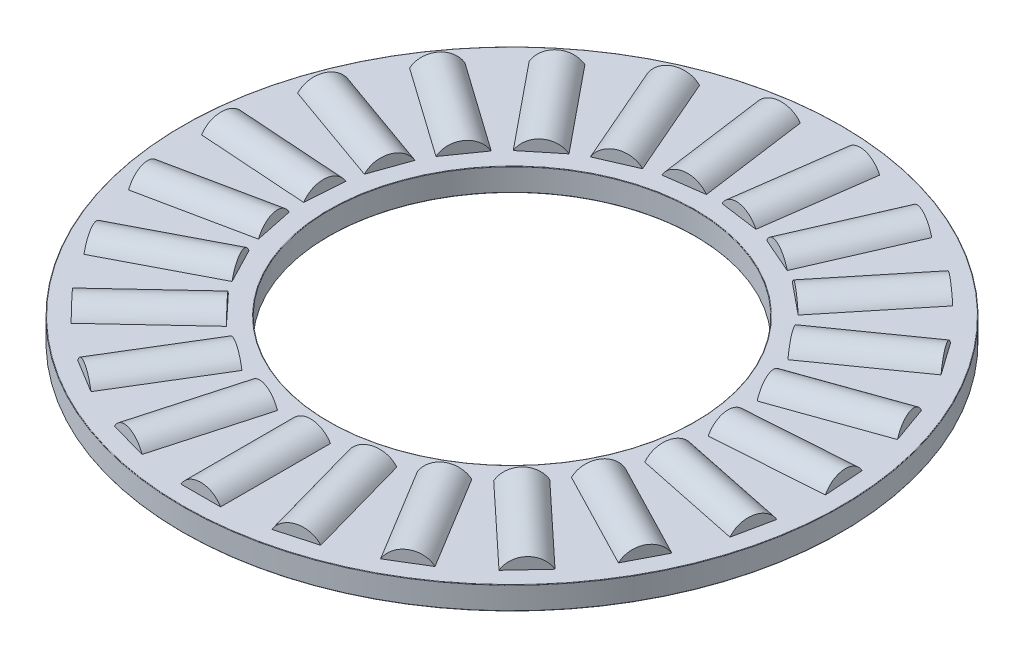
ISO-10303-21;
HEADER;
FILE_DESCRIPTION(('STEP AP214'),'2;1');
FILE_NAME('part.step','',(''),(''),'','','');
FILE_SCHEMA(('AUTOMOTIVE_DESIGN { 1 0 10303 214 1 1 1 1 }'));
ENDSEC;
DATA;
#1=APPLICATION_CONTEXT('core data for automotive mechanical design processes');
#2=APPLICATION_PROTOCOL_DEFINITION('international standard','automotive_design',2000,#1);
#3=PRODUCT_CONTEXT('',#1,'mechanical');
#4=PRODUCT('Part','Part','',(#3));
#5=PRODUCT_RELATED_PRODUCT_CATEGORY('part','',(#4));
#6=PRODUCT_DEFINITION_FORMATION('','',#4);
#7=PRODUCT_DEFINITION_CONTEXT('part definition',#1,'design');
#8=PRODUCT_DEFINITION('design','',#6,#7);
#9=PRODUCT_DEFINITION_SHAPE('','',#8);
#10=(LENGTH_UNIT() NAMED_UNIT(*) SI_UNIT(.MILLI.,.METRE.));
#11=(NAMED_UNIT(*) PLANE_ANGLE_UNIT() SI_UNIT($,.RADIAN.));
#12=(NAMED_UNIT(*) SI_UNIT($,.STERADIAN.) SOLID_ANGLE_UNIT());
#13=UNCERTAINTY_MEASURE_WITH_UNIT(LENGTH_MEASURE(1.E-05),#10,'distance_accuracy_value','');
#14=(GEOMETRIC_REPRESENTATION_CONTEXT(3) GLOBAL_UNCERTAINTY_ASSIGNED_CONTEXT((#13)) GLOBAL_UNIT_ASSIGNED_CONTEXT((#10,
#11,#12)) REPRESENTATION_CONTEXT('',''));
#15=CARTESIAN_POINT('',(0.,0.,0.));
#16=DIRECTION('',(0.,0.,1.));
#17=DIRECTION('',(1.,0.,0.));
#18=AXIS2_PLACEMENT_3D('',#15,#16,#17);
#19=CARTESIAN_POINT('',(-3.64057018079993,0.,12.9933651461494));
#20=DIRECTION('',(0.269796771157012,0.,-0.962917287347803));
#21=DIRECTION('',(-0.962917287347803,0.,-0.269796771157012));
#22=AXIS2_PLACEMENT_3D('',#19,#20,#21);
#23=PLANE('',#22);
#24=CARTESIAN_POINT('',(-3.64057018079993,0.,12.9933651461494));
#25=DIRECTION('',(-0.269796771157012,0.,0.962917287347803));
#26=DIRECTION('',(0.962917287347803,0.,0.269796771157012));
#27=AXIS2_PLACEMENT_3D('',#24,#25,#26);
#28=CIRCLE('',#27,0.9921875);
#29=CARTESIAN_POINT('',(-2.68517568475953,0.,13.2610541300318));
#30=VERTEX_POINT('',#29);
#31=EDGE_CURVE('E13',#30,#30,#28,.T.);
#32=ORIENTED_EDGE('',*,*,#31,.T.);
#33=EDGE_LOOP('',(#32));
#34=FACE_BOUND('',#33,.T.);
#35=ADVANCED_FACE('F50',(#34),#23,.F.);
#36=CARTESIAN_POINT('',(-3.64057018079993,0.,12.9933651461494));
#37=DIRECTION('',(-0.269796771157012,0.,0.962917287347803));
#38=DIRECTION('',(0.962917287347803,0.,0.269796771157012));
#39=AXIS2_PLACEMENT_3D('',#36,#37,#38);
#40=CYLINDRICAL_SURFACE('',#39,0.9921875);
#41=ORIENTED_EDGE('',*,*,#31,.F.);
#42=EDGE_LOOP('',(#41));
#43=FACE_BOUND('',#42,.T.);
#44=CARTESIAN_POINT('',(-2.35566305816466,0.,8.4074715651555));
#45=DIRECTION('',(-0.269796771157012,0.,0.962917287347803));
#46=DIRECTION('',(0.962917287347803,0.,0.269796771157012));
#47=AXIS2_PLACEMENT_3D('',#44,#45,#46);
#48=CIRCLE('',#47,0.9921875);
#49=CARTESIAN_POINT('',(-1.40026856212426,0.,8.67516054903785));
#50=VERTEX_POINT('',#49);
#51=EDGE_CURVE('E56',#50,#50,#48,.T.);
#52=ORIENTED_EDGE('',*,*,#51,.T.);
#53=EDGE_LOOP('',(#52));
#54=FACE_BOUND('',#53,.T.);
#55=ADVANCED_FACE('F62',(#43,#54),#40,.T.);
#56=CARTESIAN_POINT('',(-2.35566305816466,0.,8.4074715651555));
#57=DIRECTION('',(-0.269796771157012,0.,0.962917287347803));
#58=DIRECTION('',(0.962917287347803,0.,0.269796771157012));
#59=AXIS2_PLACEMENT_3D('',#56,#57,#58);
#60=PLANE('',#59);
#61=ORIENTED_EDGE('',*,*,#51,.F.);
#62=EDGE_LOOP('',(#61));
#63=FACE_BOUND('',#62,.T.);
#64=ADVANCED_FACE('F64',(#63),#60,.F.);
#65=CLOSED_SHELL('',(#35,#55,#64));
#66=MANIFOLD_SOLID_BREP('B2',#65);
#67=CARTESIAN_POINT('',(-7.01113592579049,0.,11.5293218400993));
#68=DIRECTION('',(0.519583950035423,0.,-0.854419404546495));
#69=DIRECTION('',(-0.854419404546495,0.,-0.519583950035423));
#70=AXIS2_PLACEMENT_3D('',#67,#68,#69);
#71=PLANE('',#70);
#72=CARTESIAN_POINT('',(-7.01113592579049,0.,11.5293218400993));
#73=DIRECTION('',(-0.519583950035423,0.,0.854419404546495));
#74=DIRECTION('',(0.854419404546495,0.,0.519583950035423));
#75=AXIS2_PLACEMENT_3D('',#72,#73,#74);
#76=CIRCLE('',#75,0.9921875);
#77=CARTESIAN_POINT('',(-6.16339167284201,0.,12.044846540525));
#78=VERTEX_POINT('',#77);
#79=EDGE_CURVE('E49',#78,#78,#76,.T.);
#80=ORIENTED_EDGE('',*,*,#79,.T.);
#81=EDGE_LOOP('',(#80));
#82=FACE_BOUND('',#81,.T.);
#83=ADVANCED_FACE('F99',(#82),#71,.F.);
#84=CARTESIAN_POINT('',(-7.01113592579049,0.,11.5293218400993));
#85=DIRECTION('',(-0.519583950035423,0.,0.854419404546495));
#86=DIRECTION('',(0.854419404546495,0.,0.519583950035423));
#87=AXIS2_PLACEMENT_3D('',#84,#85,#86);
#88=CYLINDRICAL_SURFACE('',#87,0.9921875);
#89=ORIENTED_EDGE('',*,*,#79,.F.);
#90=EDGE_LOOP('',(#89));
#91=FACE_BOUND('',#90,.T.);
#92=CARTESIAN_POINT('',(-4.53661736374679,0.,7.46014942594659));
#93=DIRECTION('',(-0.519583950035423,0.,0.854419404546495));
#94=DIRECTION('',(0.854419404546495,0.,0.519583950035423));
#95=AXIS2_PLACEMENT_3D('',#92,#93,#94);
#96=CIRCLE('',#95,0.9921875);
#97=CARTESIAN_POINT('',(-3.68887311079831,0.,7.97567412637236));
#98=VERTEX_POINT('',#97);
#99=EDGE_CURVE('E105',#98,#98,#96,.T.);
#100=ORIENTED_EDGE('',*,*,#99,.T.);
#101=EDGE_LOOP('',(#100));
#102=FACE_BOUND('',#101,.T.);
#103=ADVANCED_FACE('F111',(#91,#102),#88,.T.);
#104=CARTESIAN_POINT('',(-4.53661736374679,0.,7.46014942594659));
#105=DIRECTION('',(-0.519583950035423,0.,0.854419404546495));
#106=DIRECTION('',(0.854419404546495,0.,0.519583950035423));
#107=AXIS2_PLACEMENT_3D('',#104,#105,#106);
#108=PLANE('',#107);
#109=ORIENTED_EDGE('',*,*,#99,.F.);
#110=EDGE_LOOP('',(#109));
#111=FACE_BOUND('',#110,.T.);
#112=ADVANCED_FACE('F113',(#111),#108,.F.);
#113=CLOSED_SHELL('',(#83,#103,#112));
#114=MANIFOLD_SOLID_BREP('B8',#113);
#115=CARTESIAN_POINT('',(-9.86171779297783,0.,9.21020147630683));
#116=DIRECTION('',(0.730835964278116,0.,-0.682553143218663));
#117=DIRECTION('',(-0.682553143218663,0.,-0.730835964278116));
#118=AXIS2_PLACEMENT_3D('',#115,#116,#117);
#119=PLANE('',#118);
#120=CARTESIAN_POINT('',(-9.86171779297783,0.,9.21020147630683));
#121=DIRECTION('',(-0.730835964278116,0.,0.682553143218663));
#122=DIRECTION('',(0.682553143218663,0.,0.730835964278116));
#123=AXIS2_PLACEMENT_3D('',#120,#121,#122);
#124=CIRCLE('',#123,0.9921875);
#125=CARTESIAN_POINT('',(-9.18449709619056,0.,9.93532778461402));
#126=VERTEX_POINT('',#125);
#127=EDGE_CURVE('E98',#126,#126,#124,.T.);
#128=ORIENTED_EDGE('',*,*,#127,.T.);
#129=EDGE_LOOP('',(#128));
#130=FACE_BOUND('',#129,.T.);
#131=ADVANCED_FACE('F148',(#130),#119,.F.);
#132=CARTESIAN_POINT('',(-9.86171779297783,0.,9.21020147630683));
#133=DIRECTION('',(-0.730835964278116,0.,0.682553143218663));
#134=DIRECTION('',(0.682553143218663,0.,0.730835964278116));
#135=AXIS2_PLACEMENT_3D('',#132,#133,#134);
#136=CYLINDRICAL_SURFACE('',#135,0.9921875);
#137=ORIENTED_EDGE('',*,*,#127,.F.);
#138=EDGE_LOOP('',(#137));
#139=FACE_BOUND('',#138,.T.);
#140=CARTESIAN_POINT('',(-6.3811115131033,0.,5.95954213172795));
#141=DIRECTION('',(-0.730835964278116,0.,0.682553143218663));
#142=DIRECTION('',(0.682553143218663,0.,0.730835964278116));
#143=AXIS2_PLACEMENT_3D('',#140,#141,#142);
#144=CIRCLE('',#143,0.9921875);
#145=CARTESIAN_POINT('',(-5.70389081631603,0.,6.68466844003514));
#146=VERTEX_POINT('',#145);
#147=EDGE_CURVE('E154',#146,#146,#144,.T.);
#148=ORIENTED_EDGE('',*,*,#147,.T.);
#149=EDGE_LOOP('',(#148));
#150=FACE_BOUND('',#149,.T.);
#151=ADVANCED_FACE('F160',(#139,#150),#136,.T.);
#152=CARTESIAN_POINT('',(-6.3811115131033,0.,5.95954213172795));
#153=DIRECTION('',(-0.730835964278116,0.,0.682553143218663));
#154=DIRECTION('',(0.682553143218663,0.,0.730835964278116));
#155=AXIS2_PLACEMENT_3D('',#152,#153,#154);
#156=PLANE('',#155);
#157=ORIENTED_EDGE('',*,*,#147,.F.);
#158=EDGE_LOOP('',(#157));
#159=FACE_BOUND('',#158,.T.);
#160=ADVANCED_FACE('F162',(#159),#156,.F.);
#161=CLOSED_SHELL('',(#131,#151,#160));
#162=MANIFOLD_SOLID_BREP('B44',#161);
#163=CARTESIAN_POINT('',(-11.980901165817,0.,6.20800260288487));
#164=DIRECTION('',(0.88788521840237,0.,-0.460065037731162));
#165=DIRECTION('',(-0.460065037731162,0.,-0.88788521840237));
#166=AXIS2_PLACEMENT_3D('',#163,#164,#165);
#167=PLANE('',#166);
#168=CARTESIAN_POINT('',(-11.980901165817,0.,6.20800260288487));
#169=DIRECTION('',(-0.88788521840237,0.,0.460065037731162));
#170=DIRECTION('',(0.460065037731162,0.,0.88788521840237));
#171=AXIS2_PLACEMENT_3D('',#168,#169,#170);
#172=CIRCLE('',#171,0.9921875);
#173=CARTESIAN_POINT('',(-11.5244303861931,0.,7.08895121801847));
#174=VERTEX_POINT('',#173);
#175=EDGE_CURVE('E147',#174,#174,#172,.T.);
#176=ORIENTED_EDGE('',*,*,#175,.T.);
#177=EDGE_LOOP('',(#176));
#178=FACE_BOUND('',#177,.T.);
#179=ADVANCED_FACE('F199',(#178),#167,.F.);
#180=CARTESIAN_POINT('',(-11.980901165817,0.,6.20800260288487));
#181=DIRECTION('',(-0.88788521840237,0.,0.460065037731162));
#182=DIRECTION('',(0.460065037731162,0.,0.88788521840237));
#183=AXIS2_PLACEMENT_3D('',#180,#181,#182);
#184=CYLINDRICAL_SURFACE('',#183,0.9921875);
#185=ORIENTED_EDGE('',*,*,#175,.F.);
#186=EDGE_LOOP('',(#185));
#187=FACE_BOUND('',#186,.T.);
#188=CARTESIAN_POINT('',(-7.7523478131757,0.,4.01694286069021));
#189=DIRECTION('',(-0.88788521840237,0.,0.460065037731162));
#190=DIRECTION('',(0.460065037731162,0.,0.88788521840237));
#191=AXIS2_PLACEMENT_3D('',#188,#189,#190);
#192=CIRCLE('',#191,0.9921875);
#193=CARTESIAN_POINT('',(-7.29587703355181,0.,4.89789147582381));
#194=VERTEX_POINT('',#193);
#195=EDGE_CURVE('E205',#194,#194,#192,.T.);
#196=ORIENTED_EDGE('',*,*,#195,.T.);
#197=EDGE_LOOP('',(#196));
#198=FACE_BOUND('',#197,.T.);
#199=ADVANCED_FACE('F211',(#187,#198),#184,.T.);
#200=CARTESIAN_POINT('',(-7.7523478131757,0.,4.01694286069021));
#201=DIRECTION('',(-0.88788521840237,0.,0.460065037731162));
#202=DIRECTION('',(0.460065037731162,0.,0.88788521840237));
#203=AXIS2_PLACEMENT_3D('',#200,#201,#202);
#204=PLANE('',#203);
#205=ORIENTED_EDGE('',*,*,#195,.F.);
#206=EDGE_LOOP('',(#205));
#207=FACE_BOUND('',#206,.T.);
#208=ADVANCED_FACE('F213',(#207),#204,.F.);
#209=CLOSED_SHELL('',(#179,#199,#208));
#210=MANIFOLD_SOLID_BREP('B93',#209);
#211=CARTESIAN_POINT('',(-13.2115159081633,0.,2.74538457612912));
#212=DIRECTION('',(0.979084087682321,0.,-0.203456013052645));
#213=DIRECTION('',(-0.203456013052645,0.,-0.979084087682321));
#214=AXIS2_PLACEMENT_3D('',#211,#212,#213);
#215=PLANE('',#214);
#216=CARTESIAN_POINT('',(-13.2115159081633,0.,2.74538457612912));
#217=DIRECTION('',(-0.979084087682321,0.,0.203456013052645));
#218=DIRECTION('',(0.203456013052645,0.,0.979084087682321));
#219=AXIS2_PLACEMENT_3D('',#216,#217,#218);
#220=CIRCLE('',#219,0.9921875);
#221=CARTESIAN_POINT('',(-13.0096493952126,0.,3.71681956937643));
#222=VERTEX_POINT('',#221);
#223=EDGE_CURVE('E198',#222,#222,#220,.T.);
#224=ORIENTED_EDGE('',*,*,#223,.T.);
#225=EDGE_LOOP('',(#224));
#226=FACE_BOUND('',#225,.T.);
#227=ADVANCED_FACE('F256',(#226),#215,.F.);
#228=CARTESIAN_POINT('',(-13.2115159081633,0.,2.74538457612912));
#229=DIRECTION('',(-0.979084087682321,0.,0.203456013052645));
#230=DIRECTION('',(0.203456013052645,0.,0.979084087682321));
#231=AXIS2_PLACEMENT_3D('',#228,#229,#230);
#232=CYLINDRICAL_SURFACE('',#231,0.9921875);
#233=ORIENTED_EDGE('',*,*,#223,.F.);
#234=EDGE_LOOP('',(#233));
#235=FACE_BOUND('',#234,.T.);
#236=CARTESIAN_POINT('',(-8.54862794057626,0.,1.7764253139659));
#237=DIRECTION('',(-0.979084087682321,0.,0.203456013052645));
#238=DIRECTION('',(0.203456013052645,0.,0.979084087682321));
#239=AXIS2_PLACEMENT_3D('',#236,#237,#238);
#240=CIRCLE('',#239,0.9921875);
#241=CARTESIAN_POINT('',(-8.34676142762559,0.,2.74786030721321));
#242=VERTEX_POINT('',#241);
#243=EDGE_CURVE('E262',#242,#242,#240,.T.);
#244=ORIENTED_EDGE('',*,*,#243,.T.);
#245=EDGE_LOOP('',(#244));
#246=FACE_BOUND('',#245,.T.);
#247=ADVANCED_FACE('F268',(#235,#246),#232,.T.);
#248=CARTESIAN_POINT('',(-8.54862794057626,0.,1.7764253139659));
#249=DIRECTION('',(-0.979084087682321,0.,0.203456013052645));
#250=DIRECTION('',(0.203456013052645,0.,0.979084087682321));
#251=AXIS2_PLACEMENT_3D('',#248,#249,#250);
#252=PLANE('',#251);
#253=ORIENTED_EDGE('',*,*,#243,.F.);
#254=EDGE_LOOP('',(#253));
#255=FACE_BOUND('',#254,.T.);
#256=ADVANCED_FACE('F270',(#255),#252,.F.);
#257=CLOSED_SHELL('',(#227,#247,#256));
#258=MANIFOLD_SOLID_BREP('B142',#257);
#259=CARTESIAN_POINT('',(-13.4622929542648,0.,-0.920846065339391));
#260=DIRECTION('',(0.99766876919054,0.,0.0682424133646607));
#261=DIRECTION('',(0.0682424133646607,0.,-0.99766876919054));
#262=AXIS2_PLACEMENT_3D('',#259,#260,#261);
#263=PLANE('',#262);
#264=CARTESIAN_POINT('',(-13.4622929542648,0.,-0.920846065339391));
#265=DIRECTION('',(-0.99766876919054,0.,-0.0682424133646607));
#266=DIRECTION('',(-0.0682424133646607,0.,0.99766876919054));
#267=AXIS2_PLACEMENT_3D('',#264,#265,#266);
#268=CIRCLE('',#267,0.9921875);
#269=CARTESIAN_POINT('',(-13.5300022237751,0.,0.069028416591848));
#270=VERTEX_POINT('',#269);
#271=EDGE_CURVE('E255',#270,#270,#268,.T.);
#272=ORIENTED_EDGE('',*,*,#271,.T.);
#273=EDGE_LOOP('',(#272));
#274=FACE_BOUND('',#273,.T.);
#275=ADVANCED_FACE('F311',(#274),#263,.F.);
#276=CARTESIAN_POINT('',(-13.4622929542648,0.,-0.920846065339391));
#277=DIRECTION('',(-0.99766876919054,0.,-0.0682424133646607));
#278=DIRECTION('',(-0.0682424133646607,0.,0.99766876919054));
#279=AXIS2_PLACEMENT_3D('',#276,#277,#278);
#280=CYLINDRICAL_SURFACE('',#279,0.9921875);
#281=ORIENTED_EDGE('',*,*,#271,.F.);
#282=EDGE_LOOP('',(#281));
#283=FACE_BOUND('',#282,.T.);
#284=CARTESIAN_POINT('',(-8.7108954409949,0.,-0.595841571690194));
#285=DIRECTION('',(-0.99766876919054,0.,-0.0682424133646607));
#286=DIRECTION('',(-0.0682424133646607,0.,0.99766876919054));
#287=AXIS2_PLACEMENT_3D('',#284,#285,#286);
#288=CIRCLE('',#287,0.9921875);
#289=CARTESIAN_POINT('',(-8.77860471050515,0.,0.394032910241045));
#290=VERTEX_POINT('',#289);
#291=EDGE_CURVE('E317',#290,#290,#288,.T.);
#292=ORIENTED_EDGE('',*,*,#291,.T.);
#293=EDGE_LOOP('',(#292));
#294=FACE_BOUND('',#293,.T.);
#295=ADVANCED_FACE('F323',(#283,#294),#280,.T.);
#296=CARTESIAN_POINT('',(-8.7108954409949,0.,-0.595841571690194));
#297=DIRECTION('',(-0.99766876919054,0.,-0.0682424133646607));
#298=DIRECTION('',(-0.0682424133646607,0.,0.99766876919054));
#299=AXIS2_PLACEMENT_3D('',#296,#297,#298);
#300=PLANE('',#299);
#301=ORIENTED_EDGE('',*,*,#291,.F.);
#302=EDGE_LOOP('',(#301));
#303=FACE_BOUND('',#302,.T.);
#304=ADVANCED_FACE('F325',(#303),#300,.F.);
#305=CLOSED_SHELL('',(#275,#295,#304));
#306=MANIFOLD_SOLID_BREP('B193',#305);
#307=CARTESIAN_POINT('',(-12.7146333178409,0.,-4.51878176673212));
#308=DIRECTION('',(0.942260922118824,0.,0.334879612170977));
#309=DIRECTION('',(0.334879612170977,0.,-0.942260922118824));
#310=AXIS2_PLACEMENT_3D('',#307,#308,#309);
#311=PLANE('',#310);
#312=CARTESIAN_POINT('',(-12.7146333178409,0.,-4.51878176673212));
#313=DIRECTION('',(-0.942260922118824,0.,-0.334879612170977));
#314=DIRECTION('',(-0.334879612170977,0.,0.942260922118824));
#315=AXIS2_PLACEMENT_3D('',#312,#313,#314);
#316=CIRCLE('',#315,0.9921875);
#317=CARTESIAN_POINT('',(-13.0468966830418,0.,-3.58388225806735));
#318=VERTEX_POINT('',#317);
#319=EDGE_CURVE('E310',#318,#318,#316,.T.);
#320=ORIENTED_EDGE('',*,*,#319,.T.);
#321=EDGE_LOOP('',(#320));
#322=FACE_BOUND('',#321,.T.);
#323=ADVANCED_FACE('F360',(#322),#311,.F.);
#324=CARTESIAN_POINT('',(-12.7146333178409,0.,-4.51878176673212));
#325=DIRECTION('',(-0.942260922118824,0.,-0.334879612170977));
#326=DIRECTION('',(-0.334879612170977,0.,0.942260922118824));
#327=AXIS2_PLACEMENT_3D('',#324,#325,#326);
#328=CYLINDRICAL_SURFACE('',#327,0.9921875);
#329=ORIENTED_EDGE('',*,*,#319,.F.);
#330=EDGE_LOOP('',(#329));
#331=FACE_BOUND('',#330,.T.);
#332=CARTESIAN_POINT('',(-8.22711567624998,0.,-2.92391761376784));
#333=DIRECTION('',(-0.942260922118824,0.,-0.334879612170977));
#334=DIRECTION('',(-0.334879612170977,0.,0.942260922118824));
#335=AXIS2_PLACEMENT_3D('',#332,#333,#334);
#336=CIRCLE('',#335,0.9921875);
#337=CARTESIAN_POINT('',(-8.55937904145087,0.,-1.98901810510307));
#338=VERTEX_POINT('',#337);
#339=EDGE_CURVE('E366',#338,#338,#336,.T.);
#340=ORIENTED_EDGE('',*,*,#339,.T.);
#341=EDGE_LOOP('',(#340));
#342=FACE_BOUND('',#341,.T.);
#343=ADVANCED_FACE('F372',(#331,#342),#328,.T.);
#344=CARTESIAN_POINT('',(-8.22711567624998,0.,-2.92391761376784));
#345=DIRECTION('',(-0.942260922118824,0.,-0.334879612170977));
#346=DIRECTION('',(-0.334879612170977,0.,0.942260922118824));
#347=AXIS2_PLACEMENT_3D('',#344,#345,#346);
#348=PLANE('',#347);
#349=ORIENTED_EDGE('',*,*,#339,.F.);
#350=EDGE_LOOP('',(#349));
#351=FACE_BOUND('',#350,.T.);
#352=ADVANCED_FACE('F374',(#351),#348,.F.);
#353=CLOSED_SHELL('',(#323,#343,#352));
#354=MANIFOLD_SOLID_BREP('B250',#353);
#355=CARTESIAN_POINT('',(-11.0239874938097,0.,-7.78158009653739));
#356=DIRECTION('',(0.816969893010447,0.,0.57668032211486));
#357=DIRECTION('',(0.57668032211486,0.,-0.816969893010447));
#358=AXIS2_PLACEMENT_3D('',#355,#356,#357);
#359=PLANE('',#358);
#360=CARTESIAN_POINT('',(-11.0239874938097,0.,-7.78158009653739));
#361=DIRECTION('',(-0.816969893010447,0.,-0.57668032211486));
#362=DIRECTION('',(-0.57668032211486,0.,0.816969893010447));
#363=AXIS2_PLACEMENT_3D('',#360,#361,#362);
#364=CIRCLE('',#363,0.9921875);
#365=CARTESIAN_POINT('',(-11.5961625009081,0.,-6.97099278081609));
#366=VERTEX_POINT('',#365);
#367=EDGE_CURVE('E359',#366,#366,#364,.T.);
#368=ORIENTED_EDGE('',*,*,#367,.T.);
#369=EDGE_LOOP('',(#368));
#370=FACE_BOUND('',#369,.T.);
#371=ADVANCED_FACE('F409',(#370),#359,.F.);
#372=CARTESIAN_POINT('',(-11.0239874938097,0.,-7.78158009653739));
#373=DIRECTION('',(-0.816969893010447,0.,-0.57668032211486));
#374=DIRECTION('',(-0.57668032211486,0.,0.816969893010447));
#375=AXIS2_PLACEMENT_3D('',#372,#373,#374);
#376=CYLINDRICAL_SURFACE('',#375,0.9921875);
#377=ORIENTED_EDGE('',*,*,#367,.F.);
#378=EDGE_LOOP('',(#377));
#379=FACE_BOUND('',#378,.T.);
#380=CARTESIAN_POINT('',(-7.13316837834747,0.,-5.03514006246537));
#381=DIRECTION('',(-0.816969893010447,0.,-0.57668032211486));
#382=DIRECTION('',(-0.57668032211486,0.,0.816969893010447));
#383=AXIS2_PLACEMENT_3D('',#380,#381,#382);
#384=CIRCLE('',#383,0.9921875);
#385=CARTESIAN_POINT('',(-7.7053433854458,0.,-4.22455274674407));
#386=VERTEX_POINT('',#385);
#387=EDGE_CURVE('E415',#386,#386,#384,.T.);
#388=ORIENTED_EDGE('',*,*,#387,.T.);
#389=EDGE_LOOP('',(#388));
#390=FACE_BOUND('',#389,.T.);
#391=ADVANCED_FACE('F421',(#379,#390),#376,.T.);
#392=CARTESIAN_POINT('',(-7.13316837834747,0.,-5.03514006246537));
#393=DIRECTION('',(-0.816969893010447,0.,-0.57668032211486));
#394=DIRECTION('',(-0.57668032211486,0.,0.816969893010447));
#395=AXIS2_PLACEMENT_3D('',#392,#393,#394);
#396=PLANE('',#395);
#397=ORIENTED_EDGE('',*,*,#387,.F.);
#398=EDGE_LOOP('',(#397));
#399=FACE_BOUND('',#398,.T.);
#400=ADVANCED_FACE('F423',(#399),#396,.F.);
#401=CLOSED_SHELL('',(#371,#391,#400));
#402=MANIFOLD_SOLID_BREP('B305',#401);
#403=CARTESIAN_POINT('',(-8.51574294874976,0.,-10.4672542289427));
#404=DIRECTION('',(0.631087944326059,0.,0.775711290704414));
#405=DIRECTION('',(0.775711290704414,0.,-0.631087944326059));
#406=AXIS2_PLACEMENT_3D('',#403,#404,#405);
#407=PLANE('',#406);
#408=CARTESIAN_POINT('',(-8.51574294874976,0.,-10.4672542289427));
#409=DIRECTION('',(-0.631087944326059,0.,-0.775711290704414));
#410=DIRECTION('',(-0.775711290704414,0.,0.631087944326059));
#411=AXIS2_PLACEMENT_3D('',#408,#409,#410);
#412=CIRCLE('',#411,0.9921875);
#413=CARTESIAN_POINT('',(-9.28539399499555,0.,-9.84109665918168));
#414=VERTEX_POINT('',#413);
#415=EDGE_CURVE('E408',#414,#414,#412,.T.);
#416=ORIENTED_EDGE('',*,*,#415,.T.);
#417=EDGE_LOOP('',(#416));
#418=FACE_BOUND('',#417,.T.);
#419=ADVANCED_FACE('F458',(#418),#407,.F.);
#420=CARTESIAN_POINT('',(-8.51574294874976,0.,-10.4672542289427));
#421=DIRECTION('',(-0.631087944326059,0.,-0.775711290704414));
#422=DIRECTION('',(-0.775711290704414,0.,0.631087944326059));
#423=AXIS2_PLACEMENT_3D('',#420,#421,#422);
#424=CYLINDRICAL_SURFACE('',#423,0.9921875);
#425=ORIENTED_EDGE('',*,*,#415,.F.);
#426=EDGE_LOOP('',(#425));
#427=FACE_BOUND('',#426,.T.);
#428=CARTESIAN_POINT('',(-5.5101866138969,0.,-6.77292920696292));
#429=DIRECTION('',(-0.631087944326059,0.,-0.775711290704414));
#430=DIRECTION('',(-0.775711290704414,0.,0.631087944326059));
#431=AXIS2_PLACEMENT_3D('',#428,#429,#430);
#432=CIRCLE('',#431,0.9921875);
#433=CARTESIAN_POINT('',(-6.27983766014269,0.,-6.14677163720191));
#434=VERTEX_POINT('',#433);
#435=EDGE_CURVE('E464',#434,#434,#432,.T.);
#436=ORIENTED_EDGE('',*,*,#435,.T.);
#437=EDGE_LOOP('',(#436));
#438=FACE_BOUND('',#437,.T.);
#439=ADVANCED_FACE('F470',(#427,#438),#424,.T.);
#440=CARTESIAN_POINT('',(-5.5101866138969,0.,-6.77292920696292));
#441=DIRECTION('',(-0.631087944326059,0.,-0.775711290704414));
#442=DIRECTION('',(-0.775711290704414,0.,0.631087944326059));
#443=AXIS2_PLACEMENT_3D('',#440,#441,#442);
#444=PLANE('',#443);
#445=ORIENTED_EDGE('',*,*,#435,.F.);
#446=EDGE_LOOP('',(#445));
#447=FACE_BOUND('',#446,.T.);
#448=ADVANCED_FACE('F472',(#447),#444,.F.);
#449=CLOSED_SHELL('',(#419,#439,#448));
#450=MANIFOLD_SOLID_BREP('B354',#449);
#451=CARTESIAN_POINT('',(-5.37592470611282,0.,-12.3766199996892));
#452=DIRECTION('',(0.398401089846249,0.,0.91721130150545));
#453=DIRECTION('',(0.91721130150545,0.,-0.398401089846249));
#454=AXIS2_PLACEMENT_3D('',#451,#452,#453);
#455=PLANE('',#454);
#456=CARTESIAN_POINT('',(-5.37592470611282,0.,-12.3766199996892));
#457=DIRECTION('',(-0.398401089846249,0.,-0.91721130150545));
#458=DIRECTION('',(-0.91721130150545,0.,0.398401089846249));
#459=AXIS2_PLACEMENT_3D('',#456,#457,#458);
#460=CIRCLE('',#459,0.9921875);
#461=CARTESIAN_POINT('',(-6.28597029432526,0.,-11.9813314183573));
#462=VERTEX_POINT('',#461);
#463=EDGE_CURVE('E457',#462,#462,#460,.T.);
#464=ORIENTED_EDGE('',*,*,#463,.T.);
#465=EDGE_LOOP('',(#464));
#466=FACE_BOUND('',#465,.T.);
#467=ADVANCED_FACE('F507',(#466),#455,.F.);
#468=CARTESIAN_POINT('',(-5.37592470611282,0.,-12.3766199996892));
#469=DIRECTION('',(-0.398401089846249,0.,-0.91721130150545));
#470=DIRECTION('',(-0.91721130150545,0.,0.398401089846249));
#471=AXIS2_PLACEMENT_3D('',#468,#469,#470);
#472=CYLINDRICAL_SURFACE('',#471,0.9921875);
#473=ORIENTED_EDGE('',*,*,#463,.F.);
#474=EDGE_LOOP('',(#473));
#475=FACE_BOUND('',#474,.T.);
#476=CARTESIAN_POINT('',(-3.47853951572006,0.,-8.00840117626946));
#477=DIRECTION('',(-0.398401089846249,0.,-0.91721130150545));
#478=DIRECTION('',(-0.91721130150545,0.,0.398401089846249));
#479=AXIS2_PLACEMENT_3D('',#476,#477,#478);
#480=CIRCLE('',#479,0.9921875);
#481=CARTESIAN_POINT('',(-4.3885851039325,0.,-7.61311259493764));
#482=VERTEX_POINT('',#481);
#483=EDGE_CURVE('E513',#482,#482,#480,.T.);
#484=ORIENTED_EDGE('',*,*,#483,.T.);
#485=EDGE_LOOP('',(#484));
#486=FACE_BOUND('',#485,.T.);
#487=ADVANCED_FACE('F519',(#475,#486),#472,.T.);
#488=CARTESIAN_POINT('',(-3.47853951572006,0.,-8.00840117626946));
#489=DIRECTION('',(-0.398401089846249,0.,-0.91721130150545));
#490=DIRECTION('',(-0.91721130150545,0.,0.398401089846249));
#491=AXIS2_PLACEMENT_3D('',#488,#489,#490);
#492=PLANE('',#491);
#493=ORIENTED_EDGE('',*,*,#483,.F.);
#494=EDGE_LOOP('',(#493));
#495=FACE_BOUND('',#494,.T.);
#496=ADVANCED_FACE('F521',(#495),#492,.F.);
#497=CLOSED_SHELL('',(#467,#487,#496));
#498=MANIFOLD_SOLID_BREP('B403',#497);
#499=CARTESIAN_POINT('',(-1.83739872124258,0.,-13.3680684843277));
#500=DIRECTION('',(0.136166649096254,0.,0.99068594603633));
#501=DIRECTION('',(0.99068594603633,0.,-0.136166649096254));
#502=AXIS2_PLACEMENT_3D('',#499,#500,#501);
#503=PLANE('',#502);
#504=CARTESIAN_POINT('',(-1.83739872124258,0.,-13.3680684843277));
#505=DIRECTION('',(-0.136166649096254,0.,-0.99068594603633));
#506=DIRECTION('',(-0.99068594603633,0.,0.136166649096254));
#507=AXIS2_PLACEMENT_3D('',#504,#505,#506);
#508=CIRCLE('',#507,0.9921875);
#509=CARTESIAN_POINT('',(-2.8203449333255,0.,-13.2329656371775));
#510=VERTEX_POINT('',#509);
#511=EDGE_CURVE('E506',#510,#510,#508,.T.);
#512=ORIENTED_EDGE('',*,*,#511,.T.);
#513=EDGE_LOOP('',(#512));
#514=FACE_BOUND('',#513,.T.);
#515=ADVANCED_FACE('F558',(#514),#503,.F.);
#516=CARTESIAN_POINT('',(-1.83739872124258,0.,-13.3680684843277));
#517=DIRECTION('',(-0.136166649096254,0.,-0.99068594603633));
#518=DIRECTION('',(-0.99068594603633,0.,0.136166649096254));
#519=AXIS2_PLACEMENT_3D('',#516,#517,#518);
#520=CYLINDRICAL_SURFACE('',#519,0.9921875);
#521=ORIENTED_EDGE('',*,*,#511,.F.);
#522=EDGE_LOOP('',(#521));
#523=FACE_BOUND('',#522,.T.);
#524=CARTESIAN_POINT('',(-1.18890505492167,0.,-8.6499266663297));
#525=DIRECTION('',(-0.136166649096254,0.,-0.99068594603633));
#526=DIRECTION('',(-0.99068594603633,0.,0.136166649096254));
#527=AXIS2_PLACEMENT_3D('',#524,#525,#526);
#528=CIRCLE('',#527,0.9921875);
#529=CARTESIAN_POINT('',(-2.17185126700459,0.,-8.51482381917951));
#530=VERTEX_POINT('',#529);
#531=EDGE_CURVE('E564',#530,#530,#528,.T.);
#532=ORIENTED_EDGE('',*,*,#531,.T.);
#533=EDGE_LOOP('',(#532));
#534=FACE_BOUND('',#533,.T.);
#535=ADVANCED_FACE('F570',(#523,#534),#520,.T.);
#536=CARTESIAN_POINT('',(-1.18890505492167,0.,-8.6499266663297));
#537=DIRECTION('',(-0.136166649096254,0.,-0.99068594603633));
#538=DIRECTION('',(-0.99068594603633,0.,0.136166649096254));
#539=AXIS2_PLACEMENT_3D('',#536,#537,#538);
#540=PLANE('',#539);
#541=ORIENTED_EDGE('',*,*,#531,.F.);
#542=EDGE_LOOP('',(#541));
#543=FACE_BOUND('',#542,.T.);
#544=ADVANCED_FACE('F572',(#543),#540,.F.);
#545=CLOSED_SHELL('',(#515,#535,#544));
#546=MANIFOLD_SOLID_BREP('B452',#545);
#547=CARTESIAN_POINT('',(1.83739872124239,0.,-13.3680684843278));
#548=DIRECTION('',(-0.13616664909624,0.,0.990685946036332));
#549=DIRECTION('',(0.990685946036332,0.,0.13616664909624));
#550=AXIS2_PLACEMENT_3D('',#547,#548,#549);
#551=PLANE('',#550);
#552=CARTESIAN_POINT('',(1.83739872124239,0.,-13.3680684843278));
#553=DIRECTION('',(0.13616664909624,0.,-0.990685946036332));
#554=DIRECTION('',(-0.990685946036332,0.,-0.13616664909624));
#555=AXIS2_PLACEMENT_3D('',#552,#553,#554);
#556=CIRCLE('',#555,0.9921875);
#557=CARTESIAN_POINT('',(0.854452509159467,0.,-13.5031713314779));
#558=VERTEX_POINT('',#557);
#559=EDGE_CURVE('E557',#558,#558,#556,.T.);
#560=ORIENTED_EDGE('',*,*,#559,.T.);
#561=EDGE_LOOP('',(#560));
#562=FACE_BOUND('',#561,.T.);
#563=ADVANCED_FACE('F613',(#562),#551,.F.);
#564=CARTESIAN_POINT('',(1.83739872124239,0.,-13.3680684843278));
#565=DIRECTION('',(0.13616664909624,0.,-0.990685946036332));
#566=DIRECTION('',(-0.990685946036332,0.,-0.13616664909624));
#567=AXIS2_PLACEMENT_3D('',#564,#565,#566);
#568=CYLINDRICAL_SURFACE('',#567,0.9921875);
#569=ORIENTED_EDGE('',*,*,#559,.F.);
#570=EDGE_LOOP('',(#569));
#571=FACE_BOUND('',#570,.T.);
#572=CARTESIAN_POINT('',(1.18890505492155,0.,-8.64992666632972));
#573=DIRECTION('',(0.13616664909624,0.,-0.990685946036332));
#574=DIRECTION('',(-0.990685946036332,0.,-0.13616664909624));
#575=AXIS2_PLACEMENT_3D('',#572,#573,#574);
#576=CIRCLE('',#575,0.9921875);
#577=CARTESIAN_POINT('',(0.205958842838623,0.,-8.78502951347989));
#578=VERTEX_POINT('',#577);
#579=EDGE_CURVE('E619',#578,#578,#576,.T.);
#580=ORIENTED_EDGE('',*,*,#579,.T.);
#581=EDGE_LOOP('',(#580));
#582=FACE_BOUND('',#581,.T.);
#583=ADVANCED_FACE('F625',(#571,#582),#568,.T.);
#584=CARTESIAN_POINT('',(1.18890505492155,0.,-8.64992666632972));
#585=DIRECTION('',(0.13616664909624,0.,-0.990685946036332));
#586=DIRECTION('',(-0.990685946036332,0.,-0.13616664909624));
#587=AXIS2_PLACEMENT_3D('',#584,#585,#586);
#588=PLANE('',#587);
#589=ORIENTED_EDGE('',*,*,#579,.F.);
#590=EDGE_LOOP('',(#589));
#591=FACE_BOUND('',#590,.T.);
#592=ADVANCED_FACE('F627',(#591),#588,.F.);
#593=CLOSED_SHELL('',(#563,#583,#592));
#594=MANIFOLD_SOLID_BREP('B501',#593);
#595=CARTESIAN_POINT('',(5.37592470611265,0.,-12.3766199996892));
#596=DIRECTION('',(-0.398401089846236,0.,0.917211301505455));
#597=DIRECTION('',(0.917211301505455,0.,0.398401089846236));
#598=AXIS2_PLACEMENT_3D('',#595,#596,#597);
#599=PLANE('',#598);
#600=CARTESIAN_POINT('',(5.37592470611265,0.,-12.3766199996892));
#601=DIRECTION('',(0.398401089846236,0.,-0.917211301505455));
#602=DIRECTION('',(-0.917211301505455,0.,-0.398401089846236));
#603=AXIS2_PLACEMENT_3D('',#600,#601,#602);
#604=CIRCLE('',#603,0.9921875);
#605=CARTESIAN_POINT('',(4.46587911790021,0.,-12.7719085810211));
#606=VERTEX_POINT('',#605);
#607=EDGE_CURVE('E612',#606,#606,#604,.T.);
#608=ORIENTED_EDGE('',*,*,#607,.T.);
#609=EDGE_LOOP('',(#608));
#610=FACE_BOUND('',#609,.T.);
#611=ADVANCED_FACE('F662',(#610),#599,.F.);
#612=CARTESIAN_POINT('',(5.37592470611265,0.,-12.3766199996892));
#613=DIRECTION('',(0.398401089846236,0.,-0.917211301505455));
#614=DIRECTION('',(-0.917211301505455,0.,-0.398401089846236));
#615=AXIS2_PLACEMENT_3D('',#612,#613,#614);
#616=CYLINDRICAL_SURFACE('',#615,0.9921875);
#617=ORIENTED_EDGE('',*,*,#607,.F.);
#618=EDGE_LOOP('',(#617));
#619=FACE_BOUND('',#618,.T.);
#620=CARTESIAN_POINT('',(3.47853951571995,0.,-8.00840117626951));
#621=DIRECTION('',(0.398401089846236,0.,-0.917211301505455));
#622=DIRECTION('',(-0.917211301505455,0.,-0.398401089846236));
#623=AXIS2_PLACEMENT_3D('',#620,#621,#622);
#624=CIRCLE('',#623,0.9921875);
#625=CARTESIAN_POINT('',(2.56849392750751,0.,-8.40368975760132));
#626=VERTEX_POINT('',#625);
#627=EDGE_CURVE('E668',#626,#626,#624,.T.);
#628=ORIENTED_EDGE('',*,*,#627,.T.);
#629=EDGE_LOOP('',(#628));
#630=FACE_BOUND('',#629,.T.);
#631=ADVANCED_FACE('F674',(#619,#630),#616,.T.);
#632=CARTESIAN_POINT('',(3.47853951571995,0.,-8.00840117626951));
#633=DIRECTION('',(0.398401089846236,0.,-0.917211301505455));
#634=DIRECTION('',(-0.917211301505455,0.,-0.398401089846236));
#635=AXIS2_PLACEMENT_3D('',#632,#633,#634);
#636=PLANE('',#635);
#637=ORIENTED_EDGE('',*,*,#627,.F.);
#638=EDGE_LOOP('',(#637));
#639=FACE_BOUND('',#638,.T.);
#640=ADVANCED_FACE('F676',(#639),#636,.F.);
#641=CLOSED_SHELL('',(#611,#631,#640));
#642=MANIFOLD_SOLID_BREP('B552',#641);
#643=CARTESIAN_POINT('',(8.51574294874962,0.,-10.4672542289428));
#644=DIRECTION('',(-0.631087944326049,0.,0.775711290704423));
#645=DIRECTION('',(0.775711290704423,0.,0.631087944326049));
#646=AXIS2_PLACEMENT_3D('',#643,#644,#645);
#647=PLANE('',#646);
#648=CARTESIAN_POINT('',(8.51574294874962,0.,-10.4672542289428));
#649=DIRECTION('',(0.631087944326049,0.,-0.775711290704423));
#650=DIRECTION('',(-0.775711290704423,0.,-0.631087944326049));
#651=AXIS2_PLACEMENT_3D('',#648,#649,#650);
#652=CIRCLE('',#651,0.9921875);
#653=CARTESIAN_POINT('',(7.74609190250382,0.,-11.0934117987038));
#654=VERTEX_POINT('',#653);
#655=EDGE_CURVE('E661',#654,#654,#652,.T.);
#656=ORIENTED_EDGE('',*,*,#655,.T.);
#657=EDGE_LOOP('',(#656));
#658=FACE_BOUND('',#657,.T.);
#659=ADVANCED_FACE('F711',(#658),#647,.F.);
#660=CARTESIAN_POINT('',(8.51574294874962,0.,-10.4672542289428));
#661=DIRECTION('',(0.631087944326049,0.,-0.775711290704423));
#662=DIRECTION('',(-0.775711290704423,0.,-0.631087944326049));
#663=AXIS2_PLACEMENT_3D('',#660,#661,#662);
#664=CYLINDRICAL_SURFACE('',#663,0.9921875);
#665=ORIENTED_EDGE('',*,*,#655,.F.);
#666=EDGE_LOOP('',(#665));
#667=FACE_BOUND('',#666,.T.);
#668=CARTESIAN_POINT('',(5.51018661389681,0.,-6.77292920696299));
#669=DIRECTION('',(0.631087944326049,0.,-0.775711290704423));
#670=DIRECTION('',(-0.775711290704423,0.,-0.631087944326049));
#671=AXIS2_PLACEMENT_3D('',#668,#669,#670);
#672=CIRCLE('',#671,0.9921875);
#673=CARTESIAN_POINT('',(4.74053556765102,0.,-7.399086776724));
#674=VERTEX_POINT('',#673);
#675=EDGE_CURVE('E717',#674,#674,#672,.T.);
#676=ORIENTED_EDGE('',*,*,#675,.T.);
#677=EDGE_LOOP('',(#676));
#678=FACE_BOUND('',#677,.T.);
#679=ADVANCED_FACE('F723',(#667,#678),#664,.T.);
#680=CARTESIAN_POINT('',(5.51018661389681,0.,-6.77292920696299));
#681=DIRECTION('',(0.631087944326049,0.,-0.775711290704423));
#682=DIRECTION('',(-0.775711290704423,0.,-0.631087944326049));
#683=AXIS2_PLACEMENT_3D('',#680,#681,#682);
#684=PLANE('',#683);
#685=ORIENTED_EDGE('',*,*,#675,.F.);
#686=EDGE_LOOP('',(#685));
#687=FACE_BOUND('',#686,.T.);
#688=ADVANCED_FACE('F725',(#687),#684,.F.);
#689=CLOSED_SHELL('',(#659,#679,#688));
#690=MANIFOLD_SOLID_BREP('B607',#689);
#691=CARTESIAN_POINT('',(11.0239874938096,0.,-7.78158009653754));
#692=DIRECTION('',(-0.816969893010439,0.,0.576680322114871));
#693=DIRECTION('',(0.576680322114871,0.,0.816969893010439));
#694=AXIS2_PLACEMENT_3D('',#691,#692,#693);
#695=PLANE('',#694);
#696=CARTESIAN_POINT('',(11.0239874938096,0.,-7.78158009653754));
#697=DIRECTION('',(0.816969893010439,0.,-0.576680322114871));
#698=DIRECTION('',(-0.576680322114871,0.,-0.816969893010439));
#699=AXIS2_PLACEMENT_3D('',#696,#697,#698);
#700=CIRCLE('',#699,0.9921875);
#701=CARTESIAN_POINT('',(10.4518124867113,0.,-8.59216741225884));
#702=VERTEX_POINT('',#701);
#703=EDGE_CURVE('E710',#702,#702,#700,.T.);
#704=ORIENTED_EDGE('',*,*,#703,.T.);
#705=EDGE_LOOP('',(#704));
#706=FACE_BOUND('',#705,.T.);
#707=ADVANCED_FACE('F760',(#706),#695,.F.);
#708=CARTESIAN_POINT('',(11.0239874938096,0.,-7.78158009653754));
#709=DIRECTION('',(0.816969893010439,0.,-0.576680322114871));
#710=DIRECTION('',(-0.576680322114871,0.,-0.816969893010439));
#711=AXIS2_PLACEMENT_3D('',#708,#709,#710);
#712=CYLINDRICAL_SURFACE('',#711,0.9921875);
#713=ORIENTED_EDGE('',*,*,#703,.F.);
#714=EDGE_LOOP('',(#713));
#715=FACE_BOUND('',#714,.T.);
#716=CARTESIAN_POINT('',(7.1331683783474,0.,-5.03514006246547));
#717=DIRECTION('',(0.816969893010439,0.,-0.576680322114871));
#718=DIRECTION('',(-0.576680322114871,0.,-0.816969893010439));
#719=AXIS2_PLACEMENT_3D('',#716,#717,#718);
#720=CIRCLE('',#719,0.9921875);
#721=CARTESIAN_POINT('',(6.56099337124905,0.,-5.84572737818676));
#722=VERTEX_POINT('',#721);
#723=EDGE_CURVE('E766',#722,#722,#720,.T.);
#724=ORIENTED_EDGE('',*,*,#723,.T.);
#725=EDGE_LOOP('',(#724));
#726=FACE_BOUND('',#725,.T.);
#727=ADVANCED_FACE('F772',(#715,#726),#712,.T.);
#728=CARTESIAN_POINT('',(7.1331683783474,0.,-5.03514006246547));
#729=DIRECTION('',(0.816969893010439,0.,-0.576680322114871));
#730=DIRECTION('',(-0.576680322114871,0.,-0.816969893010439));
#731=AXIS2_PLACEMENT_3D('',#728,#729,#730);
#732=PLANE('',#731);
#733=ORIENTED_EDGE('',*,*,#723,.F.);
#734=EDGE_LOOP('',(#733));
#735=FACE_BOUND('',#734,.T.);
#736=ADVANCED_FACE('F774',(#735),#732,.F.);
#737=CLOSED_SHELL('',(#707,#727,#736));
#738=MANIFOLD_SOLID_BREP('B656',#737);
#739=CARTESIAN_POINT('',(12.7146333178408,0.,-4.5187817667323));
#740=DIRECTION('',(-0.942260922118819,0.,0.33487961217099));
#741=DIRECTION('',(0.33487961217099,0.,0.942260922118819));
#742=AXIS2_PLACEMENT_3D('',#739,#740,#741);
#743=PLANE('',#742);
#744=CARTESIAN_POINT('',(12.7146333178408,0.,-4.5187817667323));
#745=DIRECTION('',(0.942260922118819,0.,-0.33487961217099));
#746=DIRECTION('',(-0.33487961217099,0.,-0.942260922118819));
#747=AXIS2_PLACEMENT_3D('',#744,#745,#746);
#748=CIRCLE('',#747,0.9921875);
#749=CARTESIAN_POINT('',(12.3823699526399,0.,-5.45368127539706));
#750=VERTEX_POINT('',#749);
#751=EDGE_CURVE('E759',#750,#750,#748,.T.);
#752=ORIENTED_EDGE('',*,*,#751,.T.);
#753=EDGE_LOOP('',(#752));
#754=FACE_BOUND('',#753,.T.);
#755=ADVANCED_FACE('F809',(#754),#743,.F.);
#756=CARTESIAN_POINT('',(12.7146333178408,0.,-4.5187817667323));
#757=DIRECTION('',(0.942260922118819,0.,-0.33487961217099));
#758=DIRECTION('',(-0.33487961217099,0.,-0.942260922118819));
#759=AXIS2_PLACEMENT_3D('',#756,#757,#758);
#760=CYLINDRICAL_SURFACE('',#759,0.9921875);
#761=ORIENTED_EDGE('',*,*,#751,.F.);
#762=EDGE_LOOP('',(#761));
#763=FACE_BOUND('',#762,.T.);
#764=CARTESIAN_POINT('',(8.22711567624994,0.,-2.92391761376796));
#765=DIRECTION('',(0.942260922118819,0.,-0.33487961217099));
#766=DIRECTION('',(-0.33487961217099,0.,-0.942260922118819));
#767=AXIS2_PLACEMENT_3D('',#764,#765,#766);
#768=CIRCLE('',#767,0.9921875);
#769=CARTESIAN_POINT('',(7.89485231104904,0.,-3.85881712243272));
#770=VERTEX_POINT('',#769);
#771=EDGE_CURVE('E815',#770,#770,#768,.T.);
#772=ORIENTED_EDGE('',*,*,#771,.T.);
#773=EDGE_LOOP('',(#772));
#774=FACE_BOUND('',#773,.T.);
#775=ADVANCED_FACE('F821',(#763,#774),#760,.T.);
#776=CARTESIAN_POINT('',(8.22711567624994,0.,-2.92391761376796));
#777=DIRECTION('',(0.942260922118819,0.,-0.33487961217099));
#778=DIRECTION('',(-0.33487961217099,0.,-0.942260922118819));
#779=AXIS2_PLACEMENT_3D('',#776,#777,#778);
#780=PLANE('',#779);
#781=ORIENTED_EDGE('',*,*,#771,.F.);
#782=EDGE_LOOP('',(#781));
#783=FACE_BOUND('',#782,.T.);
#784=ADVANCED_FACE('F823',(#783),#780,.F.);
#785=CLOSED_SHELL('',(#755,#775,#784));
#786=MANIFOLD_SOLID_BREP('B705',#785);
#787=CARTESIAN_POINT('',(13.4622929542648,0.,-0.920846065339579));
#788=DIRECTION('',(-0.997668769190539,0.,0.0682424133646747));
#789=DIRECTION('',(0.0682424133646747,0.,0.997668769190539));
#790=AXIS2_PLACEMENT_3D('',#787,#788,#789);
#791=PLANE('',#790);
#792=CARTESIAN_POINT('',(13.4622929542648,0.,-0.920846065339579));
#793=DIRECTION('',(0.997668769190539,0.,-0.0682424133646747));
#794=DIRECTION('',(-0.0682424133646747,0.,-0.997668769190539));
#795=AXIS2_PLACEMENT_3D('',#792,#793,#794);
#796=CIRCLE('',#795,0.9921875);
#797=CARTESIAN_POINT('',(13.3945836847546,0.,-1.91072054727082));
#798=VERTEX_POINT('',#797);
#799=EDGE_CURVE('E808',#798,#798,#796,.T.);
#800=ORIENTED_EDGE('',*,*,#799,.T.);
#801=EDGE_LOOP('',(#800));
#802=FACE_BOUND('',#801,.T.);
#803=ADVANCED_FACE('F858',(#802),#791,.F.);
#804=CARTESIAN_POINT('',(13.4622929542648,0.,-0.920846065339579));
#805=DIRECTION('',(0.997668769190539,0.,-0.0682424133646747));
#806=DIRECTION('',(-0.0682424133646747,0.,-0.997668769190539));
#807=AXIS2_PLACEMENT_3D('',#804,#805,#806);
#808=CYLINDRICAL_SURFACE('',#807,0.9921875);
#809=ORIENTED_EDGE('',*,*,#799,.F.);
#810=EDGE_LOOP('',(#809));
#811=FACE_BOUND('',#810,.T.);
#812=CARTESIAN_POINT('',(8.71089544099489,0.,-0.595841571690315));
#813=DIRECTION('',(0.997668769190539,0.,-0.0682424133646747));
#814=DIRECTION('',(-0.0682424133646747,0.,-0.997668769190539));
#815=AXIS2_PLACEMENT_3D('',#812,#813,#814);
#816=CIRCLE('',#815,0.9921875);
#817=CARTESIAN_POINT('',(8.64318617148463,0.,-1.58571605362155));
#818=VERTEX_POINT('',#817);
#819=EDGE_CURVE('E864',#818,#818,#816,.T.);
#820=ORIENTED_EDGE('',*,*,#819,.T.);
#821=EDGE_LOOP('',(#820));
#822=FACE_BOUND('',#821,.T.);
#823=ADVANCED_FACE('F870',(#811,#822),#808,.T.);
#824=CARTESIAN_POINT('',(8.71089544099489,0.,-0.595841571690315));
#825=DIRECTION('',(0.997668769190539,0.,-0.0682424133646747));
#826=DIRECTION('',(-0.0682424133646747,0.,-0.997668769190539));
#827=AXIS2_PLACEMENT_3D('',#824,#825,#826);
#828=PLANE('',#827);
#829=ORIENTED_EDGE('',*,*,#819,.F.);
#830=EDGE_LOOP('',(#829));
#831=FACE_BOUND('',#830,.T.);
#832=ADVANCED_FACE('F872',(#831),#828,.F.);
#833=CLOSED_SHELL('',(#803,#823,#832));
#834=MANIFOLD_SOLID_BREP('B754',#833);
#835=CARTESIAN_POINT('',(13.2115159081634,0.,2.74538457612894));
#836=DIRECTION('',(-0.979084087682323,0.,-0.203456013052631));
#837=DIRECTION('',(-0.203456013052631,0.,0.979084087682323));
#838=AXIS2_PLACEMENT_3D('',#835,#836,#837);
#839=PLANE('',#838);
#840=CARTESIAN_POINT('',(13.2115159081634,0.,2.74538457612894));
#841=DIRECTION('',(0.979084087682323,0.,0.203456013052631));
#842=DIRECTION('',(0.203456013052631,0.,-0.979084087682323));
#843=AXIS2_PLACEMENT_3D('',#840,#841,#842);
#844=CIRCLE('',#843,0.9921875);
#845=CARTESIAN_POINT('',(13.413382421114,0.,1.77394958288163));
#846=VERTEX_POINT('',#845);
#847=EDGE_CURVE('E857',#846,#846,#844,.T.);
#848=ORIENTED_EDGE('',*,*,#847,.T.);
#849=EDGE_LOOP('',(#848));
#850=FACE_BOUND('',#849,.T.);
#851=ADVANCED_FACE('F907',(#850),#839,.F.);
#852=CARTESIAN_POINT('',(13.2115159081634,0.,2.74538457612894));
#853=DIRECTION('',(0.979084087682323,0.,0.203456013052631));
#854=DIRECTION('',(0.203456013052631,0.,-0.979084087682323));
#855=AXIS2_PLACEMENT_3D('',#852,#853,#854);
#856=CYLINDRICAL_SURFACE('',#855,0.9921875);
#857=ORIENTED_EDGE('',*,*,#847,.F.);
#858=EDGE_LOOP('',(#857));
#859=FACE_BOUND('',#858,.T.);
#860=CARTESIAN_POINT('',(8.54862794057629,0.,1.77642531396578));
#861=DIRECTION('',(0.979084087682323,0.,0.203456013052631));
#862=DIRECTION('',(0.203456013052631,0.,-0.979084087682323));
#863=AXIS2_PLACEMENT_3D('',#860,#861,#862);
#864=CIRCLE('',#863,0.9921875);
#865=CARTESIAN_POINT('',(8.75049445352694,0.,0.804990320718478));
#866=VERTEX_POINT('',#865);
#867=EDGE_CURVE('E913',#866,#866,#864,.T.);
#868=ORIENTED_EDGE('',*,*,#867,.T.);
#869=EDGE_LOOP('',(#868));
#870=FACE_BOUND('',#869,.T.);
#871=ADVANCED_FACE('F919',(#859,#870),#856,.T.);
#872=CARTESIAN_POINT('',(8.54862794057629,0.,1.77642531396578));
#873=DIRECTION('',(0.979084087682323,0.,0.203456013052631));
#874=DIRECTION('',(0.203456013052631,0.,-0.979084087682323));
#875=AXIS2_PLACEMENT_3D('',#872,#873,#874);
#876=PLANE('',#875);
#877=ORIENTED_EDGE('',*,*,#867,.F.);
#878=EDGE_LOOP('',(#877));
#879=FACE_BOUND('',#878,.T.);
#880=ADVANCED_FACE('F921',(#879),#876,.F.);
#881=CLOSED_SHELL('',(#851,#871,#880));
#882=MANIFOLD_SOLID_BREP('B803',#881);
#883=CARTESIAN_POINT('',(11.9809011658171,0.,6.20800260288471));
#884=DIRECTION('',(-0.887885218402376,0.,-0.46006503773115));
#885=DIRECTION('',(-0.46006503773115,0.,0.887885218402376));
#886=AXIS2_PLACEMENT_3D('',#883,#884,#885);
#887=PLANE('',#886);
#888=CARTESIAN_POINT('',(11.9809011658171,0.,6.20800260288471));
#889=DIRECTION('',(0.887885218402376,0.,0.46006503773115));
#890=DIRECTION('',(0.46006503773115,0.,-0.887885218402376));
#891=AXIS2_PLACEMENT_3D('',#888,#889,#890);
#892=CIRCLE('',#891,0.9921875);
#893=CARTESIAN_POINT('',(12.4373719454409,0.,5.3270539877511));
#894=VERTEX_POINT('',#893);
#895=EDGE_CURVE('E906',#894,#894,#892,.T.);
#896=ORIENTED_EDGE('',*,*,#895,.T.);
#897=EDGE_LOOP('',(#896));
#898=FACE_BOUND('',#897,.T.);
#899=ADVANCED_FACE('F956',(#898),#887,.F.);
#900=CARTESIAN_POINT('',(11.9809011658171,0.,6.20800260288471));
#901=DIRECTION('',(0.887885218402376,0.,0.46006503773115));
#902=DIRECTION('',(0.46006503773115,0.,-0.887885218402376));
#903=AXIS2_PLACEMENT_3D('',#900,#901,#902);
#904=CYLINDRICAL_SURFACE('',#903,0.9921875);
#905=ORIENTED_EDGE('',*,*,#895,.F.);
#906=EDGE_LOOP('',(#905));
#907=FACE_BOUND('',#906,.T.);
#908=CARTESIAN_POINT('',(7.75234781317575,0.,4.0169428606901));
#909=DIRECTION('',(0.887885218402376,0.,0.46006503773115));
#910=DIRECTION('',(0.46006503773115,0.,-0.887885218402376));
#911=AXIS2_PLACEMENT_3D('',#908,#909,#910);
#912=CIRCLE('',#911,0.9921875);
#913=CARTESIAN_POINT('',(8.20881859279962,0.,3.1359942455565));
#914=VERTEX_POINT('',#913);
#915=EDGE_CURVE('E962',#914,#914,#912,.T.);
#916=ORIENTED_EDGE('',*,*,#915,.T.);
#917=EDGE_LOOP('',(#916));
#918=FACE_BOUND('',#917,.T.);
#919=ADVANCED_FACE('F968',(#907,#918),#904,.T.);
#920=CARTESIAN_POINT('',(7.75234781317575,0.,4.0169428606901));
#921=DIRECTION('',(0.887885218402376,0.,0.46006503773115));
#922=DIRECTION('',(0.46006503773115,0.,-0.887885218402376));
#923=AXIS2_PLACEMENT_3D('',#920,#921,#922);
#924=PLANE('',#923);
#925=ORIENTED_EDGE('',*,*,#915,.F.);
#926=EDGE_LOOP('',(#925));
#927=FACE_BOUND('',#926,.T.);
#928=ADVANCED_FACE('F970',(#927),#924,.F.);
#929=CLOSED_SHELL('',(#899,#919,#928));
#930=MANIFOLD_SOLID_BREP('B852',#929);
#931=CARTESIAN_POINT('',(9.86171779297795,0.,9.2102014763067));
#932=DIRECTION('',(-0.730835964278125,0.,-0.682553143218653));
#933=DIRECTION('',(-0.682553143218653,0.,0.730835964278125));
#934=AXIS2_PLACEMENT_3D('',#931,#932,#933);
#935=PLANE('',#934);
#936=CARTESIAN_POINT('',(9.86171779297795,0.,9.2102014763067));
#937=DIRECTION('',(0.730835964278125,0.,0.682553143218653));
#938=DIRECTION('',(0.682553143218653,0.,-0.730835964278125));
#939=AXIS2_PLACEMENT_3D('',#936,#937,#938);
#940=CIRCLE('',#939,0.9921875);
#941=CARTESIAN_POINT('',(10.5389384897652,0.,8.48507516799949));
#942=VERTEX_POINT('',#941);
#943=EDGE_CURVE('E955',#942,#942,#940,.T.);
#944=ORIENTED_EDGE('',*,*,#943,.T.);
#945=EDGE_LOOP('',(#944));
#946=FACE_BOUND('',#945,.T.);
#947=ADVANCED_FACE('F1005',(#946),#935,.F.);
#948=CARTESIAN_POINT('',(9.86171779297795,0.,9.2102014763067));
#949=DIRECTION('',(0.730835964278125,0.,0.682553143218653));
#950=DIRECTION('',(0.682553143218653,0.,-0.730835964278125));
#951=AXIS2_PLACEMENT_3D('',#948,#949,#950);
#952=CYLINDRICAL_SURFACE('',#951,0.9921875);
#953=ORIENTED_EDGE('',*,*,#943,.F.);
#954=EDGE_LOOP('',(#953));
#955=FACE_BOUND('',#954,.T.);
#956=CARTESIAN_POINT('',(6.38111151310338,0.,5.95954213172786));
#957=DIRECTION('',(0.730835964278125,0.,0.682553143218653));
#958=DIRECTION('',(0.682553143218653,0.,-0.730835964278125));
#959=AXIS2_PLACEMENT_3D('',#956,#957,#958);
#960=CIRCLE('',#959,0.9921875);
#961=CARTESIAN_POINT('',(7.05833220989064,0.,5.23441582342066));
#962=VERTEX_POINT('',#961);
#963=EDGE_CURVE('E1011',#962,#962,#960,.T.);
#964=ORIENTED_EDGE('',*,*,#963,.T.);
#965=EDGE_LOOP('',(#964));
#966=FACE_BOUND('',#965,.T.);
#967=ADVANCED_FACE('F1017',(#955,#966),#952,.T.);
#968=CARTESIAN_POINT('',(6.38111151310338,0.,5.95954213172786));
#969=DIRECTION('',(0.730835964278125,0.,0.682553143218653));
#970=DIRECTION('',(0.682553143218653,0.,-0.730835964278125));
#971=AXIS2_PLACEMENT_3D('',#968,#969,#970);
#972=PLANE('',#971);
#973=ORIENTED_EDGE('',*,*,#963,.F.);
#974=EDGE_LOOP('',(#973));
#975=FACE_BOUND('',#974,.T.);
#976=ADVANCED_FACE('F1019',(#975),#972,.F.);
#977=CLOSED_SHELL('',(#947,#967,#976));
#978=MANIFOLD_SOLID_BREP('B901',#977);
#979=CARTESIAN_POINT('',(7.01113592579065,0.,11.5293218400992));
#980=DIRECTION('',(-0.519583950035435,0.,-0.854419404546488));
#981=DIRECTION('',(-0.854419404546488,0.,0.519583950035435));
#982=AXIS2_PLACEMENT_3D('',#979,#980,#981);
#983=PLANE('',#982);
#984=CARTESIAN_POINT('',(7.01113592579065,0.,11.5293218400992));
#985=DIRECTION('',(0.519583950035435,0.,0.854419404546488));
#986=DIRECTION('',(0.854419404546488,0.,-0.519583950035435));
#987=AXIS2_PLACEMENT_3D('',#984,#985,#986);
#988=CIRCLE('',#987,0.9921875);
#989=CARTESIAN_POINT('',(7.85888017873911,0.,11.0137971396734));
#990=VERTEX_POINT('',#989);
#991=EDGE_CURVE('E1004',#990,#990,#988,.T.);
#992=ORIENTED_EDGE('',*,*,#991,.T.);
#993=EDGE_LOOP('',(#992));
#994=FACE_BOUND('',#993,.T.);
#995=ADVANCED_FACE('F1054',(#994),#983,.F.);
#996=CARTESIAN_POINT('',(7.01113592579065,0.,11.5293218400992));
#997=DIRECTION('',(0.519583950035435,0.,0.854419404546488));
#998=DIRECTION('',(0.854419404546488,0.,-0.519583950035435));
#999=AXIS2_PLACEMENT_3D('',#996,#997,#998);
#1000=CYLINDRICAL_SURFACE('',#999,0.9921875);
#1001=ORIENTED_EDGE('',*,*,#991,.F.);
#1002=EDGE_LOOP('',(#1001));
#1003=FACE_BOUND('',#1002,.T.);
#1004=CARTESIAN_POINT('',(4.53661736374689,0.,7.46014942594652));
#1005=DIRECTION('',(0.519583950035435,0.,0.854419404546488));
#1006=DIRECTION('',(0.854419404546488,0.,-0.519583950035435));
#1007=AXIS2_PLACEMENT_3D('',#1004,#1005,#1006);
#1008=CIRCLE('',#1007,0.9921875);
#1009=CARTESIAN_POINT('',(5.38436161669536,0.,6.94462472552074));
#1010=VERTEX_POINT('',#1009);
#1011=EDGE_CURVE('E1060',#1010,#1010,#1008,.T.);
#1012=ORIENTED_EDGE('',*,*,#1011,.T.);
#1013=EDGE_LOOP('',(#1012));
#1014=FACE_BOUND('',#1013,.T.);
#1015=ADVANCED_FACE('F1066',(#1003,#1014),#1000,.T.);
#1016=CARTESIAN_POINT('',(4.53661736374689,0.,7.46014942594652));
#1017=DIRECTION('',(0.519583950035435,0.,0.854419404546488));
#1018=DIRECTION('',(0.854419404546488,0.,-0.519583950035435));
#1019=AXIS2_PLACEMENT_3D('',#1016,#1017,#1018);
#1020=PLANE('',#1019);
#1021=ORIENTED_EDGE('',*,*,#1011,.F.);
#1022=EDGE_LOOP('',(#1021));
#1023=FACE_BOUND('',#1022,.T.);
#1024=ADVANCED_FACE('F1068',(#1023),#1020,.F.);
#1025=CLOSED_SHELL('',(#995,#1015,#1024));
#1026=MANIFOLD_SOLID_BREP('B950',#1025);
#1027=CARTESIAN_POINT('',(3.6405701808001,0.,12.9933651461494));
#1028=DIRECTION('',(-0.269796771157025,0.,-0.962917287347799));
#1029=DIRECTION('',(-0.962917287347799,0.,0.269796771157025));
#1030=AXIS2_PLACEMENT_3D('',#1027,#1028,#1029);
#1031=PLANE('',#1030);
#1032=CARTESIAN_POINT('',(3.6405701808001,0.,12.9933651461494));
#1033=DIRECTION('',(0.269796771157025,0.,0.962917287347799));
#1034=DIRECTION('',(0.962917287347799,0.,-0.269796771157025));
#1035=AXIS2_PLACEMENT_3D('',#1032,#1033,#1034);
#1036=CIRCLE('',#1035,0.9921875);
#1037=CARTESIAN_POINT('',(4.5959646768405,0.,12.725676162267));
#1038=VERTEX_POINT('',#1037);
#1039=EDGE_CURVE('E1053',#1038,#1038,#1036,.T.);
#1040=ORIENTED_EDGE('',*,*,#1039,.T.);
#1041=EDGE_LOOP('',(#1040));
#1042=FACE_BOUND('',#1041,.T.);
#1043=ADVANCED_FACE('F1103',(#1042),#1031,.F.);
#1044=CARTESIAN_POINT('',(3.6405701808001,0.,12.9933651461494));
#1045=DIRECTION('',(0.269796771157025,0.,0.962917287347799));
#1046=DIRECTION('',(0.962917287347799,0.,-0.269796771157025));
#1047=AXIS2_PLACEMENT_3D('',#1044,#1045,#1046);
#1048=CYLINDRICAL_SURFACE('',#1047,0.9921875);
#1049=ORIENTED_EDGE('',*,*,#1039,.F.);
#1050=EDGE_LOOP('',(#1049));
#1051=FACE_BOUND('',#1050,.T.);
#1052=CARTESIAN_POINT('',(2.35566305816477,0.,8.40747156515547));
#1053=DIRECTION('',(0.269796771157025,0.,0.962917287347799));
#1054=DIRECTION('',(0.962917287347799,0.,-0.269796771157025));
#1055=AXIS2_PLACEMENT_3D('',#1052,#1053,#1054);
#1056=CIRCLE('',#1055,0.9921875);
#1057=CARTESIAN_POINT('',(3.31105755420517,0.,8.13978258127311));
#1058=VERTEX_POINT('',#1057);
#1059=EDGE_CURVE('E1109',#1058,#1058,#1056,.T.);
#1060=ORIENTED_EDGE('',*,*,#1059,.T.);
#1061=EDGE_LOOP('',(#1060));
#1062=FACE_BOUND('',#1061,.T.);
#1063=ADVANCED_FACE('F1115',(#1051,#1062),#1048,.T.);
#1064=CARTESIAN_POINT('',(2.35566305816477,0.,8.40747156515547));
#1065=DIRECTION('',(0.269796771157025,0.,0.962917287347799));
#1066=DIRECTION('',(0.962917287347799,0.,-0.269796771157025));
#1067=AXIS2_PLACEMENT_3D('',#1064,#1065,#1066);
#1068=PLANE('',#1067);
#1069=ORIENTED_EDGE('',*,*,#1059,.F.);
#1070=EDGE_LOOP('',(#1069));
#1071=FACE_BOUND('',#1070,.T.);
#1072=ADVANCED_FACE('F1117',(#1071),#1068,.F.);
#1073=CLOSED_SHELL('',(#1043,#1063,#1072));
#1074=MANIFOLD_SOLID_BREP('B999',#1073);
#1075=CARTESIAN_POINT('',(0.,0.,13.49375));
#1076=DIRECTION('',(0.,0.,-1.));
#1077=DIRECTION('',(-1.,0.,0.));
#1078=AXIS2_PLACEMENT_3D('',#1075,#1076,#1077);
#1079=PLANE('',#1078);
#1080=CARTESIAN_POINT('',(0.,0.,13.49375));
#1081=DIRECTION('',(0.,0.,1.));
#1082=DIRECTION('',(1.,0.,0.));
#1083=AXIS2_PLACEMENT_3D('',#1080,#1081,#1082);
#1084=CIRCLE('',#1083,0.9921875);
#1085=CARTESIAN_POINT('',(0.9921875,0.,13.49375));
#1086=VERTEX_POINT('',#1085);
#1087=EDGE_CURVE('E1102',#1086,#1086,#1084,.T.);
#1088=ORIENTED_EDGE('',*,*,#1087,.T.);
#1089=EDGE_LOOP('',(#1088));
#1090=FACE_BOUND('',#1089,.T.);
#1091=ADVANCED_FACE('F1155',(#1090),#1079,.F.);
#1092=CARTESIAN_POINT('',(0.,0.,13.49375));
#1093=DIRECTION('',(0.,0.,1.));
#1094=DIRECTION('',(1.,0.,0.));
#1095=AXIS2_PLACEMENT_3D('',#1092,#1093,#1094);
#1096=CYLINDRICAL_SURFACE('',#1095,0.9921875);
#1097=ORIENTED_EDGE('',*,*,#1087,.F.);
#1098=EDGE_LOOP('',(#1097));
#1099=FACE_BOUND('',#1098,.T.);
#1100=CARTESIAN_POINT('',(0.,0.,8.73125));
#1101=DIRECTION('',(0.,0.,1.));
#1102=DIRECTION('',(1.,0.,0.));
#1103=AXIS2_PLACEMENT_3D('',#1100,#1101,#1102);
#1104=CIRCLE('',#1103,0.9921875);
#1105=CARTESIAN_POINT('',(0.9921875,0.,8.73125));
#1106=VERTEX_POINT('',#1105);
#1107=EDGE_CURVE('E1161',#1106,#1106,#1104,.T.);
#1108=ORIENTED_EDGE('',*,*,#1107,.T.);
#1109=EDGE_LOOP('',(#1108));
#1110=FACE_BOUND('',#1109,.T.);
#1111=ADVANCED_FACE('F1167',(#1099,#1110),#1096,.T.);
#1112=CARTESIAN_POINT('',(0.,0.,8.73125));
#1113=DIRECTION('',(0.,0.,1.));
#1114=DIRECTION('',(1.,0.,0.));
#1115=AXIS2_PLACEMENT_3D('',#1112,#1113,#1114);
#1116=PLANE('',#1115);
#1117=ORIENTED_EDGE('',*,*,#1107,.F.);
#1118=EDGE_LOOP('',(#1117));
#1119=FACE_BOUND('',#1118,.T.);
#1120=ADVANCED_FACE('F1169',(#1119),#1116,.F.);
#1121=CLOSED_SHELL('',(#1091,#1111,#1120));
#1122=MANIFOLD_SOLID_BREP('B1048',#1121);
#1123=CARTESIAN_POINT('',(0.,-0.49609375,14.2875));
#1124=DIRECTION('',(0.,1.,0.));
#1125=DIRECTION('',(0.,0.,1.));
#1126=AXIS2_PLACEMENT_3D('',#1123,#1124,#1125);
#1127=PLANE('',#1126);
#1128=CARTESIAN_POINT('',(0.,-0.496093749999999,0.));
#1129=DIRECTION('',(0.,1.,0.));
#1130=DIRECTION('',(0.,0.,1.));
#1131=AXIS2_PLACEMENT_3D('',#1128,#1129,#1130);
#1132=CIRCLE('',#1131,7.95734375);
#1133=CARTESIAN_POINT('',(0.,-0.49609375,7.95734375));
#1134=VERTEX_POINT('',#1133);
#1135=EDGE_CURVE('E2362',#1134,#1134,#1132,.T.);
#1136=ORIENTED_EDGE('',*,*,#1135,.T.);
#1137=EDGE_LOOP('',(#1136));
#1138=FACE_BOUND('',#1137,.T.);
#1139=CARTESIAN_POINT('',(0.,-0.496093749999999,0.));
#1140=DIRECTION('',(0.,1.,0.));
#1141=DIRECTION('',(0.,0.,1.));
#1142=AXIS2_PLACEMENT_3D('',#1139,#1140,#1141);
#1143=CIRCLE('',#1142,14.26765625);
#1144=CARTESIAN_POINT('',(0.,-0.49609375,14.26765625));
#1145=VERTEX_POINT('',#1144);
#1146=EDGE_CURVE('E2359',#1145,#1145,#1143,.F.);
#1147=ORIENTED_EDGE('',*,*,#1146,.T.);
#1148=EDGE_LOOP('',(#1147));
#1149=FACE_BOUND('',#1148,.T.);
#1150=DIRECTION('',(-0.519583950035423,0.,0.854419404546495));
#1151=VECTOR('',#1150,1.);
#1152=CARTESIAN_POINT('',(-7.74530398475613,-0.49609375,11.0828643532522));
#1153=LINE('',#1152,#1151);
#1154=CARTESIAN_POINT('',(-7.74530398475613,-0.49609375,11.0828643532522));
#1155=VERTEX_POINT('',#1154);
#1156=CARTESIAN_POINT('',(-5.27078542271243,-0.49609375,7.01369193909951));
#1157=VERTEX_POINT('',#1156);
#1158=EDGE_CURVE('E1823',#1155,#1157,#1153,.F.);
#1159=ORIENTED_EDGE('',*,*,#1158,.F.);
#1160=DIRECTION('',(-0.854419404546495,0.,-0.519583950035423));
#1161=VECTOR('',#1160,1.);
#1162=CARTESIAN_POINT('',(-7.01113592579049,-0.49609375,11.5293218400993));
#1163=LINE('',#1162,#1161);
#1164=CARTESIAN_POINT('',(-6.27696786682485,-0.49609375,11.9757793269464));
#1165=VERTEX_POINT('',#1164);
#1166=EDGE_CURVE('E1818',#1165,#1155,#1163,.T.);
#1167=ORIENTED_EDGE('',*,*,#1166,.F.);
#1168=DIRECTION('',(-0.519583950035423,0.,0.854419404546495));
#1169=VECTOR('',#1168,1.);
#1170=CARTESIAN_POINT('',(-6.27696786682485,-0.49609375,11.9757793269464));
#1171=LINE('',#1170,#1169);
#1172=CARTESIAN_POINT('',(-3.80244930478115,-0.49609375,7.90660691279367));
#1173=VERTEX_POINT('',#1172);
#1174=EDGE_CURVE('E1811',#1173,#1165,#1171,.T.);
#1175=ORIENTED_EDGE('',*,*,#1174,.F.);
#1176=DIRECTION('',(0.854419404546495,0.,0.519583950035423));
#1177=VECTOR('',#1176,1.);
#1178=CARTESIAN_POINT('',(-4.53661736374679,-0.49609375,7.46014942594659));
#1179=LINE('',#1178,#1177);
#1180=EDGE_CURVE('E1803',#1157,#1173,#1179,.T.);
#1181=ORIENTED_EDGE('',*,*,#1180,.F.);
#1182=EDGE_LOOP('',(#1159,#1167,#1175,#1181));
#1183=FACE_BOUND('',#1182,.T.);
#1184=DIRECTION('',(-0.88788521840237,0.,0.460065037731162));
#1185=VECTOR('',#1184,1.);
#1186=CARTESIAN_POINT('',(-12.3762164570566,-0.49609375,5.44507872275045));
#1187=LINE('',#1186,#1185);
#1188=CARTESIAN_POINT('',(-12.3762164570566,-0.49609375,5.44507872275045));
#1189=VERTEX_POINT('',#1188);
#1190=CARTESIAN_POINT('',(-8.14766310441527,-0.49609375,3.25401898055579));
#1191=VERTEX_POINT('',#1190);
#1192=EDGE_CURVE('E1873',#1189,#1191,#1187,.F.);
#1193=ORIENTED_EDGE('',*,*,#1192,.F.);
#1194=DIRECTION('',(-0.460065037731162,0.,-0.88788521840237));
#1195=VECTOR('',#1194,1.);
#1196=CARTESIAN_POINT('',(-11.980901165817,-0.49609375,6.20800260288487));
#1197=LINE('',#1196,#1195);
#1198=CARTESIAN_POINT('',(-11.5855858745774,-0.49609375,6.97092648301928));
#1199=VERTEX_POINT('',#1198);
#1200=EDGE_CURVE('E1868',#1199,#1189,#1197,.T.);
#1201=ORIENTED_EDGE('',*,*,#1200,.F.);
#1202=DIRECTION('',(-0.88788521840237,0.,0.460065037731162));
#1203=VECTOR('',#1202,1.);
#1204=CARTESIAN_POINT('',(-11.5855858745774,-0.49609375,6.97092648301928));
#1205=LINE('',#1204,#1203);
#1206=CARTESIAN_POINT('',(-7.35703252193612,-0.49609375,4.77986674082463));
#1207=VERTEX_POINT('',#1206);
#1208=EDGE_CURVE('E1861',#1207,#1199,#1205,.T.);
#1209=ORIENTED_EDGE('',*,*,#1208,.F.);
#1210=DIRECTION('',(0.460065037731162,0.,0.88788521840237));
#1211=VECTOR('',#1210,1.);
#1212=CARTESIAN_POINT('',(-7.7523478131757,-0.49609375,4.01694286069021));
#1213=LINE('',#1212,#1211);
#1214=EDGE_CURVE('E1853',#1191,#1207,#1213,.T.);
#1215=ORIENTED_EDGE('',*,*,#1214,.F.);
#1216=EDGE_LOOP('',(#1193,#1201,#1209,#1215));
#1217=FACE_BOUND('',#1216,.T.);
#1218=DIRECTION('',(-0.99766876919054,0.,-0.0682424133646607));
#1219=VECTOR('',#1218,1.);
#1220=CARTESIAN_POINT('',(-13.4036550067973,-0.49609375,-1.7781025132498));
#1221=LINE('',#1220,#1219);
#1222=CARTESIAN_POINT('',(-13.4036550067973,-0.49609375,-1.7781025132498));
#1223=VERTEX_POINT('',#1222);
#1224=CARTESIAN_POINT('',(-8.65225749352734,-0.496093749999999,-1.45309801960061));
#1225=VERTEX_POINT('',#1224);
#1226=EDGE_CURVE('E1923',#1223,#1225,#1221,.F.);
#1227=ORIENTED_EDGE('',*,*,#1226,.F.);
#1228=DIRECTION('',(0.0682424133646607,0.,-0.99766876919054));
#1229=VECTOR('',#1228,1.);
#1230=CARTESIAN_POINT('',(-13.4622929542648,-0.49609375,-0.920846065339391));
#1231=LINE('',#1230,#1229);
#1232=CARTESIAN_POINT('',(-13.5209309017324,-0.49609375,-0.063589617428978));
#1233=VERTEX_POINT('',#1232);
#1234=EDGE_CURVE('E1918',#1233,#1223,#1231,.T.);
#1235=ORIENTED_EDGE('',*,*,#1234,.F.);
#1236=DIRECTION('',(-0.99766876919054,0.,-0.0682424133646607));
#1237=VECTOR('',#1236,1.);
#1238=CARTESIAN_POINT('',(-13.5209309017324,-0.49609375,-0.0635896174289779));
#1239=LINE('',#1238,#1237);
#1240=CARTESIAN_POINT('',(-8.76953338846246,-0.49609375,0.261414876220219));
#1241=VERTEX_POINT('',#1240);
#1242=EDGE_CURVE('E1911',#1241,#1233,#1239,.T.);
#1243=ORIENTED_EDGE('',*,*,#1242,.F.);
#1244=DIRECTION('',(-0.0682424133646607,0.,0.99766876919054));
#1245=VECTOR('',#1244,1.);
#1246=CARTESIAN_POINT('',(-8.7108954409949,-0.49609375,-0.595841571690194));
#1247=LINE('',#1246,#1245);
#1248=EDGE_CURVE('E1903',#1225,#1241,#1247,.T.);
#1249=ORIENTED_EDGE('',*,*,#1248,.F.);
#1250=EDGE_LOOP('',(#1227,#1235,#1243,#1249));
#1251=FACE_BOUND('',#1250,.T.);
#1252=DIRECTION('',(-0.816969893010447,0.,-0.57668032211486));
#1253=VECTOR('',#1252,1.);
#1254=CARTESIAN_POINT('',(-10.528469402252,-0.49609375,-8.48356930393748));
#1255=LINE('',#1254,#1253);
#1256=CARTESIAN_POINT('',(-10.528469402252,-0.49609375,-8.48356930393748));
#1257=VERTEX_POINT('',#1256);
#1258=CARTESIAN_POINT('',(-6.63765028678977,-0.496093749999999,-5.73712926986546));
#1259=VERTEX_POINT('',#1258);
#1260=EDGE_CURVE('E1973',#1257,#1259,#1255,.F.);
#1261=ORIENTED_EDGE('',*,*,#1260,.F.);
#1262=DIRECTION('',(0.57668032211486,0.,-0.816969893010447));
#1263=VECTOR('',#1262,1.);
#1264=CARTESIAN_POINT('',(-11.0239874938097,-0.49609375,-7.78158009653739));
#1265=LINE('',#1264,#1263);
#1266=CARTESIAN_POINT('',(-11.5195055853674,-0.49609375,-7.07959088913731));
#1267=VERTEX_POINT('',#1266);
#1268=EDGE_CURVE('E1968',#1267,#1257,#1265,.T.);
#1269=ORIENTED_EDGE('',*,*,#1268,.F.);
#1270=DIRECTION('',(-0.816969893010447,0.,-0.57668032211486));
#1271=VECTOR('',#1270,1.);
#1272=CARTESIAN_POINT('',(-11.5195055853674,-0.49609375,-7.07959088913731));
#1273=LINE('',#1272,#1271);
#1274=CARTESIAN_POINT('',(-7.62868646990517,-0.49609375,-4.33315085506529));
#1275=VERTEX_POINT('',#1274);
#1276=EDGE_CURVE('E1961',#1275,#1267,#1273,.T.);
#1277=ORIENTED_EDGE('',*,*,#1276,.F.);
#1278=DIRECTION('',(-0.57668032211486,0.,0.816969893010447));
#1279=VECTOR('',#1278,1.);
#1280=CARTESIAN_POINT('',(-7.13316837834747,-0.49609375,-5.03514006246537));
#1281=LINE('',#1280,#1279);
#1282=EDGE_CURVE('E1953',#1259,#1275,#1281,.T.);
#1283=ORIENTED_EDGE('',*,*,#1282,.F.);
#1284=EDGE_LOOP('',(#1261,#1269,#1277,#1283));
#1285=FACE_BOUND('',#1284,.T.);
#1286=DIRECTION('',(-0.398401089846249,0.,-0.91721130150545));
#1287=VECTOR('',#1286,1.);
#1288=CARTESIAN_POINT('',(-4.58780210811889,-0.49609375,-12.7189499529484));
#1289=LINE('',#1288,#1287);
#1290=CARTESIAN_POINT('',(-4.58780210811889,-0.49609375,-12.7189499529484));
#1291=VERTEX_POINT('',#1290);
#1292=CARTESIAN_POINT('',(-2.69041691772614,-0.496093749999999,-8.35073112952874));
#1293=VERTEX_POINT('',#1292);
#1294=EDGE_CURVE('E2023',#1291,#1293,#1289,.F.);
#1295=ORIENTED_EDGE('',*,*,#1294,.F.);
#1296=DIRECTION('',(0.91721130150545,0.,-0.398401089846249));
#1297=VECTOR('',#1296,1.);
#1298=CARTESIAN_POINT('',(-5.37592470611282,-0.49609375,-12.3766199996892));
#1299=LINE('',#1298,#1297);
#1300=CARTESIAN_POINT('',(-6.16404730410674,-0.49609375,-12.0342900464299));
#1301=VERTEX_POINT('',#1300);
#1302=EDGE_CURVE('E2018',#1301,#1291,#1299,.T.);
#1303=ORIENTED_EDGE('',*,*,#1302,.F.);
#1304=DIRECTION('',(-0.398401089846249,0.,-0.91721130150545));
#1305=VECTOR('',#1304,1.);
#1306=CARTESIAN_POINT('',(-6.16404730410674,-0.49609375,-12.0342900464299));
#1307=LINE('',#1306,#1305);
#1308=CARTESIAN_POINT('',(-4.26666211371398,-0.49609375,-7.66607122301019));
#1309=VERTEX_POINT('',#1308);
#1310=EDGE_CURVE('E2011',#1309,#1301,#1307,.T.);
#1311=ORIENTED_EDGE('',*,*,#1310,.F.);
#1312=DIRECTION('',(-0.91721130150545,0.,0.398401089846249));
#1313=VECTOR('',#1312,1.);
#1314=CARTESIAN_POINT('',(-3.47853951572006,-0.49609375,-8.00840117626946));
#1315=LINE('',#1314,#1313);
#1316=EDGE_CURVE('E2003',#1293,#1309,#1315,.T.);
#1317=ORIENTED_EDGE('',*,*,#1316,.F.);
#1318=EDGE_LOOP('',(#1295,#1303,#1311,#1317));
#1319=FACE_BOUND('',#1318,.T.);
#1320=DIRECTION('',(0.13616664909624,0.,-0.990685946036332));
#1321=VECTOR('',#1320,1.);
#1322=CARTESIAN_POINT('',(2.68865511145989,-0.49609375,-13.2510659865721));
#1323=LINE('',#1322,#1321);
#1324=CARTESIAN_POINT('',(2.68865511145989,-0.49609375,-13.2510659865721));
#1325=VERTEX_POINT('',#1324);
#1326=CARTESIAN_POINT('',(2.04016144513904,-0.496093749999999,-8.53292416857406));
#1327=VERTEX_POINT('',#1326);
#1328=EDGE_CURVE('E2073',#1325,#1327,#1323,.F.);
#1329=ORIENTED_EDGE('',*,*,#1328,.F.);
#1330=DIRECTION('',(0.990685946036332,0.,0.13616664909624));
#1331=VECTOR('',#1330,1.);
#1332=CARTESIAN_POINT('',(1.83739872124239,-0.49609375,-13.3680684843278));
#1333=LINE('',#1332,#1331);
#1334=CARTESIAN_POINT('',(0.986142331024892,-0.49609375,-13.4850709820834));
#1335=VERTEX_POINT('',#1334);
#1336=EDGE_CURVE('E2068',#1335,#1325,#1333,.T.);
#1337=ORIENTED_EDGE('',*,*,#1336,.F.);
#1338=DIRECTION('',(0.13616664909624,0.,-0.990685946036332));
#1339=VECTOR('',#1338,1.);
#1340=CARTESIAN_POINT('',(0.986142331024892,-0.49609375,-13.4850709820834));
#1341=LINE('',#1340,#1339);
#1342=CARTESIAN_POINT('',(0.337648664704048,-0.49609375,-8.76692916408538));
#1343=VERTEX_POINT('',#1342);
#1344=EDGE_CURVE('E2061',#1343,#1335,#1341,.T.);
#1345=ORIENTED_EDGE('',*,*,#1344,.F.);
#1346=DIRECTION('',(-0.990685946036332,0.,-0.13616664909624));
#1347=VECTOR('',#1346,1.);
#1348=CARTESIAN_POINT('',(1.18890505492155,-0.49609375,-8.64992666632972));
#1349=LINE('',#1348,#1347);
#1350=EDGE_CURVE('E2053',#1327,#1343,#1349,.T.);
#1351=ORIENTED_EDGE('',*,*,#1350,.F.);
#1352=EDGE_LOOP('',(#1329,#1337,#1345,#1351));
#1353=FACE_BOUND('',#1352,.T.);
#1354=DIRECTION('',(0.631087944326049,0.,-0.775711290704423));
#1355=VECTOR('',#1354,1.);
#1356=CARTESIAN_POINT('',(9.18228030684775,-0.49609375,-9.92498586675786));
#1357=LINE('',#1356,#1355);
#1358=CARTESIAN_POINT('',(9.18228030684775,-0.49609375,-9.92498586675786));
#1359=VERTEX_POINT('',#1358);
#1360=CARTESIAN_POINT('',(6.17672397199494,-0.496093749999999,-6.23066084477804));
#1361=VERTEX_POINT('',#1360);
#1362=EDGE_CURVE('E2123',#1359,#1361,#1357,.F.);
#1363=ORIENTED_EDGE('',*,*,#1362,.F.);
#1364=DIRECTION('',(0.775711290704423,0.,0.631087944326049));
#1365=VECTOR('',#1364,1.);
#1366=CARTESIAN_POINT('',(8.51574294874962,-0.49609375,-10.4672542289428));
#1367=LINE('',#1366,#1365);
#1368=CARTESIAN_POINT('',(7.84920559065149,-0.49609375,-11.0095225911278));
#1369=VERTEX_POINT('',#1368);
#1370=EDGE_CURVE('E2118',#1369,#1359,#1367,.T.);
#1371=ORIENTED_EDGE('',*,*,#1370,.F.);
#1372=DIRECTION('',(0.631087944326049,0.,-0.775711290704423));
#1373=VECTOR('',#1372,1.);
#1374=CARTESIAN_POINT('',(7.84920559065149,-0.49609375,-11.0095225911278));
#1375=LINE('',#1374,#1373);
#1376=CARTESIAN_POINT('',(4.84364925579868,-0.49609375,-7.31519756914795));
#1377=VERTEX_POINT('',#1376);
#1378=EDGE_CURVE('E2111',#1377,#1369,#1375,.T.);
#1379=ORIENTED_EDGE('',*,*,#1378,.F.);
#1380=DIRECTION('',(-0.775711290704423,0.,-0.631087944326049));
#1381=VECTOR('',#1380,1.);
#1382=CARTESIAN_POINT('',(5.51018661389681,-0.49609375,-6.77292920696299));
#1383=LINE('',#1382,#1381);
#1384=EDGE_CURVE('E2103',#1361,#1377,#1383,.T.);
#1385=ORIENTED_EDGE('',*,*,#1384,.F.);
#1386=EDGE_LOOP('',(#1363,#1371,#1379,#1385));
#1387=FACE_BOUND('',#1386,.T.);
#1388=DIRECTION('',(0.942260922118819,0.,-0.33487961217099));
#1389=VECTOR('',#1388,1.);
#1390=CARTESIAN_POINT('',(13.0023818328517,-0.49609375,-3.70913504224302));
#1391=LINE('',#1390,#1389);
#1392=CARTESIAN_POINT('',(13.0023818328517,-0.49609375,-3.70913504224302));
#1393=VERTEX_POINT('',#1392);
#1394=CARTESIAN_POINT('',(8.51486419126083,-0.496093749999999,-2.11427088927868));
#1395=VERTEX_POINT('',#1394);
#1396=EDGE_CURVE('E2173',#1393,#1395,#1391,.F.);
#1397=ORIENTED_EDGE('',*,*,#1396,.F.);
#1398=DIRECTION('',(0.33487961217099,0.,0.942260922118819));
#1399=VECTOR('',#1398,1.);
#1400=CARTESIAN_POINT('',(12.7146333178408,-0.49609375,-4.5187817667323));
#1401=LINE('',#1400,#1399);
#1402=CARTESIAN_POINT('',(12.4268848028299,-0.49609375,-5.32842849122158));
#1403=VERTEX_POINT('',#1402);
#1404=EDGE_CURVE('E2168',#1403,#1393,#1401,.T.);
#1405=ORIENTED_EDGE('',*,*,#1404,.F.);
#1406=DIRECTION('',(0.942260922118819,0.,-0.33487961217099));
#1407=VECTOR('',#1406,1.);
#1408=CARTESIAN_POINT('',(12.4268848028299,-0.49609375,-5.32842849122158));
#1409=LINE('',#1408,#1407);
#1410=CARTESIAN_POINT('',(7.93936716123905,-0.49609375,-3.73356433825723));
#1411=VERTEX_POINT('',#1410);
#1412=EDGE_CURVE('E2161',#1411,#1403,#1409,.T.);
#1413=ORIENTED_EDGE('',*,*,#1412,.F.);
#1414=DIRECTION('',(-0.33487961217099,0.,-0.942260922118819));
#1415=VECTOR('',#1414,1.);
#1416=CARTESIAN_POINT('',(8.22711567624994,-0.49609375,-2.92391761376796));
#1417=LINE('',#1416,#1415);
#1418=EDGE_CURVE('E2153',#1395,#1411,#1417,.T.);
#1419=ORIENTED_EDGE('',*,*,#1418,.F.);
#1420=EDGE_LOOP('',(#1397,#1405,#1413,#1419));
#1421=FACE_BOUND('',#1420,.T.);
#1422=DIRECTION('',(0.979084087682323,0.,0.203456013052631));
#1423=VECTOR('',#1422,1.);
#1424=CARTESIAN_POINT('',(13.0366943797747,-0.49609375,3.58667195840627));
#1425=LINE('',#1424,#1423);
#1426=CARTESIAN_POINT('',(13.0366943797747,-0.49609375,3.58667195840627));
#1427=VERTEX_POINT('',#1426);
#1428=CARTESIAN_POINT('',(8.37380641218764,-0.49609375,2.61771269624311));
#1429=VERTEX_POINT('',#1428);
#1430=EDGE_CURVE('E2223',#1427,#1429,#1425,.F.);
#1431=ORIENTED_EDGE('',*,*,#1430,.F.);
#1432=DIRECTION('',(-0.203456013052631,0.,0.979084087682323));
#1433=VECTOR('',#1432,1.);
#1434=CARTESIAN_POINT('',(13.2115159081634,-0.49609375,2.74538457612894));
#1435=LINE('',#1434,#1433);
#1436=CARTESIAN_POINT('',(13.386337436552,-0.49609375,1.90409719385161));
#1437=VERTEX_POINT('',#1436);
#1438=EDGE_CURVE('E2218',#1437,#1427,#1435,.T.);
#1439=ORIENTED_EDGE('',*,*,#1438,.F.);
#1440=DIRECTION('',(0.979084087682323,0.,0.203456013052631));
#1441=VECTOR('',#1440,1.);
#1442=CARTESIAN_POINT('',(13.386337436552,-0.49609375,1.90409719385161));
#1443=LINE('',#1442,#1441);
#1444=CARTESIAN_POINT('',(8.72344946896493,-0.49609375,0.935137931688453));
#1445=VERTEX_POINT('',#1444);
#1446=EDGE_CURVE('E2211',#1445,#1437,#1443,.T.);
#1447=ORIENTED_EDGE('',*,*,#1446,.F.);
#1448=DIRECTION('',(0.203456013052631,0.,-0.979084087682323));
#1449=VECTOR('',#1448,1.);
#1450=CARTESIAN_POINT('',(8.54862794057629,-0.49609375,1.77642531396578));
#1451=LINE('',#1450,#1449);
#1452=EDGE_CURVE('E2203',#1429,#1445,#1451,.T.);
#1453=ORIENTED_EDGE('',*,*,#1452,.F.);
#1454=EDGE_LOOP('',(#1431,#1439,#1447,#1453));
#1455=FACE_BOUND('',#1454,.T.);
#1456=DIRECTION('',(0.730835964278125,0.,0.682553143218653));
#1457=VECTOR('',#1456,1.);
#1458=CARTESIAN_POINT('',(9.27522746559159,-0.49609375,9.83817928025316));
#1459=LINE('',#1458,#1457);
#1460=CARTESIAN_POINT('',(9.27522746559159,-0.49609375,9.83817928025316));
#1461=VERTEX_POINT('',#1460);
#1462=CARTESIAN_POINT('',(5.79462118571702,-0.49609375,6.58751993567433));
#1463=VERTEX_POINT('',#1462);
#1464=EDGE_CURVE('E2273',#1461,#1463,#1459,.F.);
#1465=ORIENTED_EDGE('',*,*,#1464,.F.);
#1466=DIRECTION('',(-0.682553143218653,0.,0.730835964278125));
#1467=VECTOR('',#1466,1.);
#1468=CARTESIAN_POINT('',(9.86171779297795,-0.49609375,9.2102014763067));
#1469=LINE('',#1468,#1467);
#1470=CARTESIAN_POINT('',(10.4482081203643,-0.49609375,8.58222367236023));
#1471=VERTEX_POINT('',#1470);
#1472=EDGE_CURVE('E2268',#1471,#1461,#1469,.T.);
#1473=ORIENTED_EDGE('',*,*,#1472,.F.);
#1474=DIRECTION('',(0.730835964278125,0.,0.682553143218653));
#1475=VECTOR('',#1474,1.);
#1476=CARTESIAN_POINT('',(10.4482081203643,-0.49609375,8.58222367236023));
#1477=LINE('',#1476,#1475);
#1478=CARTESIAN_POINT('',(6.96760184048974,-0.49609375,5.3315643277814));
#1479=VERTEX_POINT('',#1478);
#1480=EDGE_CURVE('E2261',#1479,#1471,#1477,.T.);
#1481=ORIENTED_EDGE('',*,*,#1480,.F.);
#1482=DIRECTION('',(0.682553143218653,0.,-0.730835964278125));
#1483=VECTOR('',#1482,1.);
#1484=CARTESIAN_POINT('',(6.38111151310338,-0.49609375,5.95954213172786));
#1485=LINE('',#1484,#1483);
#1486=EDGE_CURVE('E2253',#1463,#1479,#1485,.T.);
#1487=ORIENTED_EDGE('',*,*,#1486,.F.);
#1488=EDGE_LOOP('',(#1465,#1473,#1481,#1487));
#1489=FACE_BOUND('',#1488,.T.);
#1490=DIRECTION('',(0.269796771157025,0.,0.962917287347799));
#1491=VECTOR('',#1490,1.);
#1492=CARTESIAN_POINT('',(2.81317427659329,-0.49609375,13.2251906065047));
#1493=LINE('',#1492,#1491);
#1494=CARTESIAN_POINT('',(2.81317427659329,-0.49609375,13.2251906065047));
#1495=VERTEX_POINT('',#1494);
#1496=CARTESIAN_POINT('',(1.52826715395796,-0.49609375,8.63929702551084));
#1497=VERTEX_POINT('',#1496);
#1498=EDGE_CURVE('E2323',#1495,#1497,#1493,.F.);
#1499=ORIENTED_EDGE('',*,*,#1498,.F.);
#1500=DIRECTION('',(-0.962917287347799,0.,0.269796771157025));
#1501=VECTOR('',#1500,1.);
#1502=CARTESIAN_POINT('',(3.6405701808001,-0.49609375,12.9933651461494));
#1503=LINE('',#1502,#1501);
#1504=CARTESIAN_POINT('',(4.46796608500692,-0.49609375,12.761539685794));
#1505=VERTEX_POINT('',#1504);
#1506=EDGE_CURVE('E2318',#1505,#1495,#1503,.T.);
#1507=ORIENTED_EDGE('',*,*,#1506,.F.);
#1508=DIRECTION('',(0.269796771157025,0.,0.962917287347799));
#1509=VECTOR('',#1508,1.);
#1510=CARTESIAN_POINT('',(4.46796608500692,-0.49609375,12.761539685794));
#1511=LINE('',#1510,#1509);
#1512=CARTESIAN_POINT('',(3.18305896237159,-0.49609375,8.1756461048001));
#1513=VERTEX_POINT('',#1512);
#1514=EDGE_CURVE('E2311',#1513,#1505,#1511,.T.);
#1515=ORIENTED_EDGE('',*,*,#1514,.F.);
#1516=DIRECTION('',(0.962917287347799,0.,-0.269796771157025));
#1517=VECTOR('',#1516,1.);
#1518=CARTESIAN_POINT('',(2.35566305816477,-0.49609375,8.40747156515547));
#1519=LINE('',#1518,#1517);
#1520=EDGE_CURVE('E2303',#1497,#1513,#1519,.T.);
#1521=ORIENTED_EDGE('',*,*,#1520,.F.);
#1522=EDGE_LOOP('',(#1499,#1507,#1515,#1521));
#1523=FACE_BOUND('',#1522,.T.);
#1524=DIRECTION('',(-1.,0.,0.));
#1525=VECTOR('',#1524,1.);
#1526=CARTESIAN_POINT('',(0.,-0.49609375,13.49375));
#1527=LINE('',#1526,#1525);
#1528=CARTESIAN_POINT('',(0.859259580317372,-0.49609375,13.49375));
#1529=VERTEX_POINT('',#1528);
#1530=CARTESIAN_POINT('',(-0.859259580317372,-0.49609375,13.49375));
#1531=VERTEX_POINT('',#1530);
#1532=EDGE_CURVE('E2342',#1529,#1531,#1527,.T.);
#1533=ORIENTED_EDGE('',*,*,#1532,.F.);
#1534=DIRECTION('',(0.,0.,1.));
#1535=VECTOR('',#1534,1.);
#1536=CARTESIAN_POINT('',(0.859259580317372,-0.49609375,13.49375));
#1537=LINE('',#1536,#1535);
#1538=CARTESIAN_POINT('',(0.859259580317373,-0.49609375,8.73125));
#1539=VERTEX_POINT('',#1538);
#1540=EDGE_CURVE('E2337',#1539,#1529,#1537,.T.);
#1541=ORIENTED_EDGE('',*,*,#1540,.F.);
#1542=DIRECTION('',(1.,0.,0.));
#1543=VECTOR('',#1542,1.);
#1544=CARTESIAN_POINT('',(0.,-0.49609375,8.73125));
#1545=LINE('',#1544,#1543);
#1546=CARTESIAN_POINT('',(-0.859259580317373,-0.49609375,8.73125));
#1547=VERTEX_POINT('',#1546);
#1548=EDGE_CURVE('E2335',#1547,#1539,#1545,.T.);
#1549=ORIENTED_EDGE('',*,*,#1548,.F.);
#1550=DIRECTION('',(0.,0.,1.));
#1551=VECTOR('',#1550,1.);
#1552=CARTESIAN_POINT('',(-0.859259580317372,-0.49609375,13.49375));
#1553=LINE('',#1552,#1551);
#1554=EDGE_CURVE('E2339',#1531,#1547,#1553,.F.);
#1555=ORIENTED_EDGE('',*,*,#1554,.F.);
#1556=EDGE_LOOP('',(#1533,#1541,#1549,#1555));
#1557=FACE_BOUND('',#1556,.T.);
#1558=DIRECTION('',(0.519583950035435,0.,0.854419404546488));
#1559=VECTOR('',#1558,1.);
#1560=CARTESIAN_POINT('',(6.27696786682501,-0.49609375,11.9757793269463));
#1561=LINE('',#1560,#1559);
#1562=CARTESIAN_POINT('',(6.27696786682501,-0.49609375,11.9757793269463));
#1563=VERTEX_POINT('',#1562);
#1564=CARTESIAN_POINT('',(3.80244930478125,-0.49609375,7.90660691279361));
#1565=VERTEX_POINT('',#1564);
#1566=EDGE_CURVE('E2298',#1563,#1565,#1561,.F.);
#1567=ORIENTED_EDGE('',*,*,#1566,.F.);
#1568=DIRECTION('',(-0.854419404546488,0.,0.519583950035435));
#1569=VECTOR('',#1568,1.);
#1570=CARTESIAN_POINT('',(7.01113592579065,-0.49609375,11.5293218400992));
#1571=LINE('',#1570,#1569);
#1572=CARTESIAN_POINT('',(7.74530398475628,-0.49609375,11.0828643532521));
#1573=VERTEX_POINT('',#1572);
#1574=EDGE_CURVE('E2293',#1573,#1563,#1571,.T.);
#1575=ORIENTED_EDGE('',*,*,#1574,.F.);
#1576=DIRECTION('',(0.519583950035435,0.,0.854419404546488));
#1577=VECTOR('',#1576,1.);
#1578=CARTESIAN_POINT('',(7.74530398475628,-0.49609375,11.0828643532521));
#1579=LINE('',#1578,#1577);
#1580=CARTESIAN_POINT('',(5.27078542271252,-0.49609375,7.01369193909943));
#1581=VERTEX_POINT('',#1580);
#1582=EDGE_CURVE('E2286',#1581,#1573,#1579,.T.);
#1583=ORIENTED_EDGE('',*,*,#1582,.F.);
#1584=DIRECTION('',(0.854419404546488,0.,-0.519583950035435));
#1585=VECTOR('',#1584,1.);
#1586=CARTESIAN_POINT('',(4.53661736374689,-0.49609375,7.46014942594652));
#1587=LINE('',#1586,#1585);
#1588=EDGE_CURVE('E2278',#1565,#1581,#1587,.T.);
#1589=ORIENTED_EDGE('',*,*,#1588,.F.);
#1590=EDGE_LOOP('',(#1567,#1575,#1583,#1589));
#1591=FACE_BOUND('',#1590,.T.);
#1592=DIRECTION('',(0.887885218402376,0.,0.46006503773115));
#1593=VECTOR('',#1592,1.);
#1594=CARTESIAN_POINT('',(11.5855858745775,-0.49609375,6.97092648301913));
#1595=LINE('',#1594,#1593);
#1596=CARTESIAN_POINT('',(11.5855858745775,-0.49609375,6.97092648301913));
#1597=VERTEX_POINT('',#1596);
#1598=CARTESIAN_POINT('',(7.35703252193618,-0.49609375,4.77986674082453));
#1599=VERTEX_POINT('',#1598);
#1600=EDGE_CURVE('E2248',#1597,#1599,#1595,.F.);
#1601=ORIENTED_EDGE('',*,*,#1600,.F.);
#1602=DIRECTION('',(-0.46006503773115,0.,0.887885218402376));
#1603=VECTOR('',#1602,1.);
#1604=CARTESIAN_POINT('',(11.9809011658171,-0.49609375,6.20800260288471));
#1605=LINE('',#1604,#1603);
#1606=CARTESIAN_POINT('',(12.3762164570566,-0.49609375,5.44507872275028));
#1607=VERTEX_POINT('',#1606);
#1608=EDGE_CURVE('E2243',#1607,#1597,#1605,.T.);
#1609=ORIENTED_EDGE('',*,*,#1608,.F.);
#1610=DIRECTION('',(0.887885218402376,0.,0.46006503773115));
#1611=VECTOR('',#1610,1.);
#1612=CARTESIAN_POINT('',(12.3762164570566,-0.49609375,5.44507872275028));
#1613=LINE('',#1612,#1611);
#1614=CARTESIAN_POINT('',(8.14766310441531,-0.49609375,3.25401898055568));
#1615=VERTEX_POINT('',#1614);
#1616=EDGE_CURVE('E2236',#1615,#1607,#1613,.T.);
#1617=ORIENTED_EDGE('',*,*,#1616,.F.);
#1618=DIRECTION('',(0.46006503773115,0.,-0.887885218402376));
#1619=VECTOR('',#1618,1.);
#1620=CARTESIAN_POINT('',(7.75234781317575,-0.49609375,4.0169428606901));
#1621=LINE('',#1620,#1619);
#1622=EDGE_CURVE('E2228',#1599,#1615,#1621,.T.);
#1623=ORIENTED_EDGE('',*,*,#1622,.F.);
#1624=EDGE_LOOP('',(#1601,#1609,#1617,#1623));
#1625=FACE_BOUND('',#1624,.T.);
#1626=DIRECTION('',(0.997668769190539,0.,-0.0682424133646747));
#1627=VECTOR('',#1626,1.);
#1628=CARTESIAN_POINT('',(13.5209309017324,-0.49609375,-0.0635896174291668));
#1629=LINE('',#1628,#1627);
#1630=CARTESIAN_POINT('',(13.5209309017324,-0.49609375,-0.063589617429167));
#1631=VERTEX_POINT('',#1630);
#1632=CARTESIAN_POINT('',(8.76953338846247,-0.496093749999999,0.261414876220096));
#1633=VERTEX_POINT('',#1632);
#1634=EDGE_CURVE('E2198',#1631,#1633,#1629,.F.);
#1635=ORIENTED_EDGE('',*,*,#1634,.F.);
#1636=DIRECTION('',(0.0682424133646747,0.,0.997668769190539));
#1637=VECTOR('',#1636,1.);
#1638=CARTESIAN_POINT('',(13.4622929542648,-0.49609375,-0.920846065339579));
#1639=LINE('',#1638,#1637);
#1640=CARTESIAN_POINT('',(13.4036550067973,-0.49609375,-1.77810251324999));
#1641=VERTEX_POINT('',#1640);
#1642=EDGE_CURVE('E2193',#1641,#1631,#1639,.T.);
#1643=ORIENTED_EDGE('',*,*,#1642,.F.);
#1644=DIRECTION('',(0.997668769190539,0.,-0.0682424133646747));
#1645=VECTOR('',#1644,1.);
#1646=CARTESIAN_POINT('',(13.4036550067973,-0.49609375,-1.77810251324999));
#1647=LINE('',#1646,#1645);
#1648=CARTESIAN_POINT('',(8.65225749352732,-0.49609375,-1.45309801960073));
#1649=VERTEX_POINT('',#1648);
#1650=EDGE_CURVE('E2186',#1649,#1641,#1647,.T.);
#1651=ORIENTED_EDGE('',*,*,#1650,.F.);
#1652=DIRECTION('',(-0.0682424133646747,0.,-0.997668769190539));
#1653=VECTOR('',#1652,1.);
#1654=CARTESIAN_POINT('',(8.71089544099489,-0.49609375,-0.595841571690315));
#1655=LINE('',#1654,#1653);
#1656=EDGE_CURVE('E2178',#1633,#1649,#1655,.T.);
#1657=ORIENTED_EDGE('',*,*,#1656,.F.);
#1658=EDGE_LOOP('',(#1635,#1643,#1651,#1657));
#1659=FACE_BOUND('',#1658,.T.);
#1660=DIRECTION('',(0.816969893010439,0.,-0.576680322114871));
#1661=VECTOR('',#1660,1.);
#1662=CARTESIAN_POINT('',(11.5195055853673,-0.49609375,-7.07959088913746));
#1663=LINE('',#1662,#1661);
#1664=CARTESIAN_POINT('',(11.5195055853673,-0.49609375,-7.07959088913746));
#1665=VERTEX_POINT('',#1664);
#1666=CARTESIAN_POINT('',(7.62868646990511,-0.496093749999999,-4.33315085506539));
#1667=VERTEX_POINT('',#1666);
#1668=EDGE_CURVE('E2148',#1665,#1667,#1663,.F.);
#1669=ORIENTED_EDGE('',*,*,#1668,.F.);
#1670=DIRECTION('',(0.576680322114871,0.,0.816969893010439));
#1671=VECTOR('',#1670,1.);
#1672=CARTESIAN_POINT('',(11.0239874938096,-0.49609375,-7.78158009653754));
#1673=LINE('',#1672,#1671);
#1674=CARTESIAN_POINT('',(10.5284694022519,-0.49609375,-8.48356930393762));
#1675=VERTEX_POINT('',#1674);
#1676=EDGE_CURVE('E2143',#1675,#1665,#1673,.T.);
#1677=ORIENTED_EDGE('',*,*,#1676,.F.);
#1678=DIRECTION('',(0.816969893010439,0.,-0.576680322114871));
#1679=VECTOR('',#1678,1.);
#1680=CARTESIAN_POINT('',(10.5284694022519,-0.49609375,-8.48356930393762));
#1681=LINE('',#1680,#1679);
#1682=CARTESIAN_POINT('',(6.63765028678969,-0.49609375,-5.73712926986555));
#1683=VERTEX_POINT('',#1682);
#1684=EDGE_CURVE('E2136',#1683,#1675,#1681,.T.);
#1685=ORIENTED_EDGE('',*,*,#1684,.F.);
#1686=DIRECTION('',(-0.576680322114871,0.,-0.816969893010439));
#1687=VECTOR('',#1686,1.);
#1688=CARTESIAN_POINT('',(7.1331683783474,-0.49609375,-5.03514006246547));
#1689=LINE('',#1688,#1687);
#1690=EDGE_CURVE('E2128',#1667,#1683,#1689,.T.);
#1691=ORIENTED_EDGE('',*,*,#1690,.F.);
#1692=EDGE_LOOP('',(#1669,#1677,#1685,#1691));
#1693=FACE_BOUND('',#1692,.T.);
#1694=DIRECTION('',(0.398401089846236,0.,-0.917211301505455));
#1695=VECTOR('',#1694,1.);
#1696=CARTESIAN_POINT('',(6.16404730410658,-0.49609375,-12.03429004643));
#1697=LINE('',#1696,#1695);
#1698=CARTESIAN_POINT('',(6.16404730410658,-0.49609375,-12.03429004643));
#1699=VERTEX_POINT('',#1698);
#1700=CARTESIAN_POINT('',(4.26666211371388,-0.496093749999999,-7.66607122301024));
#1701=VERTEX_POINT('',#1700);
#1702=EDGE_CURVE('E2098',#1699,#1701,#1697,.F.);
#1703=ORIENTED_EDGE('',*,*,#1702,.F.);
#1704=DIRECTION('',(0.917211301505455,0.,0.398401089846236));
#1705=VECTOR('',#1704,1.);
#1706=CARTESIAN_POINT('',(5.37592470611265,-0.49609375,-12.3766199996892));
#1707=LINE('',#1706,#1705);
#1708=CARTESIAN_POINT('',(4.58780210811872,-0.49609375,-12.7189499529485));
#1709=VERTEX_POINT('',#1708);
#1710=EDGE_CURVE('E2093',#1709,#1699,#1707,.T.);
#1711=ORIENTED_EDGE('',*,*,#1710,.F.);
#1712=DIRECTION('',(0.398401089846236,0.,-0.917211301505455));
#1713=VECTOR('',#1712,1.);
#1714=CARTESIAN_POINT('',(4.58780210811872,-0.49609375,-12.7189499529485));
#1715=LINE('',#1714,#1713);
#1716=CARTESIAN_POINT('',(2.69041691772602,-0.49609375,-8.35073112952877));
#1717=VERTEX_POINT('',#1716);
#1718=EDGE_CURVE('E2086',#1717,#1709,#1715,.T.);
#1719=ORIENTED_EDGE('',*,*,#1718,.F.);
#1720=DIRECTION('',(-0.917211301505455,0.,-0.398401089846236));
#1721=VECTOR('',#1720,1.);
#1722=CARTESIAN_POINT('',(3.47853951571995,-0.49609375,-8.00840117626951));
#1723=LINE('',#1722,#1721);
#1724=EDGE_CURVE('E2078',#1701,#1717,#1723,.T.);
#1725=ORIENTED_EDGE('',*,*,#1724,.F.);
#1726=EDGE_LOOP('',(#1703,#1711,#1719,#1725));
#1727=FACE_BOUND('',#1726,.T.);
#1728=DIRECTION('',(-0.136166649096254,0.,-0.99068594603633));
#1729=VECTOR('',#1728,1.);
#1730=CARTESIAN_POINT('',(-0.98614233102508,-0.49609375,-13.4850709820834));
#1731=LINE('',#1730,#1729);
#1732=CARTESIAN_POINT('',(-0.986142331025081,-0.49609375,-13.4850709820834));
#1733=VERTEX_POINT('',#1732);
#1734=CARTESIAN_POINT('',(-0.33764866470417,-0.496093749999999,-8.76692916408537));
#1735=VERTEX_POINT('',#1734);
#1736=EDGE_CURVE('E2048',#1733,#1735,#1731,.F.);
#1737=ORIENTED_EDGE('',*,*,#1736,.F.);
#1738=DIRECTION('',(0.99068594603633,0.,-0.136166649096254));
#1739=VECTOR('',#1738,1.);
#1740=CARTESIAN_POINT('',(-1.83739872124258,-0.49609375,-13.3680684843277));
#1741=LINE('',#1740,#1739);
#1742=CARTESIAN_POINT('',(-2.68865511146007,-0.49609375,-13.2510659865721));
#1743=VERTEX_POINT('',#1742);
#1744=EDGE_CURVE('E2043',#1743,#1733,#1741,.T.);
#1745=ORIENTED_EDGE('',*,*,#1744,.F.);
#1746=DIRECTION('',(-0.136166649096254,0.,-0.99068594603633));
#1747=VECTOR('',#1746,1.);
#1748=CARTESIAN_POINT('',(-2.68865511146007,-0.49609375,-13.2510659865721));
#1749=LINE('',#1748,#1747);
#1750=CARTESIAN_POINT('',(-2.04016144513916,-0.49609375,-8.53292416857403));
#1751=VERTEX_POINT('',#1750);
#1752=EDGE_CURVE('E2036',#1751,#1743,#1749,.T.);
#1753=ORIENTED_EDGE('',*,*,#1752,.F.);
#1754=DIRECTION('',(-0.99068594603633,0.,0.136166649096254));
#1755=VECTOR('',#1754,1.);
#1756=CARTESIAN_POINT('',(-1.18890505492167,-0.49609375,-8.6499266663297));
#1757=LINE('',#1756,#1755);
#1758=EDGE_CURVE('E2028',#1735,#1751,#1757,.T.);
#1759=ORIENTED_EDGE('',*,*,#1758,.F.);
#1760=EDGE_LOOP('',(#1737,#1745,#1753,#1759));
#1761=FACE_BOUND('',#1760,.T.);
#1762=DIRECTION('',(-0.631087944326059,0.,-0.775711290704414));
#1763=VECTOR('',#1762,1.);
#1764=CARTESIAN_POINT('',(-7.84920559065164,-0.49609375,-11.0095225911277));
#1765=LINE('',#1764,#1763);
#1766=CARTESIAN_POINT('',(-7.84920559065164,-0.49609375,-11.0095225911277));
#1767=VERTEX_POINT('',#1766);
#1768=CARTESIAN_POINT('',(-4.84364925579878,-0.496093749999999,-7.31519756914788));
#1769=VERTEX_POINT('',#1768);
#1770=EDGE_CURVE('E1998',#1767,#1769,#1765,.F.);
#1771=ORIENTED_EDGE('',*,*,#1770,.F.);
#1772=DIRECTION('',(0.775711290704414,0.,-0.631087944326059));
#1773=VECTOR('',#1772,1.);
#1774=CARTESIAN_POINT('',(-8.51574294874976,-0.49609375,-10.4672542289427));
#1775=LINE('',#1774,#1773);
#1776=CARTESIAN_POINT('',(-9.18228030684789,-0.49609375,-9.92498586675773));
#1777=VERTEX_POINT('',#1776);
#1778=EDGE_CURVE('E1993',#1777,#1767,#1775,.T.);
#1779=ORIENTED_EDGE('',*,*,#1778,.F.);
#1780=DIRECTION('',(-0.631087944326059,0.,-0.775711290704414));
#1781=VECTOR('',#1780,1.);
#1782=CARTESIAN_POINT('',(-9.18228030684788,-0.49609375,-9.92498586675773));
#1783=LINE('',#1782,#1781);
#1784=CARTESIAN_POINT('',(-6.17672397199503,-0.49609375,-6.23066084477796));
#1785=VERTEX_POINT('',#1784);
#1786=EDGE_CURVE('E1986',#1785,#1777,#1783,.T.);
#1787=ORIENTED_EDGE('',*,*,#1786,.F.);
#1788=DIRECTION('',(-0.775711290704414,0.,0.631087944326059));
#1789=VECTOR('',#1788,1.);
#1790=CARTESIAN_POINT('',(-5.5101866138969,-0.49609375,-6.77292920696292));
#1791=LINE('',#1790,#1789);
#1792=EDGE_CURVE('E1978',#1769,#1785,#1791,.T.);
#1793=ORIENTED_EDGE('',*,*,#1792,.F.);
#1794=EDGE_LOOP('',(#1771,#1779,#1787,#1793));
#1795=FACE_BOUND('',#1794,.T.);
#1796=DIRECTION('',(-0.942260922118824,0.,-0.334879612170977));
#1797=VECTOR('',#1796,1.);
#1798=CARTESIAN_POINT('',(-12.42688480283,-0.49609375,-5.3284284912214));
#1799=LINE('',#1798,#1797);
#1800=CARTESIAN_POINT('',(-12.42688480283,-0.49609375,-5.32842849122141));
#1801=VERTEX_POINT('',#1800);
#1802=CARTESIAN_POINT('',(-7.9393671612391,-0.496093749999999,-3.73356433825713));
#1803=VERTEX_POINT('',#1802);
#1804=EDGE_CURVE('E1948',#1801,#1803,#1799,.F.);
#1805=ORIENTED_EDGE('',*,*,#1804,.F.);
#1806=DIRECTION('',(0.334879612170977,0.,-0.942260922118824));
#1807=VECTOR('',#1806,1.);
#1808=CARTESIAN_POINT('',(-12.7146333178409,-0.49609375,-4.51878176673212));
#1809=LINE('',#1808,#1807);
#1810=CARTESIAN_POINT('',(-13.0023818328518,-0.49609375,-3.70913504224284));
#1811=VERTEX_POINT('',#1810);
#1812=EDGE_CURVE('E1943',#1811,#1801,#1809,.T.);
#1813=ORIENTED_EDGE('',*,*,#1812,.F.);
#1814=DIRECTION('',(-0.942260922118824,0.,-0.334879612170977));
#1815=VECTOR('',#1814,1.);
#1816=CARTESIAN_POINT('',(-13.0023818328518,-0.49609375,-3.70913504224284));
#1817=LINE('',#1816,#1815);
#1818=CARTESIAN_POINT('',(-8.51486419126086,-0.49609375,-2.11427088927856));
#1819=VERTEX_POINT('',#1818);
#1820=EDGE_CURVE('E1936',#1819,#1811,#1817,.T.);
#1821=ORIENTED_EDGE('',*,*,#1820,.F.);
#1822=DIRECTION('',(-0.334879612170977,0.,0.942260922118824));
#1823=VECTOR('',#1822,1.);
#1824=CARTESIAN_POINT('',(-8.22711567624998,-0.49609375,-2.92391761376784));
#1825=LINE('',#1824,#1823);
#1826=EDGE_CURVE('E1928',#1803,#1819,#1825,.T.);
#1827=ORIENTED_EDGE('',*,*,#1826,.F.);
#1828=EDGE_LOOP('',(#1805,#1813,#1821,#1827));
#1829=FACE_BOUND('',#1828,.T.);
#1830=DIRECTION('',(-0.979084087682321,0.,0.203456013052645));
#1831=VECTOR('',#1830,1.);
#1832=CARTESIAN_POINT('',(-13.386337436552,-0.49609375,1.9040971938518));
#1833=LINE('',#1832,#1831);
#1834=CARTESIAN_POINT('',(-13.386337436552,-0.49609375,1.9040971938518));
#1835=VERTEX_POINT('',#1834);
#1836=CARTESIAN_POINT('',(-8.72344946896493,-0.496093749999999,0.935137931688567));
#1837=VERTEX_POINT('',#1836);
#1838=EDGE_CURVE('E1898',#1835,#1837,#1833,.F.);
#1839=ORIENTED_EDGE('',*,*,#1838,.F.);
#1840=DIRECTION('',(-0.203456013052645,0.,-0.979084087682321));
#1841=VECTOR('',#1840,1.);
#1842=CARTESIAN_POINT('',(-13.2115159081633,-0.49609375,2.74538457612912));
#1843=LINE('',#1842,#1841);
#1844=CARTESIAN_POINT('',(-13.0366943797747,-0.49609375,3.58667195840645));
#1845=VERTEX_POINT('',#1844);
#1846=EDGE_CURVE('E1893',#1845,#1835,#1843,.T.);
#1847=ORIENTED_EDGE('',*,*,#1846,.F.);
#1848=DIRECTION('',(-0.979084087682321,0.,0.203456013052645));
#1849=VECTOR('',#1848,1.);
#1850=CARTESIAN_POINT('',(-13.0366943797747,-0.49609375,3.58667195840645));
#1851=LINE('',#1850,#1849);
#1852=CARTESIAN_POINT('',(-8.3738064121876,-0.49609375,2.61771269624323));
#1853=VERTEX_POINT('',#1852);
#1854=EDGE_CURVE('E1886',#1853,#1845,#1851,.T.);
#1855=ORIENTED_EDGE('',*,*,#1854,.F.);
#1856=DIRECTION('',(0.203456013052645,0.,0.979084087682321));
#1857=VECTOR('',#1856,1.);
#1858=CARTESIAN_POINT('',(-8.54862794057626,-0.49609375,1.7764253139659));
#1859=LINE('',#1858,#1857);
#1860=EDGE_CURVE('E1878',#1837,#1853,#1859,.T.);
#1861=ORIENTED_EDGE('',*,*,#1860,.F.);
#1862=EDGE_LOOP('',(#1839,#1847,#1855,#1861));
#1863=FACE_BOUND('',#1862,.T.);
#1864=DIRECTION('',(-0.730835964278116,0.,0.682553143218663));
#1865=VECTOR('',#1864,1.);
#1866=CARTESIAN_POINT('',(-10.4482081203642,-0.49609375,8.58222367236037));
#1867=LINE('',#1866,#1865);
#1868=CARTESIAN_POINT('',(-10.4482081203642,-0.49609375,8.58222367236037));
#1869=VERTEX_POINT('',#1868);
#1870=CARTESIAN_POINT('',(-6.96760184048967,-0.49609375,5.33156432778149));
#1871=VERTEX_POINT('',#1870);
#1872=EDGE_CURVE('E1848',#1869,#1871,#1867,.F.);
#1873=ORIENTED_EDGE('',*,*,#1872,.F.);
#1874=DIRECTION('',(-0.682553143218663,0.,-0.730835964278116));
#1875=VECTOR('',#1874,1.);
#1876=CARTESIAN_POINT('',(-9.86171779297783,-0.49609375,9.21020147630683));
#1877=LINE('',#1876,#1875);
#1878=CARTESIAN_POINT('',(-9.27522746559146,-0.49609375,9.83817928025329));
#1879=VERTEX_POINT('',#1878);
#1880=EDGE_CURVE('E1843',#1879,#1869,#1877,.T.);
#1881=ORIENTED_EDGE('',*,*,#1880,.F.);
#1882=DIRECTION('',(-0.730835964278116,0.,0.682553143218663));
#1883=VECTOR('',#1882,1.);
#1884=CARTESIAN_POINT('',(-9.27522746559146,-0.49609375,9.83817928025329));
#1885=LINE('',#1884,#1883);
#1886=CARTESIAN_POINT('',(-5.79462118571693,-0.49609375,6.5875199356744));
#1887=VERTEX_POINT('',#1886);
#1888=EDGE_CURVE('E1836',#1887,#1879,#1885,.T.);
#1889=ORIENTED_EDGE('',*,*,#1888,.F.);
#1890=DIRECTION('',(0.682553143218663,0.,0.730835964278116));
#1891=VECTOR('',#1890,1.);
#1892=CARTESIAN_POINT('',(-6.3811115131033,-0.49609375,5.95954213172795));
#1893=LINE('',#1892,#1891);
#1894=EDGE_CURVE('E1828',#1871,#1887,#1893,.T.);
#1895=ORIENTED_EDGE('',*,*,#1894,.F.);
#1896=EDGE_LOOP('',(#1873,#1881,#1889,#1895));
#1897=FACE_BOUND('',#1896,.T.);
#1898=DIRECTION('',(-0.269796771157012,0.,0.962917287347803));
#1899=VECTOR('',#1898,1.);
#1900=CARTESIAN_POINT('',(-4.46796608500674,-0.49609375,12.7615396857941));
#1901=LINE('',#1900,#1899);
#1902=CARTESIAN_POINT('',(-4.46796608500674,-0.49609375,12.7615396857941));
#1903=VERTEX_POINT('',#1902);
#1904=CARTESIAN_POINT('',(-3.18305896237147,-0.49609375,8.17564610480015));
#1905=VERTEX_POINT('',#1904);
#1906=EDGE_CURVE('E1217',#1903,#1905,#1901,.F.);
#1907=ORIENTED_EDGE('',*,*,#1906,.F.);
#1908=DIRECTION('',(-0.962917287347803,0.,-0.269796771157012));
#1909=VECTOR('',#1908,1.);
#1910=CARTESIAN_POINT('',(-3.64057018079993,-0.49609375,12.9933651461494));
#1911=LINE('',#1910,#1909);
#1912=CARTESIAN_POINT('',(-2.81317427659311,-0.49609375,13.2251906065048));
#1913=VERTEX_POINT('',#1912);
#1914=EDGE_CURVE('E1787',#1913,#1903,#1911,.T.);
#1915=ORIENTED_EDGE('',*,*,#1914,.F.);
#1916=DIRECTION('',(-0.269796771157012,0.,0.962917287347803));
#1917=VECTOR('',#1916,1.);
#1918=CARTESIAN_POINT('',(-2.81317427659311,-0.49609375,13.2251906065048));
#1919=LINE('',#1918,#1917);
#1920=CARTESIAN_POINT('',(-1.52826715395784,-0.49609375,8.63929702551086));
#1921=VERTEX_POINT('',#1920);
#1922=EDGE_CURVE('E1783',#1921,#1913,#1919,.T.);
#1923=ORIENTED_EDGE('',*,*,#1922,.F.);
#1924=DIRECTION('',(0.962917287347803,0.,0.269796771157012));
#1925=VECTOR('',#1924,1.);
#1926=CARTESIAN_POINT('',(-2.35566305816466,-0.49609375,8.4074715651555));
#1927=LINE('',#1926,#1925);
#1928=EDGE_CURVE('E1773',#1905,#1921,#1927,.T.);
#1929=ORIENTED_EDGE('',*,*,#1928,.F.);
#1930=EDGE_LOOP('',(#1907,#1915,#1923,#1929));
#1931=FACE_BOUND('',#1930,.T.);
#1932=ADVANCED_FACE('F1202',(#1138,#1149,#1183,#1217,#1251,#1285,#1319,#1353,#1387,#1421,#1455,
#1489,#1523,#1557,#1591,#1625,#1659,#1693,#1727,#1761,#1795,#1829,#1863,#1897,#1931),#1127,.F.);
#1933=CARTESIAN_POINT('',(0.,0.49609375,14.2875));
#1934=DIRECTION('',(0.,-1.,0.));
#1935=DIRECTION('',(0.,0.,-1.));
#1936=AXIS2_PLACEMENT_3D('',#1933,#1934,#1935);
#1937=PLANE('',#1936);
#1938=CARTESIAN_POINT('',(0.,0.496093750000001,0.));
#1939=DIRECTION('',(0.,-1.,0.));
#1940=DIRECTION('',(0.,0.,-1.));
#1941=AXIS2_PLACEMENT_3D('',#1938,#1939,#1940);
#1942=CIRCLE('',#1941,7.95734375);
#1943=CARTESIAN_POINT('',(0.,0.496093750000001,-7.95734375));
#1944=VERTEX_POINT('',#1943);
#1945=EDGE_CURVE('E2368',#1944,#1944,#1942,.T.);
#1946=ORIENTED_EDGE('',*,*,#1945,.T.);
#1947=EDGE_LOOP('',(#1946));
#1948=FACE_BOUND('',#1947,.T.);
#1949=CARTESIAN_POINT('',(0.,0.496093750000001,0.));
#1950=DIRECTION('',(0.,-1.,0.));
#1951=DIRECTION('',(0.,0.,-1.));
#1952=AXIS2_PLACEMENT_3D('',#1949,#1950,#1951);
#1953=CIRCLE('',#1952,14.26765625);
#1954=CARTESIAN_POINT('',(0.,0.496093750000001,-14.26765625));
#1955=VERTEX_POINT('',#1954);
#1956=EDGE_CURVE('E2365',#1955,#1955,#1953,.F.);
#1957=ORIENTED_EDGE('',*,*,#1956,.T.);
#1958=EDGE_LOOP('',(#1957));
#1959=FACE_BOUND('',#1958,.T.);
#1960=DIRECTION('',(-0.519583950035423,0.,0.854419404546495));
#1961=VECTOR('',#1960,1.);
#1962=CARTESIAN_POINT('',(-7.74530398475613,0.49609375,11.0828643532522));
#1963=LINE('',#1962,#1961);
#1964=CARTESIAN_POINT('',(-5.27078542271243,0.49609375,7.01369193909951));
#1965=VERTEX_POINT('',#1964);
#1966=CARTESIAN_POINT('',(-7.74530398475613,0.49609375,11.0828643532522));
#1967=VERTEX_POINT('',#1966);
#1968=EDGE_CURVE('E1825',#1965,#1967,#1963,.T.);
#1969=ORIENTED_EDGE('',*,*,#1968,.F.);
#1970=DIRECTION('',(-0.854419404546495,0.,-0.519583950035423));
#1971=VECTOR('',#1970,1.);
#1972=CARTESIAN_POINT('',(-4.53661736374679,0.49609375,7.46014942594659));
#1973=LINE('',#1972,#1971);
#1974=CARTESIAN_POINT('',(-3.80244930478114,0.49609375,7.90660691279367));
#1975=VERTEX_POINT('',#1974);
#1976=EDGE_CURVE('E1805',#1975,#1965,#1973,.T.);
#1977=ORIENTED_EDGE('',*,*,#1976,.F.);
#1978=DIRECTION('',(-0.519583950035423,0.,0.854419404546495));
#1979=VECTOR('',#1978,1.);
#1980=CARTESIAN_POINT('',(-6.27696786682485,0.49609375,11.9757793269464));
#1981=LINE('',#1980,#1979);
#1982=CARTESIAN_POINT('',(-6.27696786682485,0.49609375,11.9757793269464));
#1983=VERTEX_POINT('',#1982);
#1984=EDGE_CURVE('E1815',#1983,#1975,#1981,.F.);
#1985=ORIENTED_EDGE('',*,*,#1984,.F.);
#1986=DIRECTION('',(0.854419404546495,0.,0.519583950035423));
#1987=VECTOR('',#1986,1.);
#1988=CARTESIAN_POINT('',(-7.01113592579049,0.49609375,11.5293218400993));
#1989=LINE('',#1988,#1987);
#1990=EDGE_CURVE('E1820',#1967,#1983,#1989,.T.);
#1991=ORIENTED_EDGE('',*,*,#1990,.F.);
#1992=EDGE_LOOP('',(#1969,#1977,#1985,#1991));
#1993=FACE_BOUND('',#1992,.T.);
#1994=DIRECTION('',(-0.88788521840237,0.,0.460065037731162));
#1995=VECTOR('',#1994,1.);
#1996=CARTESIAN_POINT('',(-12.3762164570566,0.49609375,5.44507872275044));
#1997=LINE('',#1996,#1995);
#1998=CARTESIAN_POINT('',(-8.14766310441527,0.49609375,3.25401898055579));
#1999=VERTEX_POINT('',#1998);
#2000=CARTESIAN_POINT('',(-12.3762164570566,0.49609375,5.44507872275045));
#2001=VERTEX_POINT('',#2000);
#2002=EDGE_CURVE('E1875',#1999,#2001,#1997,.T.);
#2003=ORIENTED_EDGE('',*,*,#2002,.F.);
#2004=DIRECTION('',(-0.460065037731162,0.,-0.88788521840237));
#2005=VECTOR('',#2004,1.);
#2006=CARTESIAN_POINT('',(-7.7523478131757,0.49609375,4.01694286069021));
#2007=LINE('',#2006,#2005);
#2008=CARTESIAN_POINT('',(-7.35703252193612,0.49609375,4.77986674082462));
#2009=VERTEX_POINT('',#2008);
#2010=EDGE_CURVE('E1855',#2009,#1999,#2007,.T.);
#2011=ORIENTED_EDGE('',*,*,#2010,.F.);
#2012=DIRECTION('',(-0.88788521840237,0.,0.460065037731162));
#2013=VECTOR('',#2012,1.);
#2014=CARTESIAN_POINT('',(-11.5855858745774,0.49609375,6.97092648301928));
#2015=LINE('',#2014,#2013);
#2016=CARTESIAN_POINT('',(-11.5855858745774,0.49609375,6.97092648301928));
#2017=VERTEX_POINT('',#2016);
#2018=EDGE_CURVE('E1865',#2017,#2009,#2015,.F.);
#2019=ORIENTED_EDGE('',*,*,#2018,.F.);
#2020=DIRECTION('',(0.460065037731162,0.,0.88788521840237));
#2021=VECTOR('',#2020,1.);
#2022=CARTESIAN_POINT('',(-11.980901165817,0.49609375,6.20800260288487));
#2023=LINE('',#2022,#2021);
#2024=EDGE_CURVE('E1870',#2001,#2017,#2023,.T.);
#2025=ORIENTED_EDGE('',*,*,#2024,.F.);
#2026=EDGE_LOOP('',(#2003,#2011,#2019,#2025));
#2027=FACE_BOUND('',#2026,.T.);
#2028=DIRECTION('',(-0.99766876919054,0.,-0.0682424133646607));
#2029=VECTOR('',#2028,1.);
#2030=CARTESIAN_POINT('',(-13.4036550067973,0.49609375,-1.7781025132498));
#2031=LINE('',#2030,#2029);
#2032=CARTESIAN_POINT('',(-8.65225749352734,0.49609375,-1.45309801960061));
#2033=VERTEX_POINT('',#2032);
#2034=CARTESIAN_POINT('',(-13.4036550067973,0.49609375,-1.7781025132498));
#2035=VERTEX_POINT('',#2034);
#2036=EDGE_CURVE('E1925',#2033,#2035,#2031,.T.);
#2037=ORIENTED_EDGE('',*,*,#2036,.F.);
#2038=DIRECTION('',(0.0682424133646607,0.,-0.99766876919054));
#2039=VECTOR('',#2038,1.);
#2040=CARTESIAN_POINT('',(-8.7108954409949,0.49609375,-0.595841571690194));
#2041=LINE('',#2040,#2039);
#2042=CARTESIAN_POINT('',(-8.76953338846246,0.496093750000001,0.261414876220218));
#2043=VERTEX_POINT('',#2042);
#2044=EDGE_CURVE('E1905',#2043,#2033,#2041,.T.);
#2045=ORIENTED_EDGE('',*,*,#2044,.F.);
#2046=DIRECTION('',(-0.99766876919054,0.,-0.0682424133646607));
#2047=VECTOR('',#2046,1.);
#2048=CARTESIAN_POINT('',(-13.5209309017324,0.49609375,-0.0635896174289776));
#2049=LINE('',#2048,#2047);
#2050=CARTESIAN_POINT('',(-13.5209309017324,0.49609375,-0.0635896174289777));
#2051=VERTEX_POINT('',#2050);
#2052=EDGE_CURVE('E1915',#2051,#2043,#2049,.F.);
#2053=ORIENTED_EDGE('',*,*,#2052,.F.);
#2054=DIRECTION('',(-0.0682424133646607,0.,0.99766876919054));
#2055=VECTOR('',#2054,1.);
#2056=CARTESIAN_POINT('',(-13.4622929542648,0.49609375,-0.920846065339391));
#2057=LINE('',#2056,#2055);
#2058=EDGE_CURVE('E1920',#2035,#2051,#2057,.T.);
#2059=ORIENTED_EDGE('',*,*,#2058,.F.);
#2060=EDGE_LOOP('',(#2037,#2045,#2053,#2059));
#2061=FACE_BOUND('',#2060,.T.);
#2062=DIRECTION('',(-0.816969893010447,0.,-0.57668032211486));
#2063=VECTOR('',#2062,1.);
#2064=CARTESIAN_POINT('',(-10.528469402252,0.49609375,-8.48356930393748));
#2065=LINE('',#2064,#2063);
#2066=CARTESIAN_POINT('',(-6.63765028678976,0.49609375,-5.73712926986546));
#2067=VERTEX_POINT('',#2066);
#2068=CARTESIAN_POINT('',(-10.528469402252,0.49609375,-8.48356930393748));
#2069=VERTEX_POINT('',#2068);
#2070=EDGE_CURVE('E1975',#2067,#2069,#2065,.T.);
#2071=ORIENTED_EDGE('',*,*,#2070,.F.);
#2072=DIRECTION('',(0.57668032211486,0.,-0.816969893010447));
#2073=VECTOR('',#2072,1.);
#2074=CARTESIAN_POINT('',(-7.13316837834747,0.49609375,-5.03514006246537));
#2075=LINE('',#2074,#2073);
#2076=CARTESIAN_POINT('',(-7.62868646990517,0.496093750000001,-4.33315085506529));
#2077=VERTEX_POINT('',#2076);
#2078=EDGE_CURVE('E1955',#2077,#2067,#2075,.T.);
#2079=ORIENTED_EDGE('',*,*,#2078,.F.);
#2080=DIRECTION('',(-0.816969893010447,0.,-0.57668032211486));
#2081=VECTOR('',#2080,1.);
#2082=CARTESIAN_POINT('',(-11.5195055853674,0.49609375,-7.07959088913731));
#2083=LINE('',#2082,#2081);
#2084=CARTESIAN_POINT('',(-11.5195055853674,0.49609375,-7.07959088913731));
#2085=VERTEX_POINT('',#2084);
#2086=EDGE_CURVE('E1965',#2085,#2077,#2083,.F.);
#2087=ORIENTED_EDGE('',*,*,#2086,.F.);
#2088=DIRECTION('',(-0.57668032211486,0.,0.816969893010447));
#2089=VECTOR('',#2088,1.);
#2090=CARTESIAN_POINT('',(-11.0239874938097,0.49609375,-7.78158009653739));
#2091=LINE('',#2090,#2089);
#2092=EDGE_CURVE('E1970',#2069,#2085,#2091,.T.);
#2093=ORIENTED_EDGE('',*,*,#2092,.F.);
#2094=EDGE_LOOP('',(#2071,#2079,#2087,#2093));
#2095=FACE_BOUND('',#2094,.T.);
#2096=DIRECTION('',(-0.398401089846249,0.,-0.91721130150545));
#2097=VECTOR('',#2096,1.);
#2098=CARTESIAN_POINT('',(-4.58780210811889,0.49609375,-12.7189499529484));
#2099=LINE('',#2098,#2097);
#2100=CARTESIAN_POINT('',(-2.69041691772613,0.49609375,-8.35073112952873));
#2101=VERTEX_POINT('',#2100);
#2102=CARTESIAN_POINT('',(-4.58780210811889,0.49609375,-12.7189499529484));
#2103=VERTEX_POINT('',#2102);
#2104=EDGE_CURVE('E2025',#2101,#2103,#2099,.T.);
#2105=ORIENTED_EDGE('',*,*,#2104,.F.);
#2106=DIRECTION('',(0.91721130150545,0.,-0.398401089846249));
#2107=VECTOR('',#2106,1.);
#2108=CARTESIAN_POINT('',(-3.47853951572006,0.49609375,-8.00840117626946));
#2109=LINE('',#2108,#2107);
#2110=CARTESIAN_POINT('',(-4.26666211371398,0.496093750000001,-7.66607122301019));
#2111=VERTEX_POINT('',#2110);
#2112=EDGE_CURVE('E2005',#2111,#2101,#2109,.T.);
#2113=ORIENTED_EDGE('',*,*,#2112,.F.);
#2114=DIRECTION('',(-0.398401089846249,0.,-0.91721130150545));
#2115=VECTOR('',#2114,1.);
#2116=CARTESIAN_POINT('',(-6.16404730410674,0.49609375,-12.0342900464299));
#2117=LINE('',#2116,#2115);
#2118=CARTESIAN_POINT('',(-6.16404730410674,0.49609375,-12.0342900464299));
#2119=VERTEX_POINT('',#2118);
#2120=EDGE_CURVE('E2015',#2119,#2111,#2117,.F.);
#2121=ORIENTED_EDGE('',*,*,#2120,.F.);
#2122=DIRECTION('',(-0.91721130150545,0.,0.398401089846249));
#2123=VECTOR('',#2122,1.);
#2124=CARTESIAN_POINT('',(-5.37592470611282,0.49609375,-12.3766199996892));
#2125=LINE('',#2124,#2123);
#2126=EDGE_CURVE('E2020',#2103,#2119,#2125,.T.);
#2127=ORIENTED_EDGE('',*,*,#2126,.F.);
#2128=EDGE_LOOP('',(#2105,#2113,#2121,#2127));
#2129=FACE_BOUND('',#2128,.T.);
#2130=DIRECTION('',(0.13616664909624,0.,-0.990685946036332));
#2131=VECTOR('',#2130,1.);
#2132=CARTESIAN_POINT('',(2.68865511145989,0.49609375,-13.2510659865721));
#2133=LINE('',#2132,#2131);
#2134=CARTESIAN_POINT('',(2.04016144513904,0.49609375,-8.53292416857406));
#2135=VERTEX_POINT('',#2134);
#2136=CARTESIAN_POINT('',(2.68865511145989,0.49609375,-13.2510659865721));
#2137=VERTEX_POINT('',#2136);
#2138=EDGE_CURVE('E2075',#2135,#2137,#2133,.T.);
#2139=ORIENTED_EDGE('',*,*,#2138,.F.);
#2140=DIRECTION('',(0.990685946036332,0.,0.13616664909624));
#2141=VECTOR('',#2140,1.);
#2142=CARTESIAN_POINT('',(1.18890505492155,0.49609375,-8.64992666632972));
#2143=LINE('',#2142,#2141);
#2144=CARTESIAN_POINT('',(0.337648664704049,0.496093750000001,-8.76692916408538));
#2145=VERTEX_POINT('',#2144);
#2146=EDGE_CURVE('E2055',#2145,#2135,#2143,.T.);
#2147=ORIENTED_EDGE('',*,*,#2146,.F.);
#2148=DIRECTION('',(0.13616664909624,0.,-0.990685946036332));
#2149=VECTOR('',#2148,1.);
#2150=CARTESIAN_POINT('',(0.986142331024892,0.49609375,-13.4850709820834));
#2151=LINE('',#2150,#2149);
#2152=CARTESIAN_POINT('',(0.986142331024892,0.49609375,-13.4850709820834));
#2153=VERTEX_POINT('',#2152);
#2154=EDGE_CURVE('E2065',#2153,#2145,#2151,.F.);
#2155=ORIENTED_EDGE('',*,*,#2154,.F.);
#2156=DIRECTION('',(-0.990685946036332,0.,-0.13616664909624));
#2157=VECTOR('',#2156,1.);
#2158=CARTESIAN_POINT('',(1.83739872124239,0.49609375,-13.3680684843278));
#2159=LINE('',#2158,#2157);
#2160=EDGE_CURVE('E2070',#2137,#2153,#2159,.T.);
#2161=ORIENTED_EDGE('',*,*,#2160,.F.);
#2162=EDGE_LOOP('',(#2139,#2147,#2155,#2161));
#2163=FACE_BOUND('',#2162,.T.);
#2164=DIRECTION('',(0.631087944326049,0.,-0.775711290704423));
#2165=VECTOR('',#2164,1.);
#2166=CARTESIAN_POINT('',(9.18228030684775,0.49609375,-9.92498586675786));
#2167=LINE('',#2166,#2165);
#2168=CARTESIAN_POINT('',(6.17672397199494,0.49609375,-6.23066084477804));
#2169=VERTEX_POINT('',#2168);
#2170=CARTESIAN_POINT('',(9.18228030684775,0.49609375,-9.92498586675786));
#2171=VERTEX_POINT('',#2170);
#2172=EDGE_CURVE('E2125',#2169,#2171,#2167,.T.);
#2173=ORIENTED_EDGE('',*,*,#2172,.F.);
#2174=DIRECTION('',(0.775711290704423,0.,0.631087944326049));
#2175=VECTOR('',#2174,1.);
#2176=CARTESIAN_POINT('',(5.51018661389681,0.49609375,-6.77292920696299));
#2177=LINE('',#2176,#2175);
#2178=CARTESIAN_POINT('',(4.84364925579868,0.496093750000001,-7.31519756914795));
#2179=VERTEX_POINT('',#2178);
#2180=EDGE_CURVE('E2105',#2179,#2169,#2177,.T.);
#2181=ORIENTED_EDGE('',*,*,#2180,.F.);
#2182=DIRECTION('',(0.631087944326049,0.,-0.775711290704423));
#2183=VECTOR('',#2182,1.);
#2184=CARTESIAN_POINT('',(7.84920559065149,0.49609375,-11.0095225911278));
#2185=LINE('',#2184,#2183);
#2186=CARTESIAN_POINT('',(7.84920559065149,0.49609375,-11.0095225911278));
#2187=VERTEX_POINT('',#2186);
#2188=EDGE_CURVE('E2115',#2187,#2179,#2185,.F.);
#2189=ORIENTED_EDGE('',*,*,#2188,.F.);
#2190=DIRECTION('',(-0.775711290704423,0.,-0.631087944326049));
#2191=VECTOR('',#2190,1.);
#2192=CARTESIAN_POINT('',(8.51574294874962,0.49609375,-10.4672542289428));
#2193=LINE('',#2192,#2191);
#2194=EDGE_CURVE('E2120',#2171,#2187,#2193,.T.);
#2195=ORIENTED_EDGE('',*,*,#2194,.F.);
#2196=EDGE_LOOP('',(#2173,#2181,#2189,#2195));
#2197=FACE_BOUND('',#2196,.T.);
#2198=DIRECTION('',(0.942260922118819,0.,-0.33487961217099));
#2199=VECTOR('',#2198,1.);
#2200=CARTESIAN_POINT('',(13.0023818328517,0.49609375,-3.70913504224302));
#2201=LINE('',#2200,#2199);
#2202=CARTESIAN_POINT('',(8.51486419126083,0.49609375,-2.11427088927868));
#2203=VERTEX_POINT('',#2202);
#2204=CARTESIAN_POINT('',(13.0023818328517,0.49609375,-3.70913504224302));
#2205=VERTEX_POINT('',#2204);
#2206=EDGE_CURVE('E2175',#2203,#2205,#2201,.T.);
#2207=ORIENTED_EDGE('',*,*,#2206,.F.);
#2208=DIRECTION('',(0.33487961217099,0.,0.942260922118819));
#2209=VECTOR('',#2208,1.);
#2210=CARTESIAN_POINT('',(8.22711567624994,0.49609375,-2.92391761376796));
#2211=LINE('',#2210,#2209);
#2212=CARTESIAN_POINT('',(7.93936716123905,0.496093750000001,-3.73356433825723));
#2213=VERTEX_POINT('',#2212);
#2214=EDGE_CURVE('E2155',#2213,#2203,#2211,.T.);
#2215=ORIENTED_EDGE('',*,*,#2214,.F.);
#2216=DIRECTION('',(0.942260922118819,0.,-0.33487961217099));
#2217=VECTOR('',#2216,1.);
#2218=CARTESIAN_POINT('',(12.4268848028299,0.49609375,-5.32842849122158));
#2219=LINE('',#2218,#2217);
#2220=CARTESIAN_POINT('',(12.4268848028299,0.49609375,-5.32842849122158));
#2221=VERTEX_POINT('',#2220);
#2222=EDGE_CURVE('E2165',#2221,#2213,#2219,.F.);
#2223=ORIENTED_EDGE('',*,*,#2222,.F.);
#2224=DIRECTION('',(-0.33487961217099,0.,-0.942260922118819));
#2225=VECTOR('',#2224,1.);
#2226=CARTESIAN_POINT('',(12.7146333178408,0.49609375,-4.5187817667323));
#2227=LINE('',#2226,#2225);
#2228=EDGE_CURVE('E2170',#2205,#2221,#2227,.T.);
#2229=ORIENTED_EDGE('',*,*,#2228,.F.);
#2230=EDGE_LOOP('',(#2207,#2215,#2223,#2229));
#2231=FACE_BOUND('',#2230,.T.);
#2232=DIRECTION('',(0.979084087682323,0.,0.203456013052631));
#2233=VECTOR('',#2232,1.);
#2234=CARTESIAN_POINT('',(13.0366943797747,0.49609375,3.58667195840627));
#2235=LINE('',#2234,#2233);
#2236=CARTESIAN_POINT('',(8.37380641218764,0.49609375,2.61771269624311));
#2237=VERTEX_POINT('',#2236);
#2238=CARTESIAN_POINT('',(13.0366943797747,0.49609375,3.58667195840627));
#2239=VERTEX_POINT('',#2238);
#2240=EDGE_CURVE('E2225',#2237,#2239,#2235,.T.);
#2241=ORIENTED_EDGE('',*,*,#2240,.F.);
#2242=DIRECTION('',(-0.203456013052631,0.,0.979084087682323));
#2243=VECTOR('',#2242,1.);
#2244=CARTESIAN_POINT('',(8.54862794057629,0.49609375,1.77642531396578));
#2245=LINE('',#2244,#2243);
#2246=CARTESIAN_POINT('',(8.72344946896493,0.496093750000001,0.935137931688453));
#2247=VERTEX_POINT('',#2246);
#2248=EDGE_CURVE('E2205',#2247,#2237,#2245,.T.);
#2249=ORIENTED_EDGE('',*,*,#2248,.F.);
#2250=DIRECTION('',(0.979084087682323,0.,0.203456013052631));
#2251=VECTOR('',#2250,1.);
#2252=CARTESIAN_POINT('',(13.386337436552,0.49609375,1.90409719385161));
#2253=LINE('',#2252,#2251);
#2254=CARTESIAN_POINT('',(13.386337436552,0.49609375,1.90409719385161));
#2255=VERTEX_POINT('',#2254);
#2256=EDGE_CURVE('E2215',#2255,#2247,#2253,.F.);
#2257=ORIENTED_EDGE('',*,*,#2256,.F.);
#2258=DIRECTION('',(0.203456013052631,0.,-0.979084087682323));
#2259=VECTOR('',#2258,1.);
#2260=CARTESIAN_POINT('',(13.2115159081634,0.49609375,2.74538457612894));
#2261=LINE('',#2260,#2259);
#2262=EDGE_CURVE('E2220',#2239,#2255,#2261,.T.);
#2263=ORIENTED_EDGE('',*,*,#2262,.F.);
#2264=EDGE_LOOP('',(#2241,#2249,#2257,#2263));
#2265=FACE_BOUND('',#2264,.T.);
#2266=DIRECTION('',(0.730835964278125,0.,0.682553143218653));
#2267=VECTOR('',#2266,1.);
#2268=CARTESIAN_POINT('',(9.27522746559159,0.49609375,9.83817928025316));
#2269=LINE('',#2268,#2267);
#2270=CARTESIAN_POINT('',(5.79462118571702,0.49609375,6.58751993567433));
#2271=VERTEX_POINT('',#2270);
#2272=CARTESIAN_POINT('',(9.27522746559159,0.49609375,9.83817928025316));
#2273=VERTEX_POINT('',#2272);
#2274=EDGE_CURVE('E2275',#2271,#2273,#2269,.T.);
#2275=ORIENTED_EDGE('',*,*,#2274,.F.);
#2276=DIRECTION('',(-0.682553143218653,0.,0.730835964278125));
#2277=VECTOR('',#2276,1.);
#2278=CARTESIAN_POINT('',(6.38111151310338,0.49609375,5.95954213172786));
#2279=LINE('',#2278,#2277);
#2280=CARTESIAN_POINT('',(6.96760184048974,0.49609375,5.3315643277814));
#2281=VERTEX_POINT('',#2280);
#2282=EDGE_CURVE('E2255',#2281,#2271,#2279,.T.);
#2283=ORIENTED_EDGE('',*,*,#2282,.F.);
#2284=DIRECTION('',(0.730835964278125,0.,0.682553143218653));
#2285=VECTOR('',#2284,1.);
#2286=CARTESIAN_POINT('',(10.4482081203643,0.49609375,8.58222367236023));
#2287=LINE('',#2286,#2285);
#2288=CARTESIAN_POINT('',(10.4482081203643,0.49609375,8.58222367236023));
#2289=VERTEX_POINT('',#2288);
#2290=EDGE_CURVE('E2265',#2289,#2281,#2287,.F.);
#2291=ORIENTED_EDGE('',*,*,#2290,.F.);
#2292=DIRECTION('',(0.682553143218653,0.,-0.730835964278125));
#2293=VECTOR('',#2292,1.);
#2294=CARTESIAN_POINT('',(9.86171779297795,0.49609375,9.2102014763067));
#2295=LINE('',#2294,#2293);
#2296=EDGE_CURVE('E2270',#2273,#2289,#2295,.T.);
#2297=ORIENTED_EDGE('',*,*,#2296,.F.);
#2298=EDGE_LOOP('',(#2275,#2283,#2291,#2297));
#2299=FACE_BOUND('',#2298,.T.);
#2300=DIRECTION('',(0.269796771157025,0.,0.962917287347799));
#2301=VECTOR('',#2300,1.);
#2302=CARTESIAN_POINT('',(2.81317427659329,0.49609375,13.2251906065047));
#2303=LINE('',#2302,#2301);
#2304=CARTESIAN_POINT('',(1.52826715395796,0.49609375,8.63929702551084));
#2305=VERTEX_POINT('',#2304);
#2306=CARTESIAN_POINT('',(2.81317427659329,0.49609375,13.2251906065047));
#2307=VERTEX_POINT('',#2306);
#2308=EDGE_CURVE('E2325',#2305,#2307,#2303,.T.);
#2309=ORIENTED_EDGE('',*,*,#2308,.F.);
#2310=DIRECTION('',(-0.962917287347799,0.,0.269796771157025));
#2311=VECTOR('',#2310,1.);
#2312=CARTESIAN_POINT('',(2.35566305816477,0.49609375,8.40747156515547));
#2313=LINE('',#2312,#2311);
#2314=CARTESIAN_POINT('',(3.18305896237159,0.49609375,8.1756461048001));
#2315=VERTEX_POINT('',#2314);
#2316=EDGE_CURVE('E2305',#2315,#2305,#2313,.T.);
#2317=ORIENTED_EDGE('',*,*,#2316,.F.);
#2318=DIRECTION('',(0.269796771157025,0.,0.962917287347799));
#2319=VECTOR('',#2318,1.);
#2320=CARTESIAN_POINT('',(4.46796608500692,0.49609375,12.761539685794));
#2321=LINE('',#2320,#2319);
#2322=CARTESIAN_POINT('',(4.46796608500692,0.49609375,12.761539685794));
#2323=VERTEX_POINT('',#2322);
#2324=EDGE_CURVE('E2315',#2323,#2315,#2321,.F.);
#2325=ORIENTED_EDGE('',*,*,#2324,.F.);
#2326=DIRECTION('',(0.962917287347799,0.,-0.269796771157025));
#2327=VECTOR('',#2326,1.);
#2328=CARTESIAN_POINT('',(3.6405701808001,0.49609375,12.9933651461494));
#2329=LINE('',#2328,#2327);
#2330=EDGE_CURVE('E2320',#2307,#2323,#2329,.T.);
#2331=ORIENTED_EDGE('',*,*,#2330,.F.);
#2332=EDGE_LOOP('',(#2309,#2317,#2325,#2331));
#2333=FACE_BOUND('',#2332,.T.);
#2334=DIRECTION('',(1.,0.,0.));
#2335=VECTOR('',#2334,1.);
#2336=CARTESIAN_POINT('',(0.,0.49609375,13.49375));
#2337=LINE('',#2336,#2335);
#2338=CARTESIAN_POINT('',(-0.859259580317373,0.49609375,13.49375));
#2339=VERTEX_POINT('',#2338);
#2340=CARTESIAN_POINT('',(0.859259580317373,0.49609375,13.49375));
#2341=VERTEX_POINT('',#2340);
#2342=EDGE_CURVE('E2351',#2339,#2341,#2337,.T.);
#2343=ORIENTED_EDGE('',*,*,#2342,.F.);
#2344=DIRECTION('',(0.,0.,1.));
#2345=VECTOR('',#2344,1.);
#2346=CARTESIAN_POINT('',(-0.859259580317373,0.49609375,13.49375));
#2347=LINE('',#2346,#2345);
#2348=CARTESIAN_POINT('',(-0.859259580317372,0.49609375,8.73125));
#2349=VERTEX_POINT('',#2348);
#2350=EDGE_CURVE('E2346',#2349,#2339,#2347,.T.);
#2351=ORIENTED_EDGE('',*,*,#2350,.F.);
#2352=DIRECTION('',(-1.,0.,0.));
#2353=VECTOR('',#2352,1.);
#2354=CARTESIAN_POINT('',(0.,0.49609375,8.73125));
#2355=LINE('',#2354,#2353);
#2356=CARTESIAN_POINT('',(0.859259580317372,0.49609375,8.73125));
#2357=VERTEX_POINT('',#2356);
#2358=EDGE_CURVE('E2344',#2357,#2349,#2355,.T.);
#2359=ORIENTED_EDGE('',*,*,#2358,.F.);
#2360=DIRECTION('',(0.,0.,1.));
#2361=VECTOR('',#2360,1.);
#2362=CARTESIAN_POINT('',(0.859259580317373,0.49609375,13.49375));
#2363=LINE('',#2362,#2361);
#2364=EDGE_CURVE('E2348',#2341,#2357,#2363,.F.);
#2365=ORIENTED_EDGE('',*,*,#2364,.F.);
#2366=EDGE_LOOP('',(#2343,#2351,#2359,#2365));
#2367=FACE_BOUND('',#2366,.T.);
#2368=DIRECTION('',(0.519583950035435,0.,0.854419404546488));
#2369=VECTOR('',#2368,1.);
#2370=CARTESIAN_POINT('',(6.27696786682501,0.49609375,11.9757793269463));
#2371=LINE('',#2370,#2369);
#2372=CARTESIAN_POINT('',(3.80244930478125,0.49609375,7.90660691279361));
#2373=VERTEX_POINT('',#2372);
#2374=CARTESIAN_POINT('',(6.27696786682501,0.49609375,11.9757793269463));
#2375=VERTEX_POINT('',#2374);
#2376=EDGE_CURVE('E2300',#2373,#2375,#2371,.T.);
#2377=ORIENTED_EDGE('',*,*,#2376,.F.);
#2378=DIRECTION('',(-0.854419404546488,0.,0.519583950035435));
#2379=VECTOR('',#2378,1.);
#2380=CARTESIAN_POINT('',(4.53661736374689,0.49609375,7.46014942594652));
#2381=LINE('',#2380,#2379);
#2382=CARTESIAN_POINT('',(5.27078542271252,0.49609375,7.01369193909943));
#2383=VERTEX_POINT('',#2382);
#2384=EDGE_CURVE('E2280',#2383,#2373,#2381,.T.);
#2385=ORIENTED_EDGE('',*,*,#2384,.F.);
#2386=DIRECTION('',(0.519583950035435,0.,0.854419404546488));
#2387=VECTOR('',#2386,1.);
#2388=CARTESIAN_POINT('',(7.74530398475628,0.49609375,11.0828643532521));
#2389=LINE('',#2388,#2387);
#2390=CARTESIAN_POINT('',(7.74530398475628,0.49609375,11.0828643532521));
#2391=VERTEX_POINT('',#2390);
#2392=EDGE_CURVE('E2290',#2391,#2383,#2389,.F.);
#2393=ORIENTED_EDGE('',*,*,#2392,.F.);
#2394=DIRECTION('',(0.854419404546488,0.,-0.519583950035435));
#2395=VECTOR('',#2394,1.);
#2396=CARTESIAN_POINT('',(7.01113592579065,0.49609375,11.5293218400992));
#2397=LINE('',#2396,#2395);
#2398=EDGE_CURVE('E2295',#2375,#2391,#2397,.T.);
#2399=ORIENTED_EDGE('',*,*,#2398,.F.);
#2400=EDGE_LOOP('',(#2377,#2385,#2393,#2399));
#2401=FACE_BOUND('',#2400,.T.);
#2402=DIRECTION('',(0.887885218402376,0.,0.46006503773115));
#2403=VECTOR('',#2402,1.);
#2404=CARTESIAN_POINT('',(11.5855858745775,0.49609375,6.97092648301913));
#2405=LINE('',#2404,#2403);
#2406=CARTESIAN_POINT('',(7.35703252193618,0.49609375,4.77986674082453));
#2407=VERTEX_POINT('',#2406);
#2408=CARTESIAN_POINT('',(11.5855858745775,0.49609375,6.97092648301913));
#2409=VERTEX_POINT('',#2408);
#2410=EDGE_CURVE('E2250',#2407,#2409,#2405,.T.);
#2411=ORIENTED_EDGE('',*,*,#2410,.F.);
#2412=DIRECTION('',(-0.46006503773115,0.,0.887885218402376));
#2413=VECTOR('',#2412,1.);
#2414=CARTESIAN_POINT('',(7.75234781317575,0.49609375,4.0169428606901));
#2415=LINE('',#2414,#2413);
#2416=CARTESIAN_POINT('',(8.14766310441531,0.49609375,3.25401898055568));
#2417=VERTEX_POINT('',#2416);
#2418=EDGE_CURVE('E2230',#2417,#2407,#2415,.T.);
#2419=ORIENTED_EDGE('',*,*,#2418,.F.);
#2420=DIRECTION('',(0.887885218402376,0.,0.46006503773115));
#2421=VECTOR('',#2420,1.);
#2422=CARTESIAN_POINT('',(12.3762164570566,0.49609375,5.44507872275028));
#2423=LINE('',#2422,#2421);
#2424=CARTESIAN_POINT('',(12.3762164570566,0.49609375,5.44507872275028));
#2425=VERTEX_POINT('',#2424);
#2426=EDGE_CURVE('E2240',#2425,#2417,#2423,.F.);
#2427=ORIENTED_EDGE('',*,*,#2426,.F.);
#2428=DIRECTION('',(0.46006503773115,0.,-0.887885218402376));
#2429=VECTOR('',#2428,1.);
#2430=CARTESIAN_POINT('',(11.9809011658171,0.49609375,6.20800260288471));
#2431=LINE('',#2430,#2429);
#2432=EDGE_CURVE('E2245',#2409,#2425,#2431,.T.);
#2433=ORIENTED_EDGE('',*,*,#2432,.F.);
#2434=EDGE_LOOP('',(#2411,#2419,#2427,#2433));
#2435=FACE_BOUND('',#2434,.T.);
#2436=DIRECTION('',(0.997668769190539,0.,-0.0682424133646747));
#2437=VECTOR('',#2436,1.);
#2438=CARTESIAN_POINT('',(13.5209309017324,0.49609375,-0.0635896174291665));
#2439=LINE('',#2438,#2437);
#2440=CARTESIAN_POINT('',(8.76953338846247,0.49609375,0.261414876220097));
#2441=VERTEX_POINT('',#2440);
#2442=CARTESIAN_POINT('',(13.5209309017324,0.49609375,-0.0635896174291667));
#2443=VERTEX_POINT('',#2442);
#2444=EDGE_CURVE('E2200',#2441,#2443,#2439,.T.);
#2445=ORIENTED_EDGE('',*,*,#2444,.F.);
#2446=DIRECTION('',(0.0682424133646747,0.,0.997668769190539));
#2447=VECTOR('',#2446,1.);
#2448=CARTESIAN_POINT('',(8.71089544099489,0.49609375,-0.595841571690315));
#2449=LINE('',#2448,#2447);
#2450=CARTESIAN_POINT('',(8.65225749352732,0.496093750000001,-1.45309801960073));
#2451=VERTEX_POINT('',#2450);
#2452=EDGE_CURVE('E2180',#2451,#2441,#2449,.T.);
#2453=ORIENTED_EDGE('',*,*,#2452,.F.);
#2454=DIRECTION('',(0.997668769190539,0.,-0.0682424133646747));
#2455=VECTOR('',#2454,1.);
#2456=CARTESIAN_POINT('',(13.4036550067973,0.49609375,-1.77810251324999));
#2457=LINE('',#2456,#2455);
#2458=CARTESIAN_POINT('',(13.4036550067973,0.49609375,-1.77810251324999));
#2459=VERTEX_POINT('',#2458);
#2460=EDGE_CURVE('E2190',#2459,#2451,#2457,.F.);
#2461=ORIENTED_EDGE('',*,*,#2460,.F.);
#2462=DIRECTION('',(-0.0682424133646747,0.,-0.997668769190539));
#2463=VECTOR('',#2462,1.);
#2464=CARTESIAN_POINT('',(13.4622929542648,0.49609375,-0.920846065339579));
#2465=LINE('',#2464,#2463);
#2466=EDGE_CURVE('E2195',#2443,#2459,#2465,.T.);
#2467=ORIENTED_EDGE('',*,*,#2466,.F.);
#2468=EDGE_LOOP('',(#2445,#2453,#2461,#2467));
#2469=FACE_BOUND('',#2468,.T.);
#2470=DIRECTION('',(0.816969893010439,0.,-0.576680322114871));
#2471=VECTOR('',#2470,1.);
#2472=CARTESIAN_POINT('',(11.5195055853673,0.49609375,-7.07959088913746));
#2473=LINE('',#2472,#2471);
#2474=CARTESIAN_POINT('',(7.62868646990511,0.49609375,-4.33315085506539));
#2475=VERTEX_POINT('',#2474);
#2476=CARTESIAN_POINT('',(11.5195055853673,0.49609375,-7.07959088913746));
#2477=VERTEX_POINT('',#2476);
#2478=EDGE_CURVE('E2150',#2475,#2477,#2473,.T.);
#2479=ORIENTED_EDGE('',*,*,#2478,.F.);
#2480=DIRECTION('',(0.576680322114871,0.,0.816969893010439));
#2481=VECTOR('',#2480,1.);
#2482=CARTESIAN_POINT('',(7.1331683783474,0.49609375,-5.03514006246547));
#2483=LINE('',#2482,#2481);
#2484=CARTESIAN_POINT('',(6.63765028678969,0.496093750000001,-5.73712926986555));
#2485=VERTEX_POINT('',#2484);
#2486=EDGE_CURVE('E2130',#2485,#2475,#2483,.T.);
#2487=ORIENTED_EDGE('',*,*,#2486,.F.);
#2488=DIRECTION('',(0.816969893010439,0.,-0.576680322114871));
#2489=VECTOR('',#2488,1.);
#2490=CARTESIAN_POINT('',(10.5284694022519,0.49609375,-8.48356930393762));
#2491=LINE('',#2490,#2489);
#2492=CARTESIAN_POINT('',(10.5284694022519,0.49609375,-8.48356930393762));
#2493=VERTEX_POINT('',#2492);
#2494=EDGE_CURVE('E2140',#2493,#2485,#2491,.F.);
#2495=ORIENTED_EDGE('',*,*,#2494,.F.);
#2496=DIRECTION('',(-0.576680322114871,0.,-0.816969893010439));
#2497=VECTOR('',#2496,1.);
#2498=CARTESIAN_POINT('',(11.0239874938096,0.49609375,-7.78158009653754));
#2499=LINE('',#2498,#2497);
#2500=EDGE_CURVE('E2145',#2477,#2493,#2499,.T.);
#2501=ORIENTED_EDGE('',*,*,#2500,.F.);
#2502=EDGE_LOOP('',(#2479,#2487,#2495,#2501));
#2503=FACE_BOUND('',#2502,.T.);
#2504=DIRECTION('',(0.398401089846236,0.,-0.917211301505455));
#2505=VECTOR('',#2504,1.);
#2506=CARTESIAN_POINT('',(6.16404730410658,0.49609375,-12.03429004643));
#2507=LINE('',#2506,#2505);
#2508=CARTESIAN_POINT('',(4.26666211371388,0.49609375,-7.66607122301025));
#2509=VERTEX_POINT('',#2508);
#2510=CARTESIAN_POINT('',(6.16404730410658,0.49609375,-12.03429004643));
#2511=VERTEX_POINT('',#2510);
#2512=EDGE_CURVE('E2100',#2509,#2511,#2507,.T.);
#2513=ORIENTED_EDGE('',*,*,#2512,.F.);
#2514=DIRECTION('',(0.917211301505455,0.,0.398401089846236));
#2515=VECTOR('',#2514,1.);
#2516=CARTESIAN_POINT('',(3.47853951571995,0.49609375,-8.00840117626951));
#2517=LINE('',#2516,#2515);
#2518=CARTESIAN_POINT('',(2.69041691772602,0.496093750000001,-8.35073112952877));
#2519=VERTEX_POINT('',#2518);
#2520=EDGE_CURVE('E2080',#2519,#2509,#2517,.T.);
#2521=ORIENTED_EDGE('',*,*,#2520,.F.);
#2522=DIRECTION('',(0.398401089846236,0.,-0.917211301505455));
#2523=VECTOR('',#2522,1.);
#2524=CARTESIAN_POINT('',(4.58780210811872,0.49609375,-12.7189499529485));
#2525=LINE('',#2524,#2523);
#2526=CARTESIAN_POINT('',(4.58780210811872,0.49609375,-12.7189499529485));
#2527=VERTEX_POINT('',#2526);
#2528=EDGE_CURVE('E2090',#2527,#2519,#2525,.F.);
#2529=ORIENTED_EDGE('',*,*,#2528,.F.);
#2530=DIRECTION('',(-0.917211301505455,0.,-0.398401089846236));
#2531=VECTOR('',#2530,1.);
#2532=CARTESIAN_POINT('',(5.37592470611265,0.49609375,-12.3766199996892));
#2533=LINE('',#2532,#2531);
#2534=EDGE_CURVE('E2095',#2511,#2527,#2533,.T.);
#2535=ORIENTED_EDGE('',*,*,#2534,.F.);
#2536=EDGE_LOOP('',(#2513,#2521,#2529,#2535));
#2537=FACE_BOUND('',#2536,.T.);
#2538=DIRECTION('',(-0.136166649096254,0.,-0.99068594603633));
#2539=VECTOR('',#2538,1.);
#2540=CARTESIAN_POINT('',(-0.98614233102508,0.49609375,-13.4850709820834));
#2541=LINE('',#2540,#2539);
#2542=CARTESIAN_POINT('',(-0.337648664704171,0.49609375,-8.76692916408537));
#2543=VERTEX_POINT('',#2542);
#2544=CARTESIAN_POINT('',(-0.98614233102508,0.49609375,-13.4850709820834));
#2545=VERTEX_POINT('',#2544);
#2546=EDGE_CURVE('E2050',#2543,#2545,#2541,.T.);
#2547=ORIENTED_EDGE('',*,*,#2546,.F.);
#2548=DIRECTION('',(0.99068594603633,0.,-0.136166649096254));
#2549=VECTOR('',#2548,1.);
#2550=CARTESIAN_POINT('',(-1.18890505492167,0.49609375,-8.6499266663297));
#2551=LINE('',#2550,#2549);
#2552=CARTESIAN_POINT('',(-2.04016144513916,0.496093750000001,-8.53292416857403));
#2553=VERTEX_POINT('',#2552);
#2554=EDGE_CURVE('E2030',#2553,#2543,#2551,.T.);
#2555=ORIENTED_EDGE('',*,*,#2554,.F.);
#2556=DIRECTION('',(-0.136166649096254,0.,-0.99068594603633));
#2557=VECTOR('',#2556,1.);
#2558=CARTESIAN_POINT('',(-2.68865511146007,0.49609375,-13.2510659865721));
#2559=LINE('',#2558,#2557);
#2560=CARTESIAN_POINT('',(-2.68865511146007,0.49609375,-13.2510659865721));
#2561=VERTEX_POINT('',#2560);
#2562=EDGE_CURVE('E2040',#2561,#2553,#2559,.F.);
#2563=ORIENTED_EDGE('',*,*,#2562,.F.);
#2564=DIRECTION('',(-0.99068594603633,0.,0.136166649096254));
#2565=VECTOR('',#2564,1.);
#2566=CARTESIAN_POINT('',(-1.83739872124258,0.49609375,-13.3680684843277));
#2567=LINE('',#2566,#2565);
#2568=EDGE_CURVE('E2045',#2545,#2561,#2567,.T.);
#2569=ORIENTED_EDGE('',*,*,#2568,.F.);
#2570=EDGE_LOOP('',(#2547,#2555,#2563,#2569));
#2571=FACE_BOUND('',#2570,.T.);
#2572=DIRECTION('',(-0.631087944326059,0.,-0.775711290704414));
#2573=VECTOR('',#2572,1.);
#2574=CARTESIAN_POINT('',(-7.84920559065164,0.49609375,-11.0095225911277));
#2575=LINE('',#2574,#2573);
#2576=CARTESIAN_POINT('',(-4.84364925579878,0.49609375,-7.31519756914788));
#2577=VERTEX_POINT('',#2576);
#2578=CARTESIAN_POINT('',(-7.84920559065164,0.49609375,-11.0095225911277));
#2579=VERTEX_POINT('',#2578);
#2580=EDGE_CURVE('E2000',#2577,#2579,#2575,.T.);
#2581=ORIENTED_EDGE('',*,*,#2580,.F.);
#2582=DIRECTION('',(0.775711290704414,0.,-0.631087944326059));
#2583=VECTOR('',#2582,1.);
#2584=CARTESIAN_POINT('',(-5.5101866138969,0.49609375,-6.77292920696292));
#2585=LINE('',#2584,#2583);
#2586=CARTESIAN_POINT('',(-6.17672397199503,0.496093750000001,-6.23066084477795));
#2587=VERTEX_POINT('',#2586);
#2588=EDGE_CURVE('E1980',#2587,#2577,#2585,.T.);
#2589=ORIENTED_EDGE('',*,*,#2588,.F.);
#2590=DIRECTION('',(-0.631087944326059,0.,-0.775711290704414));
#2591=VECTOR('',#2590,1.);
#2592=CARTESIAN_POINT('',(-9.18228030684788,0.49609375,-9.92498586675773));
#2593=LINE('',#2592,#2591);
#2594=CARTESIAN_POINT('',(-9.18228030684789,0.49609375,-9.92498586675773));
#2595=VERTEX_POINT('',#2594);
#2596=EDGE_CURVE('E1990',#2595,#2587,#2593,.F.);
#2597=ORIENTED_EDGE('',*,*,#2596,.F.);
#2598=DIRECTION('',(-0.775711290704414,0.,0.631087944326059));
#2599=VECTOR('',#2598,1.);
#2600=CARTESIAN_POINT('',(-8.51574294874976,0.49609375,-10.4672542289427));
#2601=LINE('',#2600,#2599);
#2602=EDGE_CURVE('E1995',#2579,#2595,#2601,.T.);
#2603=ORIENTED_EDGE('',*,*,#2602,.F.);
#2604=EDGE_LOOP('',(#2581,#2589,#2597,#2603));
#2605=FACE_BOUND('',#2604,.T.);
#2606=DIRECTION('',(-0.942260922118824,0.,-0.334879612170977));
#2607=VECTOR('',#2606,1.);
#2608=CARTESIAN_POINT('',(-12.42688480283,0.49609375,-5.3284284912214));
#2609=LINE('',#2608,#2607);
#2610=CARTESIAN_POINT('',(-7.9393671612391,0.49609375,-3.73356433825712));
#2611=VERTEX_POINT('',#2610);
#2612=CARTESIAN_POINT('',(-12.42688480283,0.49609375,-5.32842849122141));
#2613=VERTEX_POINT('',#2612);
#2614=EDGE_CURVE('E1950',#2611,#2613,#2609,.T.);
#2615=ORIENTED_EDGE('',*,*,#2614,.F.);
#2616=DIRECTION('',(0.334879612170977,0.,-0.942260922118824));
#2617=VECTOR('',#2616,1.);
#2618=CARTESIAN_POINT('',(-8.22711567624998,0.49609375,-2.92391761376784));
#2619=LINE('',#2618,#2617);
#2620=CARTESIAN_POINT('',(-8.51486419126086,0.496093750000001,-2.11427088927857));
#2621=VERTEX_POINT('',#2620);
#2622=EDGE_CURVE('E1930',#2621,#2611,#2619,.T.);
#2623=ORIENTED_EDGE('',*,*,#2622,.F.);
#2624=DIRECTION('',(-0.942260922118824,0.,-0.334879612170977));
#2625=VECTOR('',#2624,1.);
#2626=CARTESIAN_POINT('',(-13.0023818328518,0.49609375,-3.70913504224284));
#2627=LINE('',#2626,#2625);
#2628=CARTESIAN_POINT('',(-13.0023818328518,0.49609375,-3.70913504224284));
#2629=VERTEX_POINT('',#2628);
#2630=EDGE_CURVE('E1940',#2629,#2621,#2627,.F.);
#2631=ORIENTED_EDGE('',*,*,#2630,.F.);
#2632=DIRECTION('',(-0.334879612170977,0.,0.942260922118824));
#2633=VECTOR('',#2632,1.);
#2634=CARTESIAN_POINT('',(-12.7146333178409,0.49609375,-4.51878176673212));
#2635=LINE('',#2634,#2633);
#2636=EDGE_CURVE('E1945',#2613,#2629,#2635,.T.);
#2637=ORIENTED_EDGE('',*,*,#2636,.F.);
#2638=EDGE_LOOP('',(#2615,#2623,#2631,#2637));
#2639=FACE_BOUND('',#2638,.T.);
#2640=DIRECTION('',(-0.979084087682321,0.,0.203456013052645));
#2641=VECTOR('',#2640,1.);
#2642=CARTESIAN_POINT('',(-13.386337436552,0.49609375,1.9040971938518));
#2643=LINE('',#2642,#2641);
#2644=CARTESIAN_POINT('',(-8.72344946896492,0.49609375,0.935137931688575));
#2645=VERTEX_POINT('',#2644);
#2646=CARTESIAN_POINT('',(-13.386337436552,0.49609375,1.9040971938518));
#2647=VERTEX_POINT('',#2646);
#2648=EDGE_CURVE('E1900',#2645,#2647,#2643,.T.);
#2649=ORIENTED_EDGE('',*,*,#2648,.F.);
#2650=DIRECTION('',(-0.203456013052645,0.,-0.979084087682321));
#2651=VECTOR('',#2650,1.);
#2652=CARTESIAN_POINT('',(-8.54862794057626,0.49609375,1.7764253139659));
#2653=LINE('',#2652,#2651);
#2654=CARTESIAN_POINT('',(-8.3738064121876,0.49609375,2.61771269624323));
#2655=VERTEX_POINT('',#2654);
#2656=EDGE_CURVE('E1880',#2655,#2645,#2653,.T.);
#2657=ORIENTED_EDGE('',*,*,#2656,.F.);
#2658=DIRECTION('',(-0.979084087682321,0.,0.203456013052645));
#2659=VECTOR('',#2658,1.);
#2660=CARTESIAN_POINT('',(-13.0366943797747,0.49609375,3.58667195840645));
#2661=LINE('',#2660,#2659);
#2662=CARTESIAN_POINT('',(-13.0366943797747,0.49609375,3.58667195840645));
#2663=VERTEX_POINT('',#2662);
#2664=EDGE_CURVE('E1890',#2663,#2655,#2661,.F.);
#2665=ORIENTED_EDGE('',*,*,#2664,.F.);
#2666=DIRECTION('',(0.203456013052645,0.,0.979084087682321));
#2667=VECTOR('',#2666,1.);
#2668=CARTESIAN_POINT('',(-13.2115159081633,0.49609375,2.74538457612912));
#2669=LINE('',#2668,#2667);
#2670=EDGE_CURVE('E1895',#2647,#2663,#2669,.T.);
#2671=ORIENTED_EDGE('',*,*,#2670,.F.);
#2672=EDGE_LOOP('',(#2649,#2657,#2665,#2671));
#2673=FACE_BOUND('',#2672,.T.);
#2674=DIRECTION('',(-0.730835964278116,0.,0.682553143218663));
#2675=VECTOR('',#2674,1.);
#2676=CARTESIAN_POINT('',(-10.4482081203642,0.49609375,8.58222367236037));
#2677=LINE('',#2676,#2675);
#2678=CARTESIAN_POINT('',(-6.96760184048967,0.49609375,5.33156432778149));
#2679=VERTEX_POINT('',#2678);
#2680=CARTESIAN_POINT('',(-10.4482081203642,0.49609375,8.58222367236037));
#2681=VERTEX_POINT('',#2680);
#2682=EDGE_CURVE('E1850',#2679,#2681,#2677,.T.);
#2683=ORIENTED_EDGE('',*,*,#2682,.F.);
#2684=DIRECTION('',(-0.682553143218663,0.,-0.730835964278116));
#2685=VECTOR('',#2684,1.);
#2686=CARTESIAN_POINT('',(-6.3811115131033,0.49609375,5.95954213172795));
#2687=LINE('',#2686,#2685);
#2688=CARTESIAN_POINT('',(-5.79462118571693,0.49609375,6.5875199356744));
#2689=VERTEX_POINT('',#2688);
#2690=EDGE_CURVE('E1830',#2689,#2679,#2687,.T.);
#2691=ORIENTED_EDGE('',*,*,#2690,.F.);
#2692=DIRECTION('',(-0.730835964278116,0.,0.682553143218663));
#2693=VECTOR('',#2692,1.);
#2694=CARTESIAN_POINT('',(-9.27522746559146,0.49609375,9.83817928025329));
#2695=LINE('',#2694,#2693);
#2696=CARTESIAN_POINT('',(-9.27522746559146,0.49609375,9.83817928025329));
#2697=VERTEX_POINT('',#2696);
#2698=EDGE_CURVE('E1840',#2697,#2689,#2695,.F.);
#2699=ORIENTED_EDGE('',*,*,#2698,.F.);
#2700=DIRECTION('',(0.682553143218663,0.,0.730835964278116));
#2701=VECTOR('',#2700,1.);
#2702=CARTESIAN_POINT('',(-9.86171779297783,0.49609375,9.21020147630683));
#2703=LINE('',#2702,#2701);
#2704=EDGE_CURVE('E1845',#2681,#2697,#2703,.T.);
#2705=ORIENTED_EDGE('',*,*,#2704,.F.);
#2706=EDGE_LOOP('',(#2683,#2691,#2699,#2705));
#2707=FACE_BOUND('',#2706,.T.);
#2708=DIRECTION('',(-0.269796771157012,0.,0.962917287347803));
#2709=VECTOR('',#2708,1.);
#2710=CARTESIAN_POINT('',(-4.46796608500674,0.49609375,12.7615396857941));
#2711=LINE('',#2710,#2709);
#2712=CARTESIAN_POINT('',(-3.18305896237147,0.49609375,8.17564610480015));
#2713=VERTEX_POINT('',#2712);
#2714=CARTESIAN_POINT('',(-4.46796608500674,0.49609375,12.7615396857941));
#2715=VERTEX_POINT('',#2714);
#2716=EDGE_CURVE('E1800',#2713,#2715,#2711,.T.);
#2717=ORIENTED_EDGE('',*,*,#2716,.F.);
#2718=DIRECTION('',(-0.962917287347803,0.,-0.269796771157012));
#2719=VECTOR('',#2718,1.);
#2720=CARTESIAN_POINT('',(-2.35566305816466,0.49609375,8.4074715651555));
#2721=LINE('',#2720,#2719);
#2722=CARTESIAN_POINT('',(-1.52826715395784,0.49609375,8.63929702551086));
#2723=VERTEX_POINT('',#2722);
#2724=EDGE_CURVE('E1780',#2723,#2713,#2721,.T.);
#2725=ORIENTED_EDGE('',*,*,#2724,.F.);
#2726=DIRECTION('',(-0.269796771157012,0.,0.962917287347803));
#2727=VECTOR('',#2726,1.);
#2728=CARTESIAN_POINT('',(-2.81317427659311,0.49609375,13.2251906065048));
#2729=LINE('',#2728,#2727);
#2730=CARTESIAN_POINT('',(-2.81317427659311,0.49609375,13.2251906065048));
#2731=VERTEX_POINT('',#2730);
#2732=EDGE_CURVE('E1225',#2731,#2723,#2729,.F.);
#2733=ORIENTED_EDGE('',*,*,#2732,.F.);
#2734=DIRECTION('',(0.962917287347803,0.,0.269796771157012));
#2735=VECTOR('',#2734,1.);
#2736=CARTESIAN_POINT('',(-3.64057018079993,0.49609375,12.9933651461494));
#2737=LINE('',#2736,#2735);
#2738=EDGE_CURVE('E1796',#2715,#2731,#2737,.T.);
#2739=ORIENTED_EDGE('',*,*,#2738,.F.);
#2740=EDGE_LOOP('',(#2717,#2725,#2733,#2739));
#2741=FACE_BOUND('',#2740,.T.);
#2742=ADVANCED_FACE('F2385',(#1948,#1959,#1993,#2027,#2061,#2095,#2129,#2163,#2197,#2231,#2265,
#2299,#2333,#2367,#2401,#2435,#2469,#2503,#2537,#2571,#2605,#2639,#2673,#2707,#2741),#1937,.F.);
#2743=CARTESIAN_POINT('',(0.,-0.9921875,0.));
#2744=DIRECTION('',(0.,-1.,0.));
#2745=DIRECTION('',(0.,0.,-1.));
#2746=AXIS2_PLACEMENT_3D('',#2743,#2744,#2745);
#2747=CYLINDRICAL_SURFACE('',#2746,14.2875);
#2748=CARTESIAN_POINT('',(0.,-0.476249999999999,0.));
#2749=DIRECTION('',(0.,1.,0.));
#2750=DIRECTION('',(0.,0.,1.));
#2751=AXIS2_PLACEMENT_3D('',#2748,#2749,#2750);
#2752=CIRCLE('',#2751,14.2875);
#2753=CARTESIAN_POINT('',(0.,-0.47625,14.2875));
#2754=VERTEX_POINT('',#2753);
#2755=EDGE_CURVE('E1153',#2754,#2754,#2752,.T.);
#2756=ORIENTED_EDGE('',*,*,#2755,.T.);
#2757=EDGE_LOOP('',(#2756));
#2758=FACE_BOUND('',#2757,.T.);
#2759=CARTESIAN_POINT('',(0.,0.476250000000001,0.));
#2760=DIRECTION('',(0.,-1.,0.));
#2761=DIRECTION('',(0.,0.,-1.));
#2762=AXIS2_PLACEMENT_3D('',#2759,#2760,#2761);
#2763=CIRCLE('',#2762,14.2875);
#2764=CARTESIAN_POINT('',(0.,0.476250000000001,-14.2875));
#2765=VERTEX_POINT('',#2764);
#2766=EDGE_CURVE('E1210',#2765,#2765,#2763,.T.);
#2767=ORIENTED_EDGE('',*,*,#2766,.T.);
#2768=EDGE_LOOP('',(#2767));
#2769=FACE_BOUND('',#2768,.T.);
#2770=ADVANCED_FACE('F2373',(#2758,#2769),#2747,.T.);
#2771=CARTESIAN_POINT('',(0.,-0.9921875,0.));
#2772=DIRECTION('',(0.,-1.,0.));
#2773=DIRECTION('',(0.,0.,-1.));
#2774=AXIS2_PLACEMENT_3D('',#2771,#2772,#2773);
#2775=CYLINDRICAL_SURFACE('',#2774,7.9375);
#2776=CARTESIAN_POINT('',(0.,-0.476249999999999,0.));
#2777=DIRECTION('',(0.,1.,0.));
#2778=DIRECTION('',(0.,0.,1.));
#2779=AXIS2_PLACEMENT_3D('',#2776,#2777,#2778);
#2780=CIRCLE('',#2779,7.9375);
#2781=CARTESIAN_POINT('',(0.,-0.47625,7.9375));
#2782=VERTEX_POINT('',#2781);
#2783=EDGE_CURVE('E2356',#2782,#2782,#2780,.F.);
#2784=ORIENTED_EDGE('',*,*,#2783,.T.);
#2785=EDGE_LOOP('',(#2784));
#2786=FACE_BOUND('',#2785,.T.);
#2787=CARTESIAN_POINT('',(0.,0.476250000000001,0.));
#2788=DIRECTION('',(0.,-1.,0.));
#2789=DIRECTION('',(0.,0.,-1.));
#2790=AXIS2_PLACEMENT_3D('',#2787,#2788,#2789);
#2791=CIRCLE('',#2790,7.9375);
#2792=CARTESIAN_POINT('',(0.,0.476250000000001,-7.9375));
#2793=VERTEX_POINT('',#2792);
#2794=EDGE_CURVE('E2353',#2793,#2793,#2791,.F.);
#2795=ORIENTED_EDGE('',*,*,#2794,.T.);
#2796=EDGE_LOOP('',(#2795));
#2797=FACE_BOUND('',#2796,.T.);
#2798=ADVANCED_FACE('F2396',(#2786,#2797),#2775,.F.);
#2799=CARTESIAN_POINT('',(0.,0.,13.49375));
#2800=DIRECTION('',(0.,0.,-1.));
#2801=DIRECTION('',(-1.,0.,0.));
#2802=AXIS2_PLACEMENT_3D('',#2799,#2800,#2801);
#2803=PLANE('',#2802);
#2804=ORIENTED_EDGE('',*,*,#1532,.T.);
#2805=CARTESIAN_POINT('',(0.,0.,13.49375));
#2806=DIRECTION('',(0.,0.,1.));
#2807=DIRECTION('',(1.,0.,0.));
#2808=AXIS2_PLACEMENT_3D('',#2805,#2806,#2807);
#2809=CIRCLE('',#2808,0.9921875);
#2810=EDGE_CURVE('E2334',#2339,#1531,#2809,.T.);
#2811=ORIENTED_EDGE('',*,*,#2810,.F.);
#2812=ORIENTED_EDGE('',*,*,#2342,.T.);
#2813=EDGE_CURVE('E2331',#1529,#2341,#2809,.T.);
#2814=ORIENTED_EDGE('',*,*,#2813,.F.);
#2815=EDGE_LOOP('',(#2804,#2811,#2812,#2814));
#2816=FACE_BOUND('',#2815,.T.);
#2817=ADVANCED_FACE('F2796',(#2816),#2803,.T.);
#2818=CARTESIAN_POINT('',(0.,0.,13.49375));
#2819=DIRECTION('',(0.,0.,1.));
#2820=DIRECTION('',(1.,0.,0.));
#2821=AXIS2_PLACEMENT_3D('',#2818,#2819,#2820);
#2822=CYLINDRICAL_SURFACE('',#2821,0.9921875);
#2823=ORIENTED_EDGE('',*,*,#1554,.T.);
#2824=CARTESIAN_POINT('',(0.,0.,8.73125));
#2825=DIRECTION('',(0.,0.,1.));
#2826=DIRECTION('',(1.,0.,0.));
#2827=AXIS2_PLACEMENT_3D('',#2824,#2825,#2826);
#2828=CIRCLE('',#2827,0.9921875);
#2829=EDGE_CURVE('E2330',#2349,#1547,#2828,.T.);
#2830=ORIENTED_EDGE('',*,*,#2829,.F.);
#2831=ORIENTED_EDGE('',*,*,#2350,.T.);
#2832=ORIENTED_EDGE('',*,*,#2810,.T.);
#2833=EDGE_LOOP('',(#2823,#2830,#2831,#2832));
#2834=FACE_BOUND('',#2833,.T.);
#2835=ADVANCED_FACE('F2793',(#2834),#2822,.F.);
#2836=ORIENTED_EDGE('',*,*,#1540,.T.);
#2837=ORIENTED_EDGE('',*,*,#2813,.T.);
#2838=ORIENTED_EDGE('',*,*,#2364,.T.);
#2839=EDGE_CURVE('E2328',#1539,#2357,#2828,.T.);
#2840=ORIENTED_EDGE('',*,*,#2839,.F.);
#2841=EDGE_LOOP('',(#2836,#2837,#2838,#2840));
#2842=FACE_BOUND('',#2841,.T.);
#2843=ADVANCED_FACE('F2791',(#2842),#2822,.F.);
#2844=CARTESIAN_POINT('',(0.,0.,8.73125));
#2845=DIRECTION('',(0.,0.,1.));
#2846=DIRECTION('',(1.,0.,0.));
#2847=AXIS2_PLACEMENT_3D('',#2844,#2845,#2846);
#2848=PLANE('',#2847);
#2849=ORIENTED_EDGE('',*,*,#1548,.T.);
#2850=ORIENTED_EDGE('',*,*,#2839,.T.);
#2851=ORIENTED_EDGE('',*,*,#2358,.T.);
#2852=ORIENTED_EDGE('',*,*,#2829,.T.);
#2853=EDGE_LOOP('',(#2849,#2850,#2851,#2852));
#2854=FACE_BOUND('',#2853,.T.);
#2855=ADVANCED_FACE('F2781',(#2854),#2848,.T.);
#2856=CARTESIAN_POINT('',(3.6405701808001,0.,12.9933651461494));
#2857=DIRECTION('',(0.269796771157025,0.,0.962917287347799));
#2858=DIRECTION('',(0.962917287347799,0.,-0.269796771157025));
#2859=AXIS2_PLACEMENT_3D('',#2856,#2857,#2858);
#2860=CYLINDRICAL_SURFACE('',#2859,0.9921875);
#2861=ORIENTED_EDGE('',*,*,#1498,.T.);
#2862=CARTESIAN_POINT('',(2.35566305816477,0.,8.40747156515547));
#2863=DIRECTION('',(0.269796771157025,0.,0.962917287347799));
#2864=DIRECTION('',(0.962917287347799,0.,-0.269796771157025));
#2865=AXIS2_PLACEMENT_3D('',#2862,#2863,#2864);
#2866=CIRCLE('',#2865,0.9921875);
#2867=EDGE_CURVE('E2310',#2305,#1497,#2866,.T.);
#2868=ORIENTED_EDGE('',*,*,#2867,.F.);
#2869=ORIENTED_EDGE('',*,*,#2308,.T.);
#2870=CARTESIAN_POINT('',(3.6405701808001,0.,12.9933651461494));
#2871=DIRECTION('',(0.269796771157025,0.,0.962917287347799));
#2872=DIRECTION('',(0.962917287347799,0.,-0.269796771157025));
#2873=AXIS2_PLACEMENT_3D('',#2870,#2871,#2872);
#2874=CIRCLE('',#2873,0.9921875);
#2875=EDGE_CURVE('E2316',#2307,#1495,#2874,.T.);
#2876=ORIENTED_EDGE('',*,*,#2875,.T.);
#2877=EDGE_LOOP('',(#2861,#2868,#2869,#2876));
#2878=FACE_BOUND('',#2877,.T.);
#2879=ADVANCED_FACE('F2768',(#2878),#2860,.F.);
#2880=CARTESIAN_POINT('',(3.6405701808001,0.,12.9933651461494));
#2881=DIRECTION('',(-0.269796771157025,0.,-0.962917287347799));
#2882=DIRECTION('',(-0.962917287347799,0.,0.269796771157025));
#2883=AXIS2_PLACEMENT_3D('',#2880,#2881,#2882);
#2884=PLANE('',#2883);
#2885=ORIENTED_EDGE('',*,*,#1506,.T.);
#2886=ORIENTED_EDGE('',*,*,#2875,.F.);
#2887=ORIENTED_EDGE('',*,*,#2330,.T.);
#2888=EDGE_CURVE('E2313',#1505,#2323,#2874,.T.);
#2889=ORIENTED_EDGE('',*,*,#2888,.F.);
#2890=EDGE_LOOP('',(#2885,#2886,#2887,#2889));
#2891=FACE_BOUND('',#2890,.T.);
#2892=ADVANCED_FACE('F2784',(#2891),#2884,.T.);
#2893=ORIENTED_EDGE('',*,*,#1514,.T.);
#2894=ORIENTED_EDGE('',*,*,#2888,.T.);
#2895=ORIENTED_EDGE('',*,*,#2324,.T.);
#2896=EDGE_CURVE('E2307',#1513,#2315,#2866,.T.);
#2897=ORIENTED_EDGE('',*,*,#2896,.F.);
#2898=EDGE_LOOP('',(#2893,#2894,#2895,#2897));
#2899=FACE_BOUND('',#2898,.T.);
#2900=ADVANCED_FACE('F2779',(#2899),#2860,.F.);
#2901=CARTESIAN_POINT('',(2.35566305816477,0.,8.40747156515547));
#2902=DIRECTION('',(0.269796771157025,0.,0.962917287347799));
#2903=DIRECTION('',(0.962917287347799,0.,-0.269796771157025));
#2904=AXIS2_PLACEMENT_3D('',#2901,#2902,#2903);
#2905=PLANE('',#2904);
#2906=ORIENTED_EDGE('',*,*,#1520,.T.);
#2907=ORIENTED_EDGE('',*,*,#2896,.T.);
#2908=ORIENTED_EDGE('',*,*,#2316,.T.);
#2909=ORIENTED_EDGE('',*,*,#2867,.T.);
#2910=EDGE_LOOP('',(#2906,#2907,#2908,#2909));
#2911=FACE_BOUND('',#2910,.T.);
#2912=ADVANCED_FACE('F2776',(#2911),#2905,.T.);
#2913=CARTESIAN_POINT('',(7.01113592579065,0.,11.5293218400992));
#2914=DIRECTION('',(0.519583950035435,0.,0.854419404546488));
#2915=DIRECTION('',(0.854419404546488,0.,-0.519583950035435));
#2916=AXIS2_PLACEMENT_3D('',#2913,#2914,#2915);
#2917=CYLINDRICAL_SURFACE('',#2916,0.9921875);
#2918=ORIENTED_EDGE('',*,*,#1566,.T.);
#2919=CARTESIAN_POINT('',(4.53661736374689,0.,7.46014942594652));
#2920=DIRECTION('',(0.519583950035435,0.,0.854419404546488));
#2921=DIRECTION('',(0.854419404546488,0.,-0.519583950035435));
#2922=AXIS2_PLACEMENT_3D('',#2919,#2920,#2921);
#2923=CIRCLE('',#2922,0.9921875);
#2924=EDGE_CURVE('E2285',#2373,#1565,#2923,.T.);
#2925=ORIENTED_EDGE('',*,*,#2924,.F.);
#2926=ORIENTED_EDGE('',*,*,#2376,.T.);
#2927=CARTESIAN_POINT('',(7.01113592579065,0.,11.5293218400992));
#2928=DIRECTION('',(0.519583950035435,0.,0.854419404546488));
#2929=DIRECTION('',(0.854419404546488,0.,-0.519583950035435));
#2930=AXIS2_PLACEMENT_3D('',#2927,#2928,#2929);
#2931=CIRCLE('',#2930,0.9921875);
#2932=EDGE_CURVE('E2291',#2375,#1563,#2931,.T.);
#2933=ORIENTED_EDGE('',*,*,#2932,.T.);
#2934=EDGE_LOOP('',(#2918,#2925,#2926,#2933));
#2935=FACE_BOUND('',#2934,.T.);
#2936=ADVANCED_FACE('F2755',(#2935),#2917,.F.);
#2937=CARTESIAN_POINT('',(7.01113592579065,0.,11.5293218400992));
#2938=DIRECTION('',(-0.519583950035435,0.,-0.854419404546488));
#2939=DIRECTION('',(-0.854419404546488,0.,0.519583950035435));
#2940=AXIS2_PLACEMENT_3D('',#2937,#2938,#2939);
#2941=PLANE('',#2940);
#2942=ORIENTED_EDGE('',*,*,#1574,.T.);
#2943=ORIENTED_EDGE('',*,*,#2932,.F.);
#2944=ORIENTED_EDGE('',*,*,#2398,.T.);
#2945=EDGE_CURVE('E2288',#1573,#2391,#2931,.T.);
#2946=ORIENTED_EDGE('',*,*,#2945,.F.);
#2947=EDGE_LOOP('',(#2942,#2943,#2944,#2946));
#2948=FACE_BOUND('',#2947,.T.);
#2949=ADVANCED_FACE('F2771',(#2948),#2941,.T.);
#2950=ORIENTED_EDGE('',*,*,#1582,.T.);
#2951=ORIENTED_EDGE('',*,*,#2945,.T.);
#2952=ORIENTED_EDGE('',*,*,#2392,.T.);
#2953=EDGE_CURVE('E2282',#1581,#2383,#2923,.T.);
#2954=ORIENTED_EDGE('',*,*,#2953,.F.);
#2955=EDGE_LOOP('',(#2950,#2951,#2952,#2954));
#2956=FACE_BOUND('',#2955,.T.);
#2957=ADVANCED_FACE('F2766',(#2956),#2917,.F.);
#2958=CARTESIAN_POINT('',(4.53661736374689,0.,7.46014942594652));
#2959=DIRECTION('',(0.519583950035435,0.,0.854419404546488));
#2960=DIRECTION('',(0.854419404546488,0.,-0.519583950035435));
#2961=AXIS2_PLACEMENT_3D('',#2958,#2959,#2960);
#2962=PLANE('',#2961);
#2963=ORIENTED_EDGE('',*,*,#1588,.T.);
#2964=ORIENTED_EDGE('',*,*,#2953,.T.);
#2965=ORIENTED_EDGE('',*,*,#2384,.T.);
#2966=ORIENTED_EDGE('',*,*,#2924,.T.);
#2967=EDGE_LOOP('',(#2963,#2964,#2965,#2966));
#2968=FACE_BOUND('',#2967,.T.);
#2969=ADVANCED_FACE('F2763',(#2968),#2962,.T.);
#2970=CARTESIAN_POINT('',(9.86171779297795,0.,9.2102014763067));
#2971=DIRECTION('',(0.730835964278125,0.,0.682553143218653));
#2972=DIRECTION('',(0.682553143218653,0.,-0.730835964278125));
#2973=AXIS2_PLACEMENT_3D('',#2970,#2971,#2972);
#2974=CYLINDRICAL_SURFACE('',#2973,0.9921875);
#2975=ORIENTED_EDGE('',*,*,#1464,.T.);
#2976=CARTESIAN_POINT('',(6.38111151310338,0.,5.95954213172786));
#2977=DIRECTION('',(0.730835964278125,0.,0.682553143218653));
#2978=DIRECTION('',(0.682553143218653,0.,-0.730835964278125));
#2979=AXIS2_PLACEMENT_3D('',#2976,#2977,#2978);
#2980=CIRCLE('',#2979,0.9921875);
#2981=EDGE_CURVE('E2260',#2271,#1463,#2980,.T.);
#2982=ORIENTED_EDGE('',*,*,#2981,.F.);
#2983=ORIENTED_EDGE('',*,*,#2274,.T.);
#2984=CARTESIAN_POINT('',(9.86171779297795,0.,9.2102014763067));
#2985=DIRECTION('',(0.730835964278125,0.,0.682553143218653));
#2986=DIRECTION('',(0.682553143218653,0.,-0.730835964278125));
#2987=AXIS2_PLACEMENT_3D('',#2984,#2985,#2986);
#2988=CIRCLE('',#2987,0.9921875);
#2989=EDGE_CURVE('E2266',#2273,#1461,#2988,.T.);
#2990=ORIENTED_EDGE('',*,*,#2989,.T.);
#2991=EDGE_LOOP('',(#2975,#2982,#2983,#2990));
#2992=FACE_BOUND('',#2991,.T.);
#2993=ADVANCED_FACE('F2742',(#2992),#2974,.F.);
#2994=CARTESIAN_POINT('',(9.86171779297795,0.,9.2102014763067));
#2995=DIRECTION('',(-0.730835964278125,0.,-0.682553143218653));
#2996=DIRECTION('',(-0.682553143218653,0.,0.730835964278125));
#2997=AXIS2_PLACEMENT_3D('',#2994,#2995,#2996);
#2998=PLANE('',#2997);
#2999=ORIENTED_EDGE('',*,*,#1472,.T.);
#3000=ORIENTED_EDGE('',*,*,#2989,.F.);
#3001=ORIENTED_EDGE('',*,*,#2296,.T.);
#3002=EDGE_CURVE('E2263',#1471,#2289,#2988,.T.);
#3003=ORIENTED_EDGE('',*,*,#3002,.F.);
#3004=EDGE_LOOP('',(#2999,#3000,#3001,#3003));
#3005=FACE_BOUND('',#3004,.T.);
#3006=ADVANCED_FACE('F2758',(#3005),#2998,.T.);
#3007=ORIENTED_EDGE('',*,*,#1480,.T.);
#3008=ORIENTED_EDGE('',*,*,#3002,.T.);
#3009=ORIENTED_EDGE('',*,*,#2290,.T.);
#3010=EDGE_CURVE('E2257',#1479,#2281,#2980,.T.);
#3011=ORIENTED_EDGE('',*,*,#3010,.F.);
#3012=EDGE_LOOP('',(#3007,#3008,#3009,#3011));
#3013=FACE_BOUND('',#3012,.T.);
#3014=ADVANCED_FACE('F2753',(#3013),#2974,.F.);
#3015=CARTESIAN_POINT('',(6.38111151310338,0.,5.95954213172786));
#3016=DIRECTION('',(0.730835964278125,0.,0.682553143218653));
#3017=DIRECTION('',(0.682553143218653,0.,-0.730835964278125));
#3018=AXIS2_PLACEMENT_3D('',#3015,#3016,#3017);
#3019=PLANE('',#3018);
#3020=ORIENTED_EDGE('',*,*,#1486,.T.);
#3021=ORIENTED_EDGE('',*,*,#3010,.T.);
#3022=ORIENTED_EDGE('',*,*,#2282,.T.);
#3023=ORIENTED_EDGE('',*,*,#2981,.T.);
#3024=EDGE_LOOP('',(#3020,#3021,#3022,#3023));
#3025=FACE_BOUND('',#3024,.T.);
#3026=ADVANCED_FACE('F2750',(#3025),#3019,.T.);
#3027=CARTESIAN_POINT('',(11.9809011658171,0.,6.20800260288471));
#3028=DIRECTION('',(0.887885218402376,0.,0.46006503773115));
#3029=DIRECTION('',(0.46006503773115,0.,-0.887885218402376));
#3030=AXIS2_PLACEMENT_3D('',#3027,#3028,#3029);
#3031=CYLINDRICAL_SURFACE('',#3030,0.9921875);
#3032=ORIENTED_EDGE('',*,*,#1600,.T.);
#3033=CARTESIAN_POINT('',(7.75234781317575,0.,4.0169428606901));
#3034=DIRECTION('',(0.887885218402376,0.,0.46006503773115));
#3035=DIRECTION('',(0.46006503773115,0.,-0.887885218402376));
#3036=AXIS2_PLACEMENT_3D('',#3033,#3034,#3035);
#3037=CIRCLE('',#3036,0.9921875);
#3038=EDGE_CURVE('E2235',#2407,#1599,#3037,.T.);
#3039=ORIENTED_EDGE('',*,*,#3038,.F.);
#3040=ORIENTED_EDGE('',*,*,#2410,.T.);
#3041=CARTESIAN_POINT('',(11.9809011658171,0.,6.20800260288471));
#3042=DIRECTION('',(0.887885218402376,0.,0.46006503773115));
#3043=DIRECTION('',(0.46006503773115,0.,-0.887885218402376));
#3044=AXIS2_PLACEMENT_3D('',#3041,#3042,#3043);
#3045=CIRCLE('',#3044,0.9921875);
#3046=EDGE_CURVE('E2241',#2409,#1597,#3045,.T.);
#3047=ORIENTED_EDGE('',*,*,#3046,.T.);
#3048=EDGE_LOOP('',(#3032,#3039,#3040,#3047));
#3049=FACE_BOUND('',#3048,.T.);
#3050=ADVANCED_FACE('F2729',(#3049),#3031,.F.);
#3051=CARTESIAN_POINT('',(11.9809011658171,0.,6.20800260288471));
#3052=DIRECTION('',(-0.887885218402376,0.,-0.46006503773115));
#3053=DIRECTION('',(-0.46006503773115,0.,0.887885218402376));
#3054=AXIS2_PLACEMENT_3D('',#3051,#3052,#3053);
#3055=PLANE('',#3054);
#3056=ORIENTED_EDGE('',*,*,#1608,.T.);
#3057=ORIENTED_EDGE('',*,*,#3046,.F.);
#3058=ORIENTED_EDGE('',*,*,#2432,.T.);
#3059=EDGE_CURVE('E2238',#1607,#2425,#3045,.T.);
#3060=ORIENTED_EDGE('',*,*,#3059,.F.);
#3061=EDGE_LOOP('',(#3056,#3057,#3058,#3060));
#3062=FACE_BOUND('',#3061,.T.);
#3063=ADVANCED_FACE('F2745',(#3062),#3055,.T.);
#3064=ORIENTED_EDGE('',*,*,#1616,.T.);
#3065=ORIENTED_EDGE('',*,*,#3059,.T.);
#3066=ORIENTED_EDGE('',*,*,#2426,.T.);
#3067=EDGE_CURVE('E2232',#1615,#2417,#3037,.T.);
#3068=ORIENTED_EDGE('',*,*,#3067,.F.);
#3069=EDGE_LOOP('',(#3064,#3065,#3066,#3068));
#3070=FACE_BOUND('',#3069,.T.);
#3071=ADVANCED_FACE('F2740',(#3070),#3031,.F.);
#3072=CARTESIAN_POINT('',(7.75234781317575,0.,4.0169428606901));
#3073=DIRECTION('',(0.887885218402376,0.,0.46006503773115));
#3074=DIRECTION('',(0.46006503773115,0.,-0.887885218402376));
#3075=AXIS2_PLACEMENT_3D('',#3072,#3073,#3074);
#3076=PLANE('',#3075);
#3077=ORIENTED_EDGE('',*,*,#1622,.T.);
#3078=ORIENTED_EDGE('',*,*,#3067,.T.);
#3079=ORIENTED_EDGE('',*,*,#2418,.T.);
#3080=ORIENTED_EDGE('',*,*,#3038,.T.);
#3081=EDGE_LOOP('',(#3077,#3078,#3079,#3080));
#3082=FACE_BOUND('',#3081,.T.);
#3083=ADVANCED_FACE('F2737',(#3082),#3076,.T.);
#3084=CARTESIAN_POINT('',(13.2115159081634,0.,2.74538457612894));
#3085=DIRECTION('',(0.979084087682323,0.,0.203456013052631));
#3086=DIRECTION('',(0.203456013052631,0.,-0.979084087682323));
#3087=AXIS2_PLACEMENT_3D('',#3084,#3085,#3086);
#3088=CYLINDRICAL_SURFACE('',#3087,0.9921875);
#3089=ORIENTED_EDGE('',*,*,#1430,.T.);
#3090=CARTESIAN_POINT('',(8.54862794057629,0.,1.77642531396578));
#3091=DIRECTION('',(0.979084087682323,0.,0.203456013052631));
#3092=DIRECTION('',(0.203456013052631,0.,-0.979084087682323));
#3093=AXIS2_PLACEMENT_3D('',#3090,#3091,#3092);
#3094=CIRCLE('',#3093,0.9921875);
#3095=EDGE_CURVE('E2210',#2237,#1429,#3094,.T.);
#3096=ORIENTED_EDGE('',*,*,#3095,.F.);
#3097=ORIENTED_EDGE('',*,*,#2240,.T.);
#3098=CARTESIAN_POINT('',(13.2115159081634,0.,2.74538457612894));
#3099=DIRECTION('',(0.979084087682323,0.,0.203456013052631));
#3100=DIRECTION('',(0.203456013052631,0.,-0.979084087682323));
#3101=AXIS2_PLACEMENT_3D('',#3098,#3099,#3100);
#3102=CIRCLE('',#3101,0.9921875);
#3103=EDGE_CURVE('E2216',#2239,#1427,#3102,.T.);
#3104=ORIENTED_EDGE('',*,*,#3103,.T.);
#3105=EDGE_LOOP('',(#3089,#3096,#3097,#3104));
#3106=FACE_BOUND('',#3105,.T.);
#3107=ADVANCED_FACE('F2716',(#3106),#3088,.F.);
#3108=CARTESIAN_POINT('',(13.2115159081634,0.,2.74538457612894));
#3109=DIRECTION('',(-0.979084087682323,0.,-0.203456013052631));
#3110=DIRECTION('',(-0.203456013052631,0.,0.979084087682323));
#3111=AXIS2_PLACEMENT_3D('',#3108,#3109,#3110);
#3112=PLANE('',#3111);
#3113=ORIENTED_EDGE('',*,*,#1438,.T.);
#3114=ORIENTED_EDGE('',*,*,#3103,.F.);
#3115=ORIENTED_EDGE('',*,*,#2262,.T.);
#3116=EDGE_CURVE('E2213',#1437,#2255,#3102,.T.);
#3117=ORIENTED_EDGE('',*,*,#3116,.F.);
#3118=EDGE_LOOP('',(#3113,#3114,#3115,#3117));
#3119=FACE_BOUND('',#3118,.T.);
#3120=ADVANCED_FACE('F2732',(#3119),#3112,.T.);
#3121=ORIENTED_EDGE('',*,*,#1446,.T.);
#3122=ORIENTED_EDGE('',*,*,#3116,.T.);
#3123=ORIENTED_EDGE('',*,*,#2256,.T.);
#3124=EDGE_CURVE('E2207',#1445,#2247,#3094,.T.);
#3125=ORIENTED_EDGE('',*,*,#3124,.F.);
#3126=EDGE_LOOP('',(#3121,#3122,#3123,#3125));
#3127=FACE_BOUND('',#3126,.T.);
#3128=ADVANCED_FACE('F2727',(#3127),#3088,.F.);
#3129=CARTESIAN_POINT('',(8.54862794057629,0.,1.77642531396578));
#3130=DIRECTION('',(0.979084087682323,0.,0.203456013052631));
#3131=DIRECTION('',(0.203456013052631,0.,-0.979084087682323));
#3132=AXIS2_PLACEMENT_3D('',#3129,#3130,#3131);
#3133=PLANE('',#3132);
#3134=ORIENTED_EDGE('',*,*,#1452,.T.);
#3135=ORIENTED_EDGE('',*,*,#3124,.T.);
#3136=ORIENTED_EDGE('',*,*,#2248,.T.);
#3137=ORIENTED_EDGE('',*,*,#3095,.T.);
#3138=EDGE_LOOP('',(#3134,#3135,#3136,#3137));
#3139=FACE_BOUND('',#3138,.T.);
#3140=ADVANCED_FACE('F2724',(#3139),#3133,.T.);
#3141=CARTESIAN_POINT('',(13.4622929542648,0.,-0.920846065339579));
#3142=DIRECTION('',(0.997668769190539,0.,-0.0682424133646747));
#3143=DIRECTION('',(-0.0682424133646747,0.,-0.997668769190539));
#3144=AXIS2_PLACEMENT_3D('',#3141,#3142,#3143);
#3145=CYLINDRICAL_SURFACE('',#3144,0.9921875);
#3146=ORIENTED_EDGE('',*,*,#1634,.T.);
#3147=CARTESIAN_POINT('',(8.71089544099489,0.,-0.595841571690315));
#3148=DIRECTION('',(0.997668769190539,0.,-0.0682424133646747));
#3149=DIRECTION('',(-0.0682424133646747,0.,-0.997668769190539));
#3150=AXIS2_PLACEMENT_3D('',#3147,#3148,#3149);
#3151=CIRCLE('',#3150,0.9921875);
#3152=EDGE_CURVE('E2185',#2441,#1633,#3151,.T.);
#3153=ORIENTED_EDGE('',*,*,#3152,.F.);
#3154=ORIENTED_EDGE('',*,*,#2444,.T.);
#3155=CARTESIAN_POINT('',(13.4622929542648,0.,-0.920846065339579));
#3156=DIRECTION('',(0.997668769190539,0.,-0.0682424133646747));
#3157=DIRECTION('',(-0.0682424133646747,0.,-0.997668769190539));
#3158=AXIS2_PLACEMENT_3D('',#3155,#3156,#3157);
#3159=CIRCLE('',#3158,0.9921875);
#3160=EDGE_CURVE('E2191',#2443,#1631,#3159,.T.);
#3161=ORIENTED_EDGE('',*,*,#3160,.T.);
#3162=EDGE_LOOP('',(#3146,#3153,#3154,#3161));
#3163=FACE_BOUND('',#3162,.T.);
#3164=ADVANCED_FACE('F2703',(#3163),#3145,.F.);
#3165=CARTESIAN_POINT('',(13.4622929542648,0.,-0.920846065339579));
#3166=DIRECTION('',(-0.997668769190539,0.,0.0682424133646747));
#3167=DIRECTION('',(0.0682424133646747,0.,0.997668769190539));
#3168=AXIS2_PLACEMENT_3D('',#3165,#3166,#3167);
#3169=PLANE('',#3168);
#3170=ORIENTED_EDGE('',*,*,#1642,.T.);
#3171=ORIENTED_EDGE('',*,*,#3160,.F.);
#3172=ORIENTED_EDGE('',*,*,#2466,.T.);
#3173=EDGE_CURVE('E2188',#1641,#2459,#3159,.T.);
#3174=ORIENTED_EDGE('',*,*,#3173,.F.);
#3175=EDGE_LOOP('',(#3170,#3171,#3172,#3174));
#3176=FACE_BOUND('',#3175,.T.);
#3177=ADVANCED_FACE('F2719',(#3176),#3169,.T.);
#3178=ORIENTED_EDGE('',*,*,#1650,.T.);
#3179=ORIENTED_EDGE('',*,*,#3173,.T.);
#3180=ORIENTED_EDGE('',*,*,#2460,.T.);
#3181=EDGE_CURVE('E2182',#1649,#2451,#3151,.T.);
#3182=ORIENTED_EDGE('',*,*,#3181,.F.);
#3183=EDGE_LOOP('',(#3178,#3179,#3180,#3182));
#3184=FACE_BOUND('',#3183,.T.);
#3185=ADVANCED_FACE('F2714',(#3184),#3145,.F.);
#3186=CARTESIAN_POINT('',(8.71089544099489,0.,-0.595841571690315));
#3187=DIRECTION('',(0.997668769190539,0.,-0.0682424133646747));
#3188=DIRECTION('',(-0.0682424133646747,0.,-0.997668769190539));
#3189=AXIS2_PLACEMENT_3D('',#3186,#3187,#3188);
#3190=PLANE('',#3189);
#3191=ORIENTED_EDGE('',*,*,#1656,.T.);
#3192=ORIENTED_EDGE('',*,*,#3181,.T.);
#3193=ORIENTED_EDGE('',*,*,#2452,.T.);
#3194=ORIENTED_EDGE('',*,*,#3152,.T.);
#3195=EDGE_LOOP('',(#3191,#3192,#3193,#3194));
#3196=FACE_BOUND('',#3195,.T.);
#3197=ADVANCED_FACE('F2711',(#3196),#3190,.T.);
#3198=CARTESIAN_POINT('',(12.7146333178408,0.,-4.5187817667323));
#3199=DIRECTION('',(0.942260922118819,0.,-0.33487961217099));
#3200=DIRECTION('',(-0.33487961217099,0.,-0.942260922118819));
#3201=AXIS2_PLACEMENT_3D('',#3198,#3199,#3200);
#3202=CYLINDRICAL_SURFACE('',#3201,0.9921875);
#3203=ORIENTED_EDGE('',*,*,#1396,.T.);
#3204=CARTESIAN_POINT('',(8.22711567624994,0.,-2.92391761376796));
#3205=DIRECTION('',(0.942260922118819,0.,-0.33487961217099));
#3206=DIRECTION('',(-0.33487961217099,0.,-0.942260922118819));
#3207=AXIS2_PLACEMENT_3D('',#3204,#3205,#3206);
#3208=CIRCLE('',#3207,0.9921875);
#3209=EDGE_CURVE('E2160',#2203,#1395,#3208,.T.);
#3210=ORIENTED_EDGE('',*,*,#3209,.F.);
#3211=ORIENTED_EDGE('',*,*,#2206,.T.);
#3212=CARTESIAN_POINT('',(12.7146333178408,0.,-4.5187817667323));
#3213=DIRECTION('',(0.942260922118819,0.,-0.33487961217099));
#3214=DIRECTION('',(-0.33487961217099,0.,-0.942260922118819));
#3215=AXIS2_PLACEMENT_3D('',#3212,#3213,#3214);
#3216=CIRCLE('',#3215,0.9921875);
#3217=EDGE_CURVE('E2166',#2205,#1393,#3216,.T.);
#3218=ORIENTED_EDGE('',*,*,#3217,.T.);
#3219=EDGE_LOOP('',(#3203,#3210,#3211,#3218));
#3220=FACE_BOUND('',#3219,.T.);
#3221=ADVANCED_FACE('F2690',(#3220),#3202,.F.);
#3222=CARTESIAN_POINT('',(12.7146333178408,0.,-4.5187817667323));
#3223=DIRECTION('',(-0.942260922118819,0.,0.33487961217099));
#3224=DIRECTION('',(0.33487961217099,0.,0.942260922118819));
#3225=AXIS2_PLACEMENT_3D('',#3222,#3223,#3224);
#3226=PLANE('',#3225);
#3227=ORIENTED_EDGE('',*,*,#1404,.T.);
#3228=ORIENTED_EDGE('',*,*,#3217,.F.);
#3229=ORIENTED_EDGE('',*,*,#2228,.T.);
#3230=EDGE_CURVE('E2163',#1403,#2221,#3216,.T.);
#3231=ORIENTED_EDGE('',*,*,#3230,.F.);
#3232=EDGE_LOOP('',(#3227,#3228,#3229,#3231));
#3233=FACE_BOUND('',#3232,.T.);
#3234=ADVANCED_FACE('F2706',(#3233),#3226,.T.);
#3235=ORIENTED_EDGE('',*,*,#1412,.T.);
#3236=ORIENTED_EDGE('',*,*,#3230,.T.);
#3237=ORIENTED_EDGE('',*,*,#2222,.T.);
#3238=EDGE_CURVE('E2157',#1411,#2213,#3208,.T.);
#3239=ORIENTED_EDGE('',*,*,#3238,.F.);
#3240=EDGE_LOOP('',(#3235,#3236,#3237,#3239));
#3241=FACE_BOUND('',#3240,.T.);
#3242=ADVANCED_FACE('F2701',(#3241),#3202,.F.);
#3243=CARTESIAN_POINT('',(8.22711567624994,0.,-2.92391761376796));
#3244=DIRECTION('',(0.942260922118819,0.,-0.33487961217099));
#3245=DIRECTION('',(-0.33487961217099,0.,-0.942260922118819));
#3246=AXIS2_PLACEMENT_3D('',#3243,#3244,#3245);
#3247=PLANE('',#3246);
#3248=ORIENTED_EDGE('',*,*,#1418,.T.);
#3249=ORIENTED_EDGE('',*,*,#3238,.T.);
#3250=ORIENTED_EDGE('',*,*,#2214,.T.);
#3251=ORIENTED_EDGE('',*,*,#3209,.T.);
#3252=EDGE_LOOP('',(#3248,#3249,#3250,#3251));
#3253=FACE_BOUND('',#3252,.T.);
#3254=ADVANCED_FACE('F2698',(#3253),#3247,.T.);
#3255=CARTESIAN_POINT('',(11.0239874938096,0.,-7.78158009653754));
#3256=DIRECTION('',(0.816969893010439,0.,-0.576680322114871));
#3257=DIRECTION('',(-0.576680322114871,0.,-0.816969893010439));
#3258=AXIS2_PLACEMENT_3D('',#3255,#3256,#3257);
#3259=CYLINDRICAL_SURFACE('',#3258,0.9921875);
#3260=ORIENTED_EDGE('',*,*,#1668,.T.);
#3261=CARTESIAN_POINT('',(7.1331683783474,0.,-5.03514006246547));
#3262=DIRECTION('',(0.816969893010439,0.,-0.576680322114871));
#3263=DIRECTION('',(-0.576680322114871,0.,-0.816969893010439));
#3264=AXIS2_PLACEMENT_3D('',#3261,#3262,#3263);
#3265=CIRCLE('',#3264,0.9921875);
#3266=EDGE_CURVE('E2135',#2475,#1667,#3265,.T.);
#3267=ORIENTED_EDGE('',*,*,#3266,.F.);
#3268=ORIENTED_EDGE('',*,*,#2478,.T.);
#3269=CARTESIAN_POINT('',(11.0239874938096,0.,-7.78158009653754));
#3270=DIRECTION('',(0.816969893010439,0.,-0.576680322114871));
#3271=DIRECTION('',(-0.576680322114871,0.,-0.816969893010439));
#3272=AXIS2_PLACEMENT_3D('',#3269,#3270,#3271);
#3273=CIRCLE('',#3272,0.9921875);
#3274=EDGE_CURVE('E2141',#2477,#1665,#3273,.T.);
#3275=ORIENTED_EDGE('',*,*,#3274,.T.);
#3276=EDGE_LOOP('',(#3260,#3267,#3268,#3275));
#3277=FACE_BOUND('',#3276,.T.);
#3278=ADVANCED_FACE('F2677',(#3277),#3259,.F.);
#3279=CARTESIAN_POINT('',(11.0239874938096,0.,-7.78158009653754));
#3280=DIRECTION('',(-0.816969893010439,0.,0.576680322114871));
#3281=DIRECTION('',(0.576680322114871,0.,0.816969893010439));
#3282=AXIS2_PLACEMENT_3D('',#3279,#3280,#3281);
#3283=PLANE('',#3282);
#3284=ORIENTED_EDGE('',*,*,#1676,.T.);
#3285=ORIENTED_EDGE('',*,*,#3274,.F.);
#3286=ORIENTED_EDGE('',*,*,#2500,.T.);
#3287=EDGE_CURVE('E2138',#1675,#2493,#3273,.T.);
#3288=ORIENTED_EDGE('',*,*,#3287,.F.);
#3289=EDGE_LOOP('',(#3284,#3285,#3286,#3288));
#3290=FACE_BOUND('',#3289,.T.);
#3291=ADVANCED_FACE('F2693',(#3290),#3283,.T.);
#3292=ORIENTED_EDGE('',*,*,#1684,.T.);
#3293=ORIENTED_EDGE('',*,*,#3287,.T.);
#3294=ORIENTED_EDGE('',*,*,#2494,.T.);
#3295=EDGE_CURVE('E2132',#1683,#2485,#3265,.T.);
#3296=ORIENTED_EDGE('',*,*,#3295,.F.);
#3297=EDGE_LOOP('',(#3292,#3293,#3294,#3296));
#3298=FACE_BOUND('',#3297,.T.);
#3299=ADVANCED_FACE('F2688',(#3298),#3259,.F.);
#3300=CARTESIAN_POINT('',(7.1331683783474,0.,-5.03514006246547));
#3301=DIRECTION('',(0.816969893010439,0.,-0.576680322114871));
#3302=DIRECTION('',(-0.576680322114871,0.,-0.816969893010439));
#3303=AXIS2_PLACEMENT_3D('',#3300,#3301,#3302);
#3304=PLANE('',#3303);
#3305=ORIENTED_EDGE('',*,*,#1690,.T.);
#3306=ORIENTED_EDGE('',*,*,#3295,.T.);
#3307=ORIENTED_EDGE('',*,*,#2486,.T.);
#3308=ORIENTED_EDGE('',*,*,#3266,.T.);
#3309=EDGE_LOOP('',(#3305,#3306,#3307,#3308));
#3310=FACE_BOUND('',#3309,.T.);
#3311=ADVANCED_FACE('F2685',(#3310),#3304,.T.);
#3312=CARTESIAN_POINT('',(8.51574294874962,0.,-10.4672542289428));
#3313=DIRECTION('',(0.631087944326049,0.,-0.775711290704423));
#3314=DIRECTION('',(-0.775711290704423,0.,-0.631087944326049));
#3315=AXIS2_PLACEMENT_3D('',#3312,#3313,#3314);
#3316=CYLINDRICAL_SURFACE('',#3315,0.9921875);
#3317=ORIENTED_EDGE('',*,*,#1362,.T.);
#3318=CARTESIAN_POINT('',(5.51018661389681,0.,-6.77292920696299));
#3319=DIRECTION('',(0.631087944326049,0.,-0.775711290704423));
#3320=DIRECTION('',(-0.775711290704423,0.,-0.631087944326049));
#3321=AXIS2_PLACEMENT_3D('',#3318,#3319,#3320);
#3322=CIRCLE('',#3321,0.9921875);
#3323=EDGE_CURVE('E2110',#2169,#1361,#3322,.T.);
#3324=ORIENTED_EDGE('',*,*,#3323,.F.);
#3325=ORIENTED_EDGE('',*,*,#2172,.T.);
#3326=CARTESIAN_POINT('',(8.51574294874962,0.,-10.4672542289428));
#3327=DIRECTION('',(0.631087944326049,0.,-0.775711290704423));
#3328=DIRECTION('',(-0.775711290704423,0.,-0.631087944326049));
#3329=AXIS2_PLACEMENT_3D('',#3326,#3327,#3328);
#3330=CIRCLE('',#3329,0.9921875);
#3331=EDGE_CURVE('E2116',#2171,#1359,#3330,.T.);
#3332=ORIENTED_EDGE('',*,*,#3331,.T.);
#3333=EDGE_LOOP('',(#3317,#3324,#3325,#3332));
#3334=FACE_BOUND('',#3333,.T.);
#3335=ADVANCED_FACE('F2664',(#3334),#3316,.F.);
#3336=CARTESIAN_POINT('',(8.51574294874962,0.,-10.4672542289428));
#3337=DIRECTION('',(-0.631087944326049,0.,0.775711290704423));
#3338=DIRECTION('',(0.775711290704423,0.,0.631087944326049));
#3339=AXIS2_PLACEMENT_3D('',#3336,#3337,#3338);
#3340=PLANE('',#3339);
#3341=ORIENTED_EDGE('',*,*,#1370,.T.);
#3342=ORIENTED_EDGE('',*,*,#3331,.F.);
#3343=ORIENTED_EDGE('',*,*,#2194,.T.);
#3344=EDGE_CURVE('E2113',#1369,#2187,#3330,.T.);
#3345=ORIENTED_EDGE('',*,*,#3344,.F.);
#3346=EDGE_LOOP('',(#3341,#3342,#3343,#3345));
#3347=FACE_BOUND('',#3346,.T.);
#3348=ADVANCED_FACE('F2680',(#3347),#3340,.T.);
#3349=ORIENTED_EDGE('',*,*,#1378,.T.);
#3350=ORIENTED_EDGE('',*,*,#3344,.T.);
#3351=ORIENTED_EDGE('',*,*,#2188,.T.);
#3352=EDGE_CURVE('E2107',#1377,#2179,#3322,.T.);
#3353=ORIENTED_EDGE('',*,*,#3352,.F.);
#3354=EDGE_LOOP('',(#3349,#3350,#3351,#3353));
#3355=FACE_BOUND('',#3354,.T.);
#3356=ADVANCED_FACE('F2675',(#3355),#3316,.F.);
#3357=CARTESIAN_POINT('',(5.51018661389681,0.,-6.77292920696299));
#3358=DIRECTION('',(0.631087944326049,0.,-0.775711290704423));
#3359=DIRECTION('',(-0.775711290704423,0.,-0.631087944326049));
#3360=AXIS2_PLACEMENT_3D('',#3357,#3358,#3359);
#3361=PLANE('',#3360);
#3362=ORIENTED_EDGE('',*,*,#1384,.T.);
#3363=ORIENTED_EDGE('',*,*,#3352,.T.);
#3364=ORIENTED_EDGE('',*,*,#2180,.T.);
#3365=ORIENTED_EDGE('',*,*,#3323,.T.);
#3366=EDGE_LOOP('',(#3362,#3363,#3364,#3365));
#3367=FACE_BOUND('',#3366,.T.);
#3368=ADVANCED_FACE('F2672',(#3367),#3361,.T.);
#3369=CARTESIAN_POINT('',(5.37592470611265,0.,-12.3766199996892));
#3370=DIRECTION('',(0.398401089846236,0.,-0.917211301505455));
#3371=DIRECTION('',(-0.917211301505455,0.,-0.398401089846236));
#3372=AXIS2_PLACEMENT_3D('',#3369,#3370,#3371);
#3373=CYLINDRICAL_SURFACE('',#3372,0.9921875);
#3374=ORIENTED_EDGE('',*,*,#1702,.T.);
#3375=CARTESIAN_POINT('',(3.47853951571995,0.,-8.00840117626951));
#3376=DIRECTION('',(0.398401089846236,0.,-0.917211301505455));
#3377=DIRECTION('',(-0.917211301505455,0.,-0.398401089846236));
#3378=AXIS2_PLACEMENT_3D('',#3375,#3376,#3377);
#3379=CIRCLE('',#3378,0.9921875);
#3380=EDGE_CURVE('E2085',#2509,#1701,#3379,.T.);
#3381=ORIENTED_EDGE('',*,*,#3380,.F.);
#3382=ORIENTED_EDGE('',*,*,#2512,.T.);
#3383=CARTESIAN_POINT('',(5.37592470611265,0.,-12.3766199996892));
#3384=DIRECTION('',(0.398401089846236,0.,-0.917211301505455));
#3385=DIRECTION('',(-0.917211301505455,0.,-0.398401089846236));
#3386=AXIS2_PLACEMENT_3D('',#3383,#3384,#3385);
#3387=CIRCLE('',#3386,0.9921875);
#3388=EDGE_CURVE('E2091',#2511,#1699,#3387,.T.);
#3389=ORIENTED_EDGE('',*,*,#3388,.T.);
#3390=EDGE_LOOP('',(#3374,#3381,#3382,#3389));
#3391=FACE_BOUND('',#3390,.T.);
#3392=ADVANCED_FACE('F2651',(#3391),#3373,.F.);
#3393=CARTESIAN_POINT('',(5.37592470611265,0.,-12.3766199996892));
#3394=DIRECTION('',(-0.398401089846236,0.,0.917211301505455));
#3395=DIRECTION('',(0.917211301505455,0.,0.398401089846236));
#3396=AXIS2_PLACEMENT_3D('',#3393,#3394,#3395);
#3397=PLANE('',#3396);
#3398=ORIENTED_EDGE('',*,*,#1710,.T.);
#3399=ORIENTED_EDGE('',*,*,#3388,.F.);
#3400=ORIENTED_EDGE('',*,*,#2534,.T.);
#3401=EDGE_CURVE('E2088',#1709,#2527,#3387,.T.);
#3402=ORIENTED_EDGE('',*,*,#3401,.F.);
#3403=EDGE_LOOP('',(#3398,#3399,#3400,#3402));
#3404=FACE_BOUND('',#3403,.T.);
#3405=ADVANCED_FACE('F2667',(#3404),#3397,.T.);
#3406=ORIENTED_EDGE('',*,*,#1718,.T.);
#3407=ORIENTED_EDGE('',*,*,#3401,.T.);
#3408=ORIENTED_EDGE('',*,*,#2528,.T.);
#3409=EDGE_CURVE('E2082',#1717,#2519,#3379,.T.);
#3410=ORIENTED_EDGE('',*,*,#3409,.F.);
#3411=EDGE_LOOP('',(#3406,#3407,#3408,#3410));
#3412=FACE_BOUND('',#3411,.T.);
#3413=ADVANCED_FACE('F2662',(#3412),#3373,.F.);
#3414=CARTESIAN_POINT('',(3.47853951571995,0.,-8.00840117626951));
#3415=DIRECTION('',(0.398401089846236,0.,-0.917211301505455));
#3416=DIRECTION('',(-0.917211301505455,0.,-0.398401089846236));
#3417=AXIS2_PLACEMENT_3D('',#3414,#3415,#3416);
#3418=PLANE('',#3417);
#3419=ORIENTED_EDGE('',*,*,#1724,.T.);
#3420=ORIENTED_EDGE('',*,*,#3409,.T.);
#3421=ORIENTED_EDGE('',*,*,#2520,.T.);
#3422=ORIENTED_EDGE('',*,*,#3380,.T.);
#3423=EDGE_LOOP('',(#3419,#3420,#3421,#3422));
#3424=FACE_BOUND('',#3423,.T.);
#3425=ADVANCED_FACE('F2659',(#3424),#3418,.T.);
#3426=CARTESIAN_POINT('',(1.83739872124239,0.,-13.3680684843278));
#3427=DIRECTION('',(0.13616664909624,0.,-0.990685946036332));
#3428=DIRECTION('',(-0.990685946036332,0.,-0.13616664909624));
#3429=AXIS2_PLACEMENT_3D('',#3426,#3427,#3428);
#3430=CYLINDRICAL_SURFACE('',#3429,0.9921875);
#3431=ORIENTED_EDGE('',*,*,#1328,.T.);
#3432=CARTESIAN_POINT('',(1.18890505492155,0.,-8.64992666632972));
#3433=DIRECTION('',(0.13616664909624,0.,-0.990685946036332));
#3434=DIRECTION('',(-0.990685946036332,0.,-0.13616664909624));
#3435=AXIS2_PLACEMENT_3D('',#3432,#3433,#3434);
#3436=CIRCLE('',#3435,0.9921875);
#3437=EDGE_CURVE('E2060',#2135,#1327,#3436,.T.);
#3438=ORIENTED_EDGE('',*,*,#3437,.F.);
#3439=ORIENTED_EDGE('',*,*,#2138,.T.);
#3440=CARTESIAN_POINT('',(1.83739872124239,0.,-13.3680684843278));
#3441=DIRECTION('',(0.13616664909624,0.,-0.990685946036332));
#3442=DIRECTION('',(-0.990685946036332,0.,-0.13616664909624));
#3443=AXIS2_PLACEMENT_3D('',#3440,#3441,#3442);
#3444=CIRCLE('',#3443,0.9921875);
#3445=EDGE_CURVE('E2066',#2137,#1325,#3444,.T.);
#3446=ORIENTED_EDGE('',*,*,#3445,.T.);
#3447=EDGE_LOOP('',(#3431,#3438,#3439,#3446));
#3448=FACE_BOUND('',#3447,.T.);
#3449=ADVANCED_FACE('F2638',(#3448),#3430,.F.);
#3450=CARTESIAN_POINT('',(1.83739872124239,0.,-13.3680684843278));
#3451=DIRECTION('',(-0.13616664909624,0.,0.990685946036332));
#3452=DIRECTION('',(0.990685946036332,0.,0.13616664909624));
#3453=AXIS2_PLACEMENT_3D('',#3450,#3451,#3452);
#3454=PLANE('',#3453);
#3455=ORIENTED_EDGE('',*,*,#1336,.T.);
#3456=ORIENTED_EDGE('',*,*,#3445,.F.);
#3457=ORIENTED_EDGE('',*,*,#2160,.T.);
#3458=EDGE_CURVE('E2063',#1335,#2153,#3444,.T.);
#3459=ORIENTED_EDGE('',*,*,#3458,.F.);
#3460=EDGE_LOOP('',(#3455,#3456,#3457,#3459));
#3461=FACE_BOUND('',#3460,.T.);
#3462=ADVANCED_FACE('F2654',(#3461),#3454,.T.);
#3463=ORIENTED_EDGE('',*,*,#1344,.T.);
#3464=ORIENTED_EDGE('',*,*,#3458,.T.);
#3465=ORIENTED_EDGE('',*,*,#2154,.T.);
#3466=EDGE_CURVE('E2057',#1343,#2145,#3436,.T.);
#3467=ORIENTED_EDGE('',*,*,#3466,.F.);
#3468=EDGE_LOOP('',(#3463,#3464,#3465,#3467));
#3469=FACE_BOUND('',#3468,.T.);
#3470=ADVANCED_FACE('F2649',(#3469),#3430,.F.);
#3471=CARTESIAN_POINT('',(1.18890505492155,0.,-8.64992666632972));
#3472=DIRECTION('',(0.13616664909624,0.,-0.990685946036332));
#3473=DIRECTION('',(-0.990685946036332,0.,-0.13616664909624));
#3474=AXIS2_PLACEMENT_3D('',#3471,#3472,#3473);
#3475=PLANE('',#3474);
#3476=ORIENTED_EDGE('',*,*,#1350,.T.);
#3477=ORIENTED_EDGE('',*,*,#3466,.T.);
#3478=ORIENTED_EDGE('',*,*,#2146,.T.);
#3479=ORIENTED_EDGE('',*,*,#3437,.T.);
#3480=EDGE_LOOP('',(#3476,#3477,#3478,#3479));
#3481=FACE_BOUND('',#3480,.T.);
#3482=ADVANCED_FACE('F2646',(#3481),#3475,.T.);
#3483=CARTESIAN_POINT('',(-1.83739872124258,0.,-13.3680684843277));
#3484=DIRECTION('',(-0.136166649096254,0.,-0.99068594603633));
#3485=DIRECTION('',(-0.99068594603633,0.,0.136166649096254));
#3486=AXIS2_PLACEMENT_3D('',#3483,#3484,#3485);
#3487=CYLINDRICAL_SURFACE('',#3486,0.9921875);
#3488=ORIENTED_EDGE('',*,*,#1736,.T.);
#3489=CARTESIAN_POINT('',(-1.18890505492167,0.,-8.6499266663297));
#3490=DIRECTION('',(-0.136166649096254,0.,-0.99068594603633));
#3491=DIRECTION('',(-0.99068594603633,0.,0.136166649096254));
#3492=AXIS2_PLACEMENT_3D('',#3489,#3490,#3491);
#3493=CIRCLE('',#3492,0.9921875);
#3494=EDGE_CURVE('E2035',#2543,#1735,#3493,.T.);
#3495=ORIENTED_EDGE('',*,*,#3494,.F.);
#3496=ORIENTED_EDGE('',*,*,#2546,.T.);
#3497=CARTESIAN_POINT('',(-1.83739872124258,0.,-13.3680684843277));
#3498=DIRECTION('',(-0.136166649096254,0.,-0.99068594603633));
#3499=DIRECTION('',(-0.99068594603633,0.,0.136166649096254));
#3500=AXIS2_PLACEMENT_3D('',#3497,#3498,#3499);
#3501=CIRCLE('',#3500,0.9921875);
#3502=EDGE_CURVE('E2041',#2545,#1733,#3501,.T.);
#3503=ORIENTED_EDGE('',*,*,#3502,.T.);
#3504=EDGE_LOOP('',(#3488,#3495,#3496,#3503));
#3505=FACE_BOUND('',#3504,.T.);
#3506=ADVANCED_FACE('F2625',(#3505),#3487,.F.);
#3507=CARTESIAN_POINT('',(-1.83739872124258,0.,-13.3680684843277));
#3508=DIRECTION('',(0.136166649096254,0.,0.99068594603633));
#3509=DIRECTION('',(0.99068594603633,0.,-0.136166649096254));
#3510=AXIS2_PLACEMENT_3D('',#3507,#3508,#3509);
#3511=PLANE('',#3510);
#3512=ORIENTED_EDGE('',*,*,#1744,.T.);
#3513=ORIENTED_EDGE('',*,*,#3502,.F.);
#3514=ORIENTED_EDGE('',*,*,#2568,.T.);
#3515=EDGE_CURVE('E2038',#1743,#2561,#3501,.T.);
#3516=ORIENTED_EDGE('',*,*,#3515,.F.);
#3517=EDGE_LOOP('',(#3512,#3513,#3514,#3516));
#3518=FACE_BOUND('',#3517,.T.);
#3519=ADVANCED_FACE('F2641',(#3518),#3511,.T.);
#3520=ORIENTED_EDGE('',*,*,#1752,.T.);
#3521=ORIENTED_EDGE('',*,*,#3515,.T.);
#3522=ORIENTED_EDGE('',*,*,#2562,.T.);
#3523=EDGE_CURVE('E2032',#1751,#2553,#3493,.T.);
#3524=ORIENTED_EDGE('',*,*,#3523,.F.);
#3525=EDGE_LOOP('',(#3520,#3521,#3522,#3524));
#3526=FACE_BOUND('',#3525,.T.);
#3527=ADVANCED_FACE('F2636',(#3526),#3487,.F.);
#3528=CARTESIAN_POINT('',(-1.18890505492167,0.,-8.6499266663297));
#3529=DIRECTION('',(-0.136166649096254,0.,-0.99068594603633));
#3530=DIRECTION('',(-0.99068594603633,0.,0.136166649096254));
#3531=AXIS2_PLACEMENT_3D('',#3528,#3529,#3530);
#3532=PLANE('',#3531);
#3533=ORIENTED_EDGE('',*,*,#1758,.T.);
#3534=ORIENTED_EDGE('',*,*,#3523,.T.);
#3535=ORIENTED_EDGE('',*,*,#2554,.T.);
#3536=ORIENTED_EDGE('',*,*,#3494,.T.);
#3537=EDGE_LOOP('',(#3533,#3534,#3535,#3536));
#3538=FACE_BOUND('',#3537,.T.);
#3539=ADVANCED_FACE('F2633',(#3538),#3532,.T.);
#3540=CARTESIAN_POINT('',(-5.37592470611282,0.,-12.3766199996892));
#3541=DIRECTION('',(-0.398401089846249,0.,-0.91721130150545));
#3542=DIRECTION('',(-0.91721130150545,0.,0.398401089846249));
#3543=AXIS2_PLACEMENT_3D('',#3540,#3541,#3542);
#3544=CYLINDRICAL_SURFACE('',#3543,0.9921875);
#3545=ORIENTED_EDGE('',*,*,#1294,.T.);
#3546=CARTESIAN_POINT('',(-3.47853951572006,0.,-8.00840117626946));
#3547=DIRECTION('',(-0.398401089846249,0.,-0.91721130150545));
#3548=DIRECTION('',(-0.91721130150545,0.,0.398401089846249));
#3549=AXIS2_PLACEMENT_3D('',#3546,#3547,#3548);
#3550=CIRCLE('',#3549,0.9921875);
#3551=EDGE_CURVE('E2010',#2101,#1293,#3550,.T.);
#3552=ORIENTED_EDGE('',*,*,#3551,.F.);
#3553=ORIENTED_EDGE('',*,*,#2104,.T.);
#3554=CARTESIAN_POINT('',(-5.37592470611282,0.,-12.3766199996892));
#3555=DIRECTION('',(-0.398401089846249,0.,-0.91721130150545));
#3556=DIRECTION('',(-0.91721130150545,0.,0.398401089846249));
#3557=AXIS2_PLACEMENT_3D('',#3554,#3555,#3556);
#3558=CIRCLE('',#3557,0.9921875);
#3559=EDGE_CURVE('E2016',#2103,#1291,#3558,.T.);
#3560=ORIENTED_EDGE('',*,*,#3559,.T.);
#3561=EDGE_LOOP('',(#3545,#3552,#3553,#3560));
#3562=FACE_BOUND('',#3561,.T.);
#3563=ADVANCED_FACE('F2612',(#3562),#3544,.F.);
#3564=CARTESIAN_POINT('',(-5.37592470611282,0.,-12.3766199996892));
#3565=DIRECTION('',(0.398401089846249,0.,0.91721130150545));
#3566=DIRECTION('',(0.91721130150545,0.,-0.398401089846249));
#3567=AXIS2_PLACEMENT_3D('',#3564,#3565,#3566);
#3568=PLANE('',#3567);
#3569=ORIENTED_EDGE('',*,*,#1302,.T.);
#3570=ORIENTED_EDGE('',*,*,#3559,.F.);
#3571=ORIENTED_EDGE('',*,*,#2126,.T.);
#3572=EDGE_CURVE('E2013',#1301,#2119,#3558,.T.);
#3573=ORIENTED_EDGE('',*,*,#3572,.F.);
#3574=EDGE_LOOP('',(#3569,#3570,#3571,#3573));
#3575=FACE_BOUND('',#3574,.T.);
#3576=ADVANCED_FACE('F2628',(#3575),#3568,.T.);
#3577=ORIENTED_EDGE('',*,*,#1310,.T.);
#3578=ORIENTED_EDGE('',*,*,#3572,.T.);
#3579=ORIENTED_EDGE('',*,*,#2120,.T.);
#3580=EDGE_CURVE('E2007',#1309,#2111,#3550,.T.);
#3581=ORIENTED_EDGE('',*,*,#3580,.F.);
#3582=EDGE_LOOP('',(#3577,#3578,#3579,#3581));
#3583=FACE_BOUND('',#3582,.T.);
#3584=ADVANCED_FACE('F2623',(#3583),#3544,.F.);
#3585=CARTESIAN_POINT('',(-3.47853951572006,0.,-8.00840117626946));
#3586=DIRECTION('',(-0.398401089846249,0.,-0.91721130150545));
#3587=DIRECTION('',(-0.91721130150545,0.,0.398401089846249));
#3588=AXIS2_PLACEMENT_3D('',#3585,#3586,#3587);
#3589=PLANE('',#3588);
#3590=ORIENTED_EDGE('',*,*,#1316,.T.);
#3591=ORIENTED_EDGE('',*,*,#3580,.T.);
#3592=ORIENTED_EDGE('',*,*,#2112,.T.);
#3593=ORIENTED_EDGE('',*,*,#3551,.T.);
#3594=EDGE_LOOP('',(#3590,#3591,#3592,#3593));
#3595=FACE_BOUND('',#3594,.T.);
#3596=ADVANCED_FACE('F2620',(#3595),#3589,.T.);
#3597=CARTESIAN_POINT('',(-8.51574294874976,0.,-10.4672542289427));
#3598=DIRECTION('',(-0.631087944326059,0.,-0.775711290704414));
#3599=DIRECTION('',(-0.775711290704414,0.,0.631087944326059));
#3600=AXIS2_PLACEMENT_3D('',#3597,#3598,#3599);
#3601=CYLINDRICAL_SURFACE('',#3600,0.9921875);
#3602=ORIENTED_EDGE('',*,*,#1770,.T.);
#3603=CARTESIAN_POINT('',(-5.5101866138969,0.,-6.77292920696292));
#3604=DIRECTION('',(-0.631087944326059,0.,-0.775711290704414));
#3605=DIRECTION('',(-0.775711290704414,0.,0.631087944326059));
#3606=AXIS2_PLACEMENT_3D('',#3603,#3604,#3605);
#3607=CIRCLE('',#3606,0.9921875);
#3608=EDGE_CURVE('E1985',#2577,#1769,#3607,.T.);
#3609=ORIENTED_EDGE('',*,*,#3608,.F.);
#3610=ORIENTED_EDGE('',*,*,#2580,.T.);
#3611=CARTESIAN_POINT('',(-8.51574294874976,0.,-10.4672542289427));
#3612=DIRECTION('',(-0.631087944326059,0.,-0.775711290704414));
#3613=DIRECTION('',(-0.775711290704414,0.,0.631087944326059));
#3614=AXIS2_PLACEMENT_3D('',#3611,#3612,#3613);
#3615=CIRCLE('',#3614,0.9921875);
#3616=EDGE_CURVE('E1991',#2579,#1767,#3615,.T.);
#3617=ORIENTED_EDGE('',*,*,#3616,.T.);
#3618=EDGE_LOOP('',(#3602,#3609,#3610,#3617));
#3619=FACE_BOUND('',#3618,.T.);
#3620=ADVANCED_FACE('F2599',(#3619),#3601,.F.);
#3621=CARTESIAN_POINT('',(-8.51574294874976,0.,-10.4672542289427));
#3622=DIRECTION('',(0.631087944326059,0.,0.775711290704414));
#3623=DIRECTION('',(0.775711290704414,0.,-0.631087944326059));
#3624=AXIS2_PLACEMENT_3D('',#3621,#3622,#3623);
#3625=PLANE('',#3624);
#3626=ORIENTED_EDGE('',*,*,#1778,.T.);
#3627=ORIENTED_EDGE('',*,*,#3616,.F.);
#3628=ORIENTED_EDGE('',*,*,#2602,.T.);
#3629=EDGE_CURVE('E1988',#1777,#2595,#3615,.T.);
#3630=ORIENTED_EDGE('',*,*,#3629,.F.);
#3631=EDGE_LOOP('',(#3626,#3627,#3628,#3630));
#3632=FACE_BOUND('',#3631,.T.);
#3633=ADVANCED_FACE('F2615',(#3632),#3625,.T.);
#3634=ORIENTED_EDGE('',*,*,#1786,.T.);
#3635=ORIENTED_EDGE('',*,*,#3629,.T.);
#3636=ORIENTED_EDGE('',*,*,#2596,.T.);
#3637=EDGE_CURVE('E1982',#1785,#2587,#3607,.T.);
#3638=ORIENTED_EDGE('',*,*,#3637,.F.);
#3639=EDGE_LOOP('',(#3634,#3635,#3636,#3638));
#3640=FACE_BOUND('',#3639,.T.);
#3641=ADVANCED_FACE('F2610',(#3640),#3601,.F.);
#3642=CARTESIAN_POINT('',(-5.5101866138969,0.,-6.77292920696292));
#3643=DIRECTION('',(-0.631087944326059,0.,-0.775711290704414));
#3644=DIRECTION('',(-0.775711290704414,0.,0.631087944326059));
#3645=AXIS2_PLACEMENT_3D('',#3642,#3643,#3644);
#3646=PLANE('',#3645);
#3647=ORIENTED_EDGE('',*,*,#1792,.T.);
#3648=ORIENTED_EDGE('',*,*,#3637,.T.);
#3649=ORIENTED_EDGE('',*,*,#2588,.T.);
#3650=ORIENTED_EDGE('',*,*,#3608,.T.);
#3651=EDGE_LOOP('',(#3647,#3648,#3649,#3650));
#3652=FACE_BOUND('',#3651,.T.);
#3653=ADVANCED_FACE('F2607',(#3652),#3646,.T.);
#3654=CARTESIAN_POINT('',(-11.0239874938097,0.,-7.78158009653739));
#3655=DIRECTION('',(-0.816969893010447,0.,-0.57668032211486));
#3656=DIRECTION('',(-0.57668032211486,0.,0.816969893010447));
#3657=AXIS2_PLACEMENT_3D('',#3654,#3655,#3656);
#3658=CYLINDRICAL_SURFACE('',#3657,0.9921875);
#3659=ORIENTED_EDGE('',*,*,#1260,.T.);
#3660=CARTESIAN_POINT('',(-7.13316837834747,0.,-5.03514006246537));
#3661=DIRECTION('',(-0.816969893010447,0.,-0.57668032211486));
#3662=DIRECTION('',(-0.57668032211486,0.,0.816969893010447));
#3663=AXIS2_PLACEMENT_3D('',#3660,#3661,#3662);
#3664=CIRCLE('',#3663,0.9921875);
#3665=EDGE_CURVE('E1960',#2067,#1259,#3664,.T.);
#3666=ORIENTED_EDGE('',*,*,#3665,.F.);
#3667=ORIENTED_EDGE('',*,*,#2070,.T.);
#3668=CARTESIAN_POINT('',(-11.0239874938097,0.,-7.78158009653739));
#3669=DIRECTION('',(-0.816969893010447,0.,-0.57668032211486));
#3670=DIRECTION('',(-0.57668032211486,0.,0.816969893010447));
#3671=AXIS2_PLACEMENT_3D('',#3668,#3669,#3670);
#3672=CIRCLE('',#3671,0.9921875);
#3673=EDGE_CURVE('E1966',#2069,#1257,#3672,.T.);
#3674=ORIENTED_EDGE('',*,*,#3673,.T.);
#3675=EDGE_LOOP('',(#3659,#3666,#3667,#3674));
#3676=FACE_BOUND('',#3675,.T.);
#3677=ADVANCED_FACE('F2586',(#3676),#3658,.F.);
#3678=CARTESIAN_POINT('',(-11.0239874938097,0.,-7.78158009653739));
#3679=DIRECTION('',(0.816969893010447,0.,0.57668032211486));
#3680=DIRECTION('',(0.57668032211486,0.,-0.816969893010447));
#3681=AXIS2_PLACEMENT_3D('',#3678,#3679,#3680);
#3682=PLANE('',#3681);
#3683=ORIENTED_EDGE('',*,*,#1268,.T.);
#3684=ORIENTED_EDGE('',*,*,#3673,.F.);
#3685=ORIENTED_EDGE('',*,*,#2092,.T.);
#3686=EDGE_CURVE('E1963',#1267,#2085,#3672,.T.);
#3687=ORIENTED_EDGE('',*,*,#3686,.F.);
#3688=EDGE_LOOP('',(#3683,#3684,#3685,#3687));
#3689=FACE_BOUND('',#3688,.T.);
#3690=ADVANCED_FACE('F2602',(#3689),#3682,.T.);
#3691=ORIENTED_EDGE('',*,*,#1276,.T.);
#3692=ORIENTED_EDGE('',*,*,#3686,.T.);
#3693=ORIENTED_EDGE('',*,*,#2086,.T.);
#3694=EDGE_CURVE('E1957',#1275,#2077,#3664,.T.);
#3695=ORIENTED_EDGE('',*,*,#3694,.F.);
#3696=EDGE_LOOP('',(#3691,#3692,#3693,#3695));
#3697=FACE_BOUND('',#3696,.T.);
#3698=ADVANCED_FACE('F2597',(#3697),#3658,.F.);
#3699=CARTESIAN_POINT('',(-7.13316837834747,0.,-5.03514006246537));
#3700=DIRECTION('',(-0.816969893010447,0.,-0.57668032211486));
#3701=DIRECTION('',(-0.57668032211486,0.,0.816969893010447));
#3702=AXIS2_PLACEMENT_3D('',#3699,#3700,#3701);
#3703=PLANE('',#3702);
#3704=ORIENTED_EDGE('',*,*,#1282,.T.);
#3705=ORIENTED_EDGE('',*,*,#3694,.T.);
#3706=ORIENTED_EDGE('',*,*,#2078,.T.);
#3707=ORIENTED_EDGE('',*,*,#3665,.T.);
#3708=EDGE_LOOP('',(#3704,#3705,#3706,#3707));
#3709=FACE_BOUND('',#3708,.T.);
#3710=ADVANCED_FACE('F2594',(#3709),#3703,.T.);
#3711=CARTESIAN_POINT('',(-12.7146333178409,0.,-4.51878176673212));
#3712=DIRECTION('',(-0.942260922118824,0.,-0.334879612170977));
#3713=DIRECTION('',(-0.334879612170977,0.,0.942260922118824));
#3714=AXIS2_PLACEMENT_3D('',#3711,#3712,#3713);
#3715=CYLINDRICAL_SURFACE('',#3714,0.9921875);
#3716=ORIENTED_EDGE('',*,*,#1804,.T.);
#3717=CARTESIAN_POINT('',(-8.22711567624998,0.,-2.92391761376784));
#3718=DIRECTION('',(-0.942260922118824,0.,-0.334879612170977));
#3719=DIRECTION('',(-0.334879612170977,0.,0.942260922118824));
#3720=AXIS2_PLACEMENT_3D('',#3717,#3718,#3719);
#3721=CIRCLE('',#3720,0.9921875);
#3722=EDGE_CURVE('E1935',#2611,#1803,#3721,.T.);
#3723=ORIENTED_EDGE('',*,*,#3722,.F.);
#3724=ORIENTED_EDGE('',*,*,#2614,.T.);
#3725=CARTESIAN_POINT('',(-12.7146333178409,0.,-4.51878176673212));
#3726=DIRECTION('',(-0.942260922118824,0.,-0.334879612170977));
#3727=DIRECTION('',(-0.334879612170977,0.,0.942260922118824));
#3728=AXIS2_PLACEMENT_3D('',#3725,#3726,#3727);
#3729=CIRCLE('',#3728,0.9921875);
#3730=EDGE_CURVE('E1941',#2613,#1801,#3729,.T.);
#3731=ORIENTED_EDGE('',*,*,#3730,.T.);
#3732=EDGE_LOOP('',(#3716,#3723,#3724,#3731));
#3733=FACE_BOUND('',#3732,.T.);
#3734=ADVANCED_FACE('F2573',(#3733),#3715,.F.);
#3735=CARTESIAN_POINT('',(-12.7146333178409,0.,-4.51878176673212));
#3736=DIRECTION('',(0.942260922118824,0.,0.334879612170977));
#3737=DIRECTION('',(0.334879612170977,0.,-0.942260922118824));
#3738=AXIS2_PLACEMENT_3D('',#3735,#3736,#3737);
#3739=PLANE('',#3738);
#3740=ORIENTED_EDGE('',*,*,#1812,.T.);
#3741=ORIENTED_EDGE('',*,*,#3730,.F.);
#3742=ORIENTED_EDGE('',*,*,#2636,.T.);
#3743=EDGE_CURVE('E1938',#1811,#2629,#3729,.T.);
#3744=ORIENTED_EDGE('',*,*,#3743,.F.);
#3745=EDGE_LOOP('',(#3740,#3741,#3742,#3744));
#3746=FACE_BOUND('',#3745,.T.);
#3747=ADVANCED_FACE('F2589',(#3746),#3739,.T.);
#3748=ORIENTED_EDGE('',*,*,#1820,.T.);
#3749=ORIENTED_EDGE('',*,*,#3743,.T.);
#3750=ORIENTED_EDGE('',*,*,#2630,.T.);
#3751=EDGE_CURVE('E1932',#1819,#2621,#3721,.T.);
#3752=ORIENTED_EDGE('',*,*,#3751,.F.);
#3753=EDGE_LOOP('',(#3748,#3749,#3750,#3752));
#3754=FACE_BOUND('',#3753,.T.);
#3755=ADVANCED_FACE('F2584',(#3754),#3715,.F.);
#3756=CARTESIAN_POINT('',(-8.22711567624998,0.,-2.92391761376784));
#3757=DIRECTION('',(-0.942260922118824,0.,-0.334879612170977));
#3758=DIRECTION('',(-0.334879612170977,0.,0.942260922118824));
#3759=AXIS2_PLACEMENT_3D('',#3756,#3757,#3758);
#3760=PLANE('',#3759);
#3761=ORIENTED_EDGE('',*,*,#1826,.T.);
#3762=ORIENTED_EDGE('',*,*,#3751,.T.);
#3763=ORIENTED_EDGE('',*,*,#2622,.T.);
#3764=ORIENTED_EDGE('',*,*,#3722,.T.);
#3765=EDGE_LOOP('',(#3761,#3762,#3763,#3764));
#3766=FACE_BOUND('',#3765,.T.);
#3767=ADVANCED_FACE('F2581',(#3766),#3760,.T.);
#3768=CARTESIAN_POINT('',(-13.4622929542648,0.,-0.920846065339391));
#3769=DIRECTION('',(-0.99766876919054,0.,-0.0682424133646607));
#3770=DIRECTION('',(-0.0682424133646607,0.,0.99766876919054));
#3771=AXIS2_PLACEMENT_3D('',#3768,#3769,#3770);
#3772=CYLINDRICAL_SURFACE('',#3771,0.9921875);
#3773=ORIENTED_EDGE('',*,*,#1226,.T.);
#3774=CARTESIAN_POINT('',(-8.7108954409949,0.,-0.595841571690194));
#3775=DIRECTION('',(-0.99766876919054,0.,-0.0682424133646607));
#3776=DIRECTION('',(-0.0682424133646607,0.,0.99766876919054));
#3777=AXIS2_PLACEMENT_3D('',#3774,#3775,#3776);
#3778=CIRCLE('',#3777,0.9921875);
#3779=EDGE_CURVE('E1910',#2033,#1225,#3778,.T.);
#3780=ORIENTED_EDGE('',*,*,#3779,.F.);
#3781=ORIENTED_EDGE('',*,*,#2036,.T.);
#3782=CARTESIAN_POINT('',(-13.4622929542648,0.,-0.920846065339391));
#3783=DIRECTION('',(-0.99766876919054,0.,-0.0682424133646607));
#3784=DIRECTION('',(-0.0682424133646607,0.,0.99766876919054));
#3785=AXIS2_PLACEMENT_3D('',#3782,#3783,#3784);
#3786=CIRCLE('',#3785,0.9921875);
#3787=EDGE_CURVE('E1916',#2035,#1223,#3786,.T.);
#3788=ORIENTED_EDGE('',*,*,#3787,.T.);
#3789=EDGE_LOOP('',(#3773,#3780,#3781,#3788));
#3790=FACE_BOUND('',#3789,.T.);
#3791=ADVANCED_FACE('F2560',(#3790),#3772,.F.);
#3792=CARTESIAN_POINT('',(-13.4622929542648,0.,-0.920846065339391));
#3793=DIRECTION('',(0.99766876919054,0.,0.0682424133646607));
#3794=DIRECTION('',(0.0682424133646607,0.,-0.99766876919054));
#3795=AXIS2_PLACEMENT_3D('',#3792,#3793,#3794);
#3796=PLANE('',#3795);
#3797=ORIENTED_EDGE('',*,*,#1234,.T.);
#3798=ORIENTED_EDGE('',*,*,#3787,.F.);
#3799=ORIENTED_EDGE('',*,*,#2058,.T.);
#3800=EDGE_CURVE('E1913',#1233,#2051,#3786,.T.);
#3801=ORIENTED_EDGE('',*,*,#3800,.F.);
#3802=EDGE_LOOP('',(#3797,#3798,#3799,#3801));
#3803=FACE_BOUND('',#3802,.T.);
#3804=ADVANCED_FACE('F2576',(#3803),#3796,.T.);
#3805=ORIENTED_EDGE('',*,*,#1242,.T.);
#3806=ORIENTED_EDGE('',*,*,#3800,.T.);
#3807=ORIENTED_EDGE('',*,*,#2052,.T.);
#3808=EDGE_CURVE('E1907',#1241,#2043,#3778,.T.);
#3809=ORIENTED_EDGE('',*,*,#3808,.F.);
#3810=EDGE_LOOP('',(#3805,#3806,#3807,#3809));
#3811=FACE_BOUND('',#3810,.T.);
#3812=ADVANCED_FACE('F2571',(#3811),#3772,.F.);
#3813=CARTESIAN_POINT('',(-8.7108954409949,0.,-0.595841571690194));
#3814=DIRECTION('',(-0.99766876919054,0.,-0.0682424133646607));
#3815=DIRECTION('',(-0.0682424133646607,0.,0.99766876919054));
#3816=AXIS2_PLACEMENT_3D('',#3813,#3814,#3815);
#3817=PLANE('',#3816);
#3818=ORIENTED_EDGE('',*,*,#1248,.T.);
#3819=ORIENTED_EDGE('',*,*,#3808,.T.);
#3820=ORIENTED_EDGE('',*,*,#2044,.T.);
#3821=ORIENTED_EDGE('',*,*,#3779,.T.);
#3822=EDGE_LOOP('',(#3818,#3819,#3820,#3821));
#3823=FACE_BOUND('',#3822,.T.);
#3824=ADVANCED_FACE('F2568',(#3823),#3817,.T.);
#3825=CARTESIAN_POINT('',(-13.2115159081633,0.,2.74538457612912));
#3826=DIRECTION('',(-0.979084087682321,0.,0.203456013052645));
#3827=DIRECTION('',(0.203456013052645,0.,0.979084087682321));
#3828=AXIS2_PLACEMENT_3D('',#3825,#3826,#3827);
#3829=CYLINDRICAL_SURFACE('',#3828,0.9921875);
#3830=ORIENTED_EDGE('',*,*,#1838,.T.);
#3831=CARTESIAN_POINT('',(-8.54862794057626,0.,1.7764253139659));
#3832=DIRECTION('',(-0.979084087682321,0.,0.203456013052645));
#3833=DIRECTION('',(0.203456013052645,0.,0.979084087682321));
#3834=AXIS2_PLACEMENT_3D('',#3831,#3832,#3833);
#3835=CIRCLE('',#3834,0.9921875);
#3836=EDGE_CURVE('E1885',#2645,#1837,#3835,.T.);
#3837=ORIENTED_EDGE('',*,*,#3836,.F.);
#3838=ORIENTED_EDGE('',*,*,#2648,.T.);
#3839=CARTESIAN_POINT('',(-13.2115159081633,0.,2.74538457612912));
#3840=DIRECTION('',(-0.979084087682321,0.,0.203456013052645));
#3841=DIRECTION('',(0.203456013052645,0.,0.979084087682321));
#3842=AXIS2_PLACEMENT_3D('',#3839,#3840,#3841);
#3843=CIRCLE('',#3842,0.9921875);
#3844=EDGE_CURVE('E1891',#2647,#1835,#3843,.T.);
#3845=ORIENTED_EDGE('',*,*,#3844,.T.);
#3846=EDGE_LOOP('',(#3830,#3837,#3838,#3845));
#3847=FACE_BOUND('',#3846,.T.);
#3848=ADVANCED_FACE('F2547',(#3847),#3829,.F.);
#3849=CARTESIAN_POINT('',(-13.2115159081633,0.,2.74538457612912));
#3850=DIRECTION('',(0.979084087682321,0.,-0.203456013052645));
#3851=DIRECTION('',(-0.203456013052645,0.,-0.979084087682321));
#3852=AXIS2_PLACEMENT_3D('',#3849,#3850,#3851);
#3853=PLANE('',#3852);
#3854=ORIENTED_EDGE('',*,*,#1846,.T.);
#3855=ORIENTED_EDGE('',*,*,#3844,.F.);
#3856=ORIENTED_EDGE('',*,*,#2670,.T.);
#3857=EDGE_CURVE('E1888',#1845,#2663,#3843,.T.);
#3858=ORIENTED_EDGE('',*,*,#3857,.F.);
#3859=EDGE_LOOP('',(#3854,#3855,#3856,#3858));
#3860=FACE_BOUND('',#3859,.T.);
#3861=ADVANCED_FACE('F2563',(#3860),#3853,.T.);
#3862=ORIENTED_EDGE('',*,*,#1854,.T.);
#3863=ORIENTED_EDGE('',*,*,#3857,.T.);
#3864=ORIENTED_EDGE('',*,*,#2664,.T.);
#3865=EDGE_CURVE('E1882',#1853,#2655,#3835,.T.);
#3866=ORIENTED_EDGE('',*,*,#3865,.F.);
#3867=EDGE_LOOP('',(#3862,#3863,#3864,#3866));
#3868=FACE_BOUND('',#3867,.T.);
#3869=ADVANCED_FACE('F2558',(#3868),#3829,.F.);
#3870=CARTESIAN_POINT('',(-8.54862794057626,0.,1.7764253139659));
#3871=DIRECTION('',(-0.979084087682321,0.,0.203456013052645));
#3872=DIRECTION('',(0.203456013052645,0.,0.979084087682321));
#3873=AXIS2_PLACEMENT_3D('',#3870,#3871,#3872);
#3874=PLANE('',#3873);
#3875=ORIENTED_EDGE('',*,*,#1860,.T.);
#3876=ORIENTED_EDGE('',*,*,#3865,.T.);
#3877=ORIENTED_EDGE('',*,*,#2656,.T.);
#3878=ORIENTED_EDGE('',*,*,#3836,.T.);
#3879=EDGE_LOOP('',(#3875,#3876,#3877,#3878));
#3880=FACE_BOUND('',#3879,.T.);
#3881=ADVANCED_FACE('F2555',(#3880),#3874,.T.);
#3882=CARTESIAN_POINT('',(-11.980901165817,0.,6.20800260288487));
#3883=DIRECTION('',(-0.88788521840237,0.,0.460065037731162));
#3884=DIRECTION('',(0.460065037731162,0.,0.88788521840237));
#3885=AXIS2_PLACEMENT_3D('',#3882,#3883,#3884);
#3886=CYLINDRICAL_SURFACE('',#3885,0.9921875);
#3887=ORIENTED_EDGE('',*,*,#1192,.T.);
#3888=CARTESIAN_POINT('',(-7.7523478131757,0.,4.01694286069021));
#3889=DIRECTION('',(-0.88788521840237,0.,0.460065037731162));
#3890=DIRECTION('',(0.460065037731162,0.,0.88788521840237));
#3891=AXIS2_PLACEMENT_3D('',#3888,#3889,#3890);
#3892=CIRCLE('',#3891,0.9921875);
#3893=EDGE_CURVE('E1860',#1999,#1191,#3892,.T.);
#3894=ORIENTED_EDGE('',*,*,#3893,.F.);
#3895=ORIENTED_EDGE('',*,*,#2002,.T.);
#3896=CARTESIAN_POINT('',(-11.980901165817,0.,6.20800260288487));
#3897=DIRECTION('',(-0.88788521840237,0.,0.460065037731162));
#3898=DIRECTION('',(0.460065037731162,0.,0.88788521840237));
#3899=AXIS2_PLACEMENT_3D('',#3896,#3897,#3898);
#3900=CIRCLE('',#3899,0.9921875);
#3901=EDGE_CURVE('E1866',#2001,#1189,#3900,.T.);
#3902=ORIENTED_EDGE('',*,*,#3901,.T.);
#3903=EDGE_LOOP('',(#3887,#3894,#3895,#3902));
#3904=FACE_BOUND('',#3903,.T.);
#3905=ADVANCED_FACE('F2534',(#3904),#3886,.F.);
#3906=CARTESIAN_POINT('',(-11.980901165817,0.,6.20800260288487));
#3907=DIRECTION('',(0.88788521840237,0.,-0.460065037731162));
#3908=DIRECTION('',(-0.460065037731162,0.,-0.88788521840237));
#3909=AXIS2_PLACEMENT_3D('',#3906,#3907,#3908);
#3910=PLANE('',#3909);
#3911=ORIENTED_EDGE('',*,*,#1200,.T.);
#3912=ORIENTED_EDGE('',*,*,#3901,.F.);
#3913=ORIENTED_EDGE('',*,*,#2024,.T.);
#3914=EDGE_CURVE('E1863',#1199,#2017,#3900,.T.);
#3915=ORIENTED_EDGE('',*,*,#3914,.F.);
#3916=EDGE_LOOP('',(#3911,#3912,#3913,#3915));
#3917=FACE_BOUND('',#3916,.T.);
#3918=ADVANCED_FACE('F2550',(#3917),#3910,.T.);
#3919=ORIENTED_EDGE('',*,*,#1208,.T.);
#3920=ORIENTED_EDGE('',*,*,#3914,.T.);
#3921=ORIENTED_EDGE('',*,*,#2018,.T.);
#3922=EDGE_CURVE('E1857',#1207,#2009,#3892,.T.);
#3923=ORIENTED_EDGE('',*,*,#3922,.F.);
#3924=EDGE_LOOP('',(#3919,#3920,#3921,#3923));
#3925=FACE_BOUND('',#3924,.T.);
#3926=ADVANCED_FACE('F2545',(#3925),#3886,.F.);
#3927=CARTESIAN_POINT('',(-7.7523478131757,0.,4.01694286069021));
#3928=DIRECTION('',(-0.88788521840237,0.,0.460065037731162));
#3929=DIRECTION('',(0.460065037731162,0.,0.88788521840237));
#3930=AXIS2_PLACEMENT_3D('',#3927,#3928,#3929);
#3931=PLANE('',#3930);
#3932=ORIENTED_EDGE('',*,*,#1214,.T.);
#3933=ORIENTED_EDGE('',*,*,#3922,.T.);
#3934=ORIENTED_EDGE('',*,*,#2010,.T.);
#3935=ORIENTED_EDGE('',*,*,#3893,.T.);
#3936=EDGE_LOOP('',(#3932,#3933,#3934,#3935));
#3937=FACE_BOUND('',#3936,.T.);
#3938=ADVANCED_FACE('F2542',(#3937),#3931,.T.);
#3939=CARTESIAN_POINT('',(-9.86171779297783,0.,9.21020147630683));
#3940=DIRECTION('',(-0.730835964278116,0.,0.682553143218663));
#3941=DIRECTION('',(0.682553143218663,0.,0.730835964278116));
#3942=AXIS2_PLACEMENT_3D('',#3939,#3940,#3941);
#3943=CYLINDRICAL_SURFACE('',#3942,0.9921875);
#3944=ORIENTED_EDGE('',*,*,#1872,.T.);
#3945=CARTESIAN_POINT('',(-6.3811115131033,0.,5.95954213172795));
#3946=DIRECTION('',(-0.730835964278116,0.,0.682553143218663));
#3947=DIRECTION('',(0.682553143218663,0.,0.730835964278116));
#3948=AXIS2_PLACEMENT_3D('',#3945,#3946,#3947);
#3949=CIRCLE('',#3948,0.9921875);
#3950=EDGE_CURVE('E1835',#2679,#1871,#3949,.T.);
#3951=ORIENTED_EDGE('',*,*,#3950,.F.);
#3952=ORIENTED_EDGE('',*,*,#2682,.T.);
#3953=CARTESIAN_POINT('',(-9.86171779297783,0.,9.21020147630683));
#3954=DIRECTION('',(-0.730835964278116,0.,0.682553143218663));
#3955=DIRECTION('',(0.682553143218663,0.,0.730835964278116));
#3956=AXIS2_PLACEMENT_3D('',#3953,#3954,#3955);
#3957=CIRCLE('',#3956,0.9921875);
#3958=EDGE_CURVE('E1841',#2681,#1869,#3957,.T.);
#3959=ORIENTED_EDGE('',*,*,#3958,.T.);
#3960=EDGE_LOOP('',(#3944,#3951,#3952,#3959));
#3961=FACE_BOUND('',#3960,.T.);
#3962=ADVANCED_FACE('F2520',(#3961),#3943,.F.);
#3963=CARTESIAN_POINT('',(-9.86171779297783,0.,9.21020147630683));
#3964=DIRECTION('',(0.730835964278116,0.,-0.682553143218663));
#3965=DIRECTION('',(-0.682553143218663,0.,-0.730835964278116));
#3966=AXIS2_PLACEMENT_3D('',#3963,#3964,#3965);
#3967=PLANE('',#3966);
#3968=ORIENTED_EDGE('',*,*,#1880,.T.);
#3969=ORIENTED_EDGE('',*,*,#3958,.F.);
#3970=ORIENTED_EDGE('',*,*,#2704,.T.);
#3971=EDGE_CURVE('E1838',#1879,#2697,#3957,.T.);
#3972=ORIENTED_EDGE('',*,*,#3971,.F.);
#3973=EDGE_LOOP('',(#3968,#3969,#3970,#3972));
#3974=FACE_BOUND('',#3973,.T.);
#3975=ADVANCED_FACE('F2537',(#3974),#3967,.T.);
#3976=ORIENTED_EDGE('',*,*,#1888,.T.);
#3977=ORIENTED_EDGE('',*,*,#3971,.T.);
#3978=ORIENTED_EDGE('',*,*,#2698,.T.);
#3979=EDGE_CURVE('E1832',#1887,#2689,#3949,.T.);
#3980=ORIENTED_EDGE('',*,*,#3979,.F.);
#3981=EDGE_LOOP('',(#3976,#3977,#3978,#3980));
#3982=FACE_BOUND('',#3981,.T.);
#3983=ADVANCED_FACE('F2532',(#3982),#3943,.F.);
#3984=CARTESIAN_POINT('',(-6.3811115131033,0.,5.95954213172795));
#3985=DIRECTION('',(-0.730835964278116,0.,0.682553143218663));
#3986=DIRECTION('',(0.682553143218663,0.,0.730835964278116));
#3987=AXIS2_PLACEMENT_3D('',#3984,#3985,#3986);
#3988=PLANE('',#3987);
#3989=ORIENTED_EDGE('',*,*,#1894,.T.);
#3990=ORIENTED_EDGE('',*,*,#3979,.T.);
#3991=ORIENTED_EDGE('',*,*,#2690,.T.);
#3992=ORIENTED_EDGE('',*,*,#3950,.T.);
#3993=EDGE_LOOP('',(#3989,#3990,#3991,#3992));
#3994=FACE_BOUND('',#3993,.T.);
#3995=ADVANCED_FACE('F2529',(#3994),#3988,.T.);
#3996=CARTESIAN_POINT('',(-7.01113592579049,0.,11.5293218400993));
#3997=DIRECTION('',(-0.519583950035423,0.,0.854419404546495));
#3998=DIRECTION('',(0.854419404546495,0.,0.519583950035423));
#3999=AXIS2_PLACEMENT_3D('',#3996,#3997,#3998);
#4000=CYLINDRICAL_SURFACE('',#3999,0.9921875);
#4001=ORIENTED_EDGE('',*,*,#1158,.T.);
#4002=CARTESIAN_POINT('',(-4.53661736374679,0.,7.46014942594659));
#4003=DIRECTION('',(-0.519583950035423,0.,0.854419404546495));
#4004=DIRECTION('',(0.854419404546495,0.,0.519583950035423));
#4005=AXIS2_PLACEMENT_3D('',#4002,#4003,#4004);
#4006=CIRCLE('',#4005,0.9921875);
#4007=EDGE_CURVE('E1810',#1965,#1157,#4006,.T.);
#4008=ORIENTED_EDGE('',*,*,#4007,.F.);
#4009=ORIENTED_EDGE('',*,*,#1968,.T.);
#4010=CARTESIAN_POINT('',(-7.01113592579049,0.,11.5293218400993));
#4011=DIRECTION('',(-0.519583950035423,0.,0.854419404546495));
#4012=DIRECTION('',(0.854419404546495,0.,0.519583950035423));
#4013=AXIS2_PLACEMENT_3D('',#4010,#4011,#4012);
#4014=CIRCLE('',#4013,0.9921875);
#4015=EDGE_CURVE('E1816',#1967,#1155,#4014,.T.);
#4016=ORIENTED_EDGE('',*,*,#4015,.T.);
#4017=EDGE_LOOP('',(#4001,#4008,#4009,#4016));
#4018=FACE_BOUND('',#4017,.T.);
#4019=ADVANCED_FACE('F2525',(#4018),#4000,.F.);
#4020=CARTESIAN_POINT('',(-7.01113592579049,0.,11.5293218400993));
#4021=DIRECTION('',(0.519583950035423,0.,-0.854419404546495));
#4022=DIRECTION('',(-0.854419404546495,0.,-0.519583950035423));
#4023=AXIS2_PLACEMENT_3D('',#4020,#4021,#4022);
#4024=PLANE('',#4023);
#4025=ORIENTED_EDGE('',*,*,#1166,.T.);
#4026=ORIENTED_EDGE('',*,*,#4015,.F.);
#4027=ORIENTED_EDGE('',*,*,#1990,.T.);
#4028=EDGE_CURVE('E1813',#1165,#1983,#4014,.T.);
#4029=ORIENTED_EDGE('',*,*,#4028,.F.);
#4030=EDGE_LOOP('',(#4025,#4026,#4027,#4029));
#4031=FACE_BOUND('',#4030,.T.);
#4032=ADVANCED_FACE('F2523',(#4031),#4024,.T.);
#4033=ORIENTED_EDGE('',*,*,#1174,.T.);
#4034=ORIENTED_EDGE('',*,*,#4028,.T.);
#4035=ORIENTED_EDGE('',*,*,#1984,.T.);
#4036=EDGE_CURVE('E1807',#1173,#1975,#4006,.T.);
#4037=ORIENTED_EDGE('',*,*,#4036,.F.);
#4038=EDGE_LOOP('',(#4033,#4034,#4035,#4037));
#4039=FACE_BOUND('',#4038,.T.);
#4040=ADVANCED_FACE('F2518',(#4039),#4000,.F.);
#4041=CARTESIAN_POINT('',(-4.53661736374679,0.,7.46014942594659));
#4042=DIRECTION('',(-0.519583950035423,0.,0.854419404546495));
#4043=DIRECTION('',(0.854419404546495,0.,0.519583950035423));
#4044=AXIS2_PLACEMENT_3D('',#4041,#4042,#4043);
#4045=PLANE('',#4044);
#4046=ORIENTED_EDGE('',*,*,#1180,.T.);
#4047=ORIENTED_EDGE('',*,*,#4036,.T.);
#4048=ORIENTED_EDGE('',*,*,#1976,.T.);
#4049=ORIENTED_EDGE('',*,*,#4007,.T.);
#4050=EDGE_LOOP('',(#4046,#4047,#4048,#4049));
#4051=FACE_BOUND('',#4050,.T.);
#4052=ADVANCED_FACE('F2513',(#4051),#4045,.T.);
#4053=CARTESIAN_POINT('',(-3.64057018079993,0.,12.9933651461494));
#4054=DIRECTION('',(-0.269796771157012,0.,0.962917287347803));
#4055=DIRECTION('',(0.962917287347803,0.,0.269796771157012));
#4056=AXIS2_PLACEMENT_3D('',#4053,#4054,#4055);
#4057=CYLINDRICAL_SURFACE('',#4056,0.9921875);
#4058=ORIENTED_EDGE('',*,*,#1906,.T.);
#4059=CARTESIAN_POINT('',(-2.35566305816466,0.,8.4074715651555));
#4060=DIRECTION('',(-0.269796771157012,0.,0.962917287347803));
#4061=DIRECTION('',(0.962917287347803,0.,0.269796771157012));
#4062=AXIS2_PLACEMENT_3D('',#4059,#4060,#4061);
#4063=CIRCLE('',#4062,0.9921875);
#4064=EDGE_CURVE('E1777',#2713,#1905,#4063,.T.);
#4065=ORIENTED_EDGE('',*,*,#4064,.F.);
#4066=ORIENTED_EDGE('',*,*,#2716,.T.);
#4067=CARTESIAN_POINT('',(-3.64057018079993,0.,12.9933651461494));
#4068=DIRECTION('',(-0.269796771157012,0.,0.962917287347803));
#4069=DIRECTION('',(0.962917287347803,0.,0.269796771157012));
#4070=AXIS2_PLACEMENT_3D('',#4067,#4068,#4069);
#4071=CIRCLE('',#4070,0.9921875);
#4072=EDGE_CURVE('E1791',#2715,#1903,#4071,.T.);
#4073=ORIENTED_EDGE('',*,*,#4072,.T.);
#4074=EDGE_LOOP('',(#4058,#4065,#4066,#4073));
#4075=FACE_BOUND('',#4074,.T.);
#4076=ADVANCED_FACE('F2404',(#4075),#4057,.F.);
#4077=CARTESIAN_POINT('',(-3.64057018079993,0.,12.9933651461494));
#4078=DIRECTION('',(0.269796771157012,0.,-0.962917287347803));
#4079=DIRECTION('',(-0.962917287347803,0.,-0.269796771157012));
#4080=AXIS2_PLACEMENT_3D('',#4077,#4078,#4079);
#4081=PLANE('',#4080);
#4082=ORIENTED_EDGE('',*,*,#1914,.T.);
#4083=ORIENTED_EDGE('',*,*,#4072,.F.);
#4084=ORIENTED_EDGE('',*,*,#2738,.T.);
#4085=EDGE_CURVE('E1788',#1913,#2731,#4071,.T.);
#4086=ORIENTED_EDGE('',*,*,#4085,.F.);
#4087=EDGE_LOOP('',(#4082,#4083,#4084,#4086));
#4088=FACE_BOUND('',#4087,.T.);
#4089=ADVANCED_FACE('F2505',(#4088),#4081,.T.);
#4090=ORIENTED_EDGE('',*,*,#1922,.T.);
#4091=ORIENTED_EDGE('',*,*,#4085,.T.);
#4092=ORIENTED_EDGE('',*,*,#2732,.T.);
#4093=EDGE_CURVE('E1775',#1921,#2723,#4063,.T.);
#4094=ORIENTED_EDGE('',*,*,#4093,.F.);
#4095=EDGE_LOOP('',(#4090,#4091,#4092,#4094));
#4096=FACE_BOUND('',#4095,.T.);
#4097=ADVANCED_FACE('F1782',(#4096),#4057,.F.);
#4098=CARTESIAN_POINT('',(-2.35566305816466,0.,8.4074715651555));
#4099=DIRECTION('',(-0.269796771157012,0.,0.962917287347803));
#4100=DIRECTION('',(0.962917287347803,0.,0.269796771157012));
#4101=AXIS2_PLACEMENT_3D('',#4098,#4099,#4100);
#4102=PLANE('',#4101);
#4103=ORIENTED_EDGE('',*,*,#1928,.T.);
#4104=ORIENTED_EDGE('',*,*,#4093,.T.);
#4105=ORIENTED_EDGE('',*,*,#2724,.T.);
#4106=ORIENTED_EDGE('',*,*,#4064,.T.);
#4107=EDGE_LOOP('',(#4103,#4104,#4105,#4106));
#4108=FACE_BOUND('',#4107,.T.);
#4109=ADVANCED_FACE('F1774',(#4108),#4102,.T.);
#4110=CARTESIAN_POINT('',(0.,-0.476249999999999,0.));
#4111=DIRECTION('',(0.,1.,0.));
#4112=DIRECTION('',(0.,0.,1.));
#4113=AXIS2_PLACEMENT_3D('',#4110,#4111,#4112);
#4114=TOROIDAL_SURFACE('',#4113,7.95734375,0.01984375);
#4115=ORIENTED_EDGE('',*,*,#1135,.F.);
#4116=EDGE_LOOP('',(#4115));
#4117=FACE_BOUND('',#4116,.T.);
#4118=ORIENTED_EDGE('',*,*,#2783,.F.);
#4119=EDGE_LOOP('',(#4118));
#4120=FACE_BOUND('',#4119,.T.);
#4121=ADVANCED_FACE('F2400',(#4117,#4120),#4114,.T.);
#4122=CARTESIAN_POINT('',(0.,0.476250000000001,0.));
#4123=DIRECTION('',(0.,-1.,0.));
#4124=DIRECTION('',(0.,0.,-1.));
#4125=AXIS2_PLACEMENT_3D('',#4122,#4123,#4124);
#4126=TOROIDAL_SURFACE('',#4125,7.95734375,0.01984375);
#4127=ORIENTED_EDGE('',*,*,#2794,.F.);
#4128=EDGE_LOOP('',(#4127));
#4129=FACE_BOUND('',#4128,.T.);
#4130=ORIENTED_EDGE('',*,*,#1945,.F.);
#4131=EDGE_LOOP('',(#4130));
#4132=FACE_BOUND('',#4131,.T.);
#4133=ADVANCED_FACE('F2381',(#4129,#4132),#4126,.T.);
#4134=CARTESIAN_POINT('',(0.,-0.476249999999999,0.));
#4135=DIRECTION('',(0.,1.,0.));
#4136=DIRECTION('',(0.,0.,1.));
#4137=AXIS2_PLACEMENT_3D('',#4134,#4135,#4136);
#4138=TOROIDAL_SURFACE('',#4137,14.26765625,0.01984375);
#4139=ORIENTED_EDGE('',*,*,#2755,.F.);
#4140=EDGE_LOOP('',(#4139));
#4141=FACE_BOUND('',#4140,.T.);
#4142=ORIENTED_EDGE('',*,*,#1146,.F.);
#4143=EDGE_LOOP('',(#4142));
#4144=FACE_BOUND('',#4143,.T.);
#4145=ADVANCED_FACE('F2376',(#4141,#4144),#4138,.T.);
#4146=CARTESIAN_POINT('',(0.,0.476250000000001,0.));
#4147=DIRECTION('',(0.,-1.,0.));
#4148=DIRECTION('',(0.,0.,-1.));
#4149=AXIS2_PLACEMENT_3D('',#4146,#4147,#4148);
#4150=TOROIDAL_SURFACE('',#4149,14.26765625,0.01984375);
#4151=ORIENTED_EDGE('',*,*,#1956,.F.);
#4152=EDGE_LOOP('',(#4151));
#4153=FACE_BOUND('',#4152,.T.);
#4154=ORIENTED_EDGE('',*,*,#2766,.F.);
#4155=EDGE_LOOP('',(#4154));
#4156=FACE_BOUND('',#4155,.T.);
#4157=ADVANCED_FACE('F1204',(#4153,#4156),#4150,.T.);
#4158=CLOSED_SHELL('',(#1932,#2742,#2770,#2798,#2817,#2835,#2843,#2855,#2879,#2892,#2900,#2912,
#2936,#2949,#2957,#2969,#2993,#3006,#3014,#3026,#3050,#3063,#3071,#3083,#3107,#3120,#3128,#3140,
#3164,#3177,#3185,#3197,#3221,#3234,#3242,#3254,#3278,#3291,#3299,#3311,#3335,#3348,#3356,#3368,
#3392,#3405,#3413,#3425,#3449,#3462,#3470,#3482,#3506,#3519,#3527,#3539,#3563,#3576,#3584,#3596,
#3620,#3633,#3641,#3653,#3677,#3690,#3698,#3710,#3734,#3747,#3755,#3767,#3791,#3804,#3812,#3824,
#3848,#3861,#3869,#3881,#3905,#3918,#3926,#3938,#3962,#3975,#3983,#3995,#4019,#4032,#4040,#4052,
#4076,#4089,#4097,#4109,#4121,#4133,#4145,#4157));
#4159=MANIFOLD_SOLID_BREP('B1097',#4158);
#4160=ADVANCED_BREP_SHAPE_REPRESENTATION('',(#18,#66,#114,#162,#210,#258,#306,#354,#402,#450,
#498,#546,#594,#642,#690,#738,#786,#834,#882,#930,#978,#1026,#1074,#1122,#4159),#14);
#4161=SHAPE_DEFINITION_REPRESENTATION(#9,#4160);
ENDSEC;
END-ISO-10303-21;
